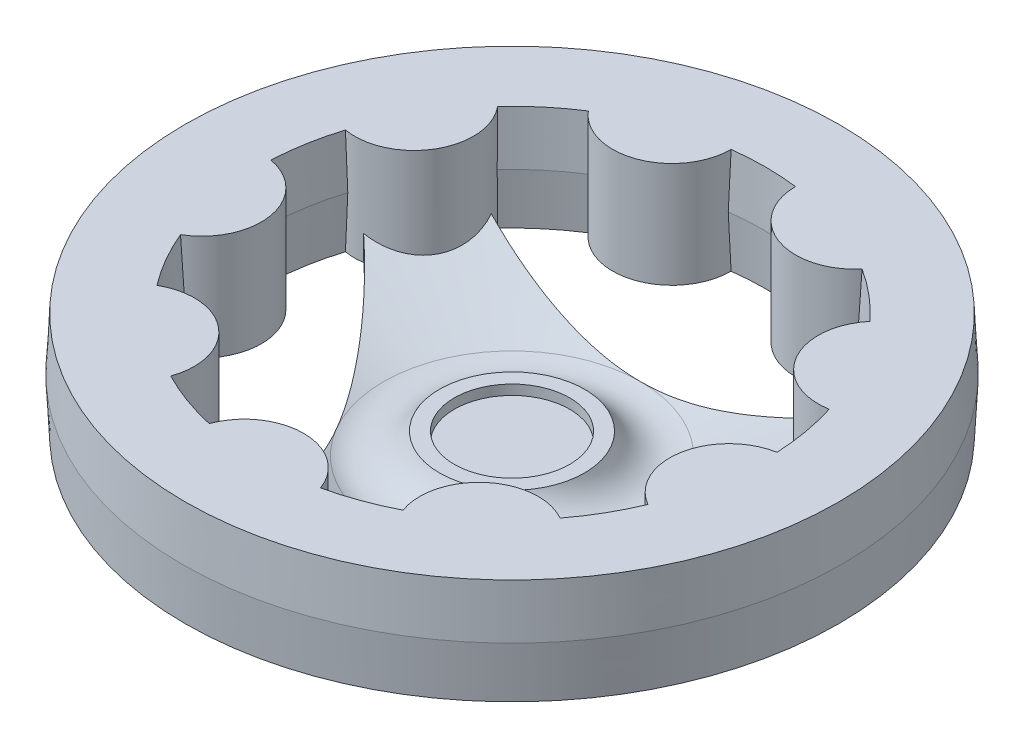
ISO-10303-21;
HEADER;
FILE_DESCRIPTION(('STEP AP214'),'2;1');
FILE_NAME('part.step','',(''),(''),'','','');
FILE_SCHEMA(('AUTOMOTIVE_DESIGN { 1 0 10303 214 1 1 1 1 }'));
ENDSEC;
DATA;
#1=APPLICATION_CONTEXT('core data for automotive mechanical design processes');
#2=APPLICATION_PROTOCOL_DEFINITION('international standard','automotive_design',2000,#1);
#3=PRODUCT_CONTEXT('',#1,'mechanical');
#4=PRODUCT('Part','Part','',(#3));
#5=PRODUCT_RELATED_PRODUCT_CATEGORY('part','',(#4));
#6=PRODUCT_DEFINITION_FORMATION('','',#4);
#7=PRODUCT_DEFINITION_CONTEXT('part definition',#1,'design');
#8=PRODUCT_DEFINITION('design','',#6,#7);
#9=PRODUCT_DEFINITION_SHAPE('','',#8);
#10=(LENGTH_UNIT() NAMED_UNIT(*) SI_UNIT(.MILLI.,.METRE.));
#11=(NAMED_UNIT(*) PLANE_ANGLE_UNIT() SI_UNIT($,.RADIAN.));
#12=(NAMED_UNIT(*) SI_UNIT($,.STERADIAN.) SOLID_ANGLE_UNIT());
#13=UNCERTAINTY_MEASURE_WITH_UNIT(LENGTH_MEASURE(1.E-05),#10,'distance_accuracy_value','');
#14=(GEOMETRIC_REPRESENTATION_CONTEXT(3) GLOBAL_UNCERTAINTY_ASSIGNED_CONTEXT((#13)) GLOBAL_UNIT_ASSIGNED_CONTEXT((#10,
#11,#12)) REPRESENTATION_CONTEXT('',''));
#15=CARTESIAN_POINT('',(0.,0.,0.));
#16=DIRECTION('',(0.,0.,1.));
#17=DIRECTION('',(1.,0.,0.));
#18=AXIS2_PLACEMENT_3D('',#15,#16,#17);
#19=CARTESIAN_POINT('',(95.2,1.99999999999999,0.));
#20=DIRECTION('',(0.,1.,0.));
#21=DIRECTION('',(0.,0.,1.));
#22=AXIS2_PLACEMENT_3D('',#19,#20,#21);
#23=PLANE('',#22);
#24=CARTESIAN_POINT('',(0.,1.99999999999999,0.));
#25=DIRECTION('',(0.,1.,0.));
#26=DIRECTION('',(0.,0.,1.));
#27=AXIS2_PLACEMENT_3D('',#24,#25,#26);
#28=CIRCLE('',#27,76.8385244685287);
#29=CARTESIAN_POINT('',(-35.2378997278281,1.99999999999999,68.2821299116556));
#30=VERTEX_POINT('',#29);
#31=CARTESIAN_POINT('',(-16.8971097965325,1.99999999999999,74.9576315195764));
#32=VERTEX_POINT('',#31);
#33=EDGE_CURVE('E386',#30,#32,#28,.T.);
#34=ORIENTED_EDGE('',*,*,#33,.T.);
#35=CARTESIAN_POINT('',(0.,1.99999999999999,81.1614755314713));
#36=DIRECTION('',(0.,1.,0.));
#37=DIRECTION('',(0.,0.,1.));
#38=AXIS2_PLACEMENT_3D('',#35,#36,#37);
#39=CIRCLE('',#38,18.);
#40=CARTESIAN_POINT('',(-11.7525619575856,1.99999999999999,67.5277934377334));
#41=VERTEX_POINT('',#40);
#42=EDGE_CURVE('E880',#32,#41,#39,.F.);
#43=ORIENTED_EDGE('',*,*,#42,.T.);
#44=CARTESIAN_POINT('',(0.,1.99999999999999,0.));
#45=DIRECTION('',(0.,1.,0.));
#46=DIRECTION('',(0.,0.,1.));
#47=AXIS2_PLACEMENT_3D('',#44,#45,#46);
#48=CIRCLE('',#47,68.5428741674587);
#49=CARTESIAN_POINT('',(11.7525619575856,1.99999999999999,67.5277934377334));
#50=VERTEX_POINT('',#49);
#51=EDGE_CURVE('E883',#41,#50,#48,.T.);
#52=ORIENTED_EDGE('',*,*,#51,.T.);
#53=CARTESIAN_POINT('',(16.8971097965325,1.99999999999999,74.9576315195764));
#54=VERTEX_POINT('',#53);
#55=EDGE_CURVE('E884',#50,#54,#39,.F.);
#56=ORIENTED_EDGE('',*,*,#55,.T.);
#57=CARTESIAN_POINT('',(0.,1.99999999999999,0.));
#58=DIRECTION('',(0.,1.,0.));
#59=DIRECTION('',(0.,0.,1.));
#60=AXIS2_PLACEMENT_3D('',#57,#58,#59);
#61=CIRCLE('',#60,76.8385244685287);
#62=CARTESIAN_POINT('',(35.2378997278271,1.99999999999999,68.2821299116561));
#63=VERTEX_POINT('',#62);
#64=EDGE_CURVE('E387',#54,#63,#61,.T.);
#65=ORIENTED_EDGE('',*,*,#64,.T.);
#66=CARTESIAN_POINT('',(52.1695908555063,1.99999999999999,62.1732973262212));
#67=DIRECTION('',(0.,1.,0.));
#68=DIRECTION('',(0.,0.,1.));
#69=AXIS2_PLACEMENT_3D('',#66,#67,#68);
#70=CIRCLE('',#69,18.);
#71=CARTESIAN_POINT('',(61.1257738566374,1.99999999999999,46.5596242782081));
#72=VERTEX_POINT('',#71);
#73=EDGE_CURVE('E858',#63,#72,#70,.F.);
#74=ORIENTED_EDGE('',*,*,#73,.T.);
#75=CARTESIAN_POINT('',(70.884704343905,1.99999999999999,29.6566608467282));
#76=VERTEX_POINT('',#75);
#77=EDGE_CURVE('E392',#72,#76,#61,.T.);
#78=ORIENTED_EDGE('',*,*,#77,.T.);
#79=CARTESIAN_POINT('',(79.9284503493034,1.99999999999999,14.0935423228));
#80=DIRECTION('',(0.,1.,0.));
#81=DIRECTION('',(0.,0.,1.));
#82=AXIS2_PLACEMENT_3D('',#79,#80,#81);
#83=CIRCLE('',#82,18.);
#84=CARTESIAN_POINT('',(76.7530089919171,1.99999999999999,-3.62414861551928));
#85=VERTEX_POINT('',#84);
#86=EDGE_CURVE('E605',#76,#85,#83,.F.);
#87=ORIENTED_EDGE('',*,*,#86,.T.);
#88=CARTESIAN_POINT('',(73.3637680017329,1.99999999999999,-22.8454894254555));
#89=VERTEX_POINT('',#88);
#90=EDGE_CURVE('E393',#85,#89,#61,.T.);
#91=ORIENTED_EDGE('',*,*,#90,.T.);
#92=CARTESIAN_POINT('',(70.2878996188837,1.99999999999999,-40.580737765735));
#93=DIRECTION('',(0.,1.,0.));
#94=DIRECTION('',(0.,0.,1.));
#95=AXIS2_PLACEMENT_3D('',#92,#93,#94);
#96=CIRCLE('',#95,18.);
#97=CARTESIAN_POINT('',(64.3570655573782,1.99999999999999,-23.5858795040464));
#98=VERTEX_POINT('',#97);
#99=EDGE_CURVE('E651',#89,#98,#96,.F.);
#100=ORIENTED_EDGE('',*,*,#99,.T.);
#101=CARTESIAN_POINT('',(0.,1.99999999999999,0.));
#102=DIRECTION('',(0.,1.,0.));
#103=DIRECTION('',(0.,0.,1.));
#104=AXIS2_PLACEMENT_3D('',#101,#102,#103);
#105=CIRCLE('',#104,68.5428741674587);
#106=CARTESIAN_POINT('',(52.6045035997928,1.99999999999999,-43.9419139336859));
#107=VERTEX_POINT('',#106);
#108=EDGE_CURVE('E656',#98,#107,#105,.T.);
#109=ORIENTED_EDGE('',*,*,#108,.T.);
#110=CARTESIAN_POINT('',(56.4666582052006,1.99999999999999,-52.1121420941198));
#111=VERTEX_POINT('',#110);
#112=EDGE_CURVE('E644',#107,#111,#96,.F.);
#113=ORIENTED_EDGE('',*,*,#112,.T.);
#114=CARTESIAN_POINT('',(0.,1.99999999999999,0.));
#115=DIRECTION('',(0.,1.,0.));
#116=DIRECTION('',(0.,0.,1.));
#117=AXIS2_PLACEMENT_3D('',#114,#115,#116);
#118=CIRCLE('',#117,76.8385244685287);
#119=CARTESIAN_POINT('',(41.5151092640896,1.99999999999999,-64.6579812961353));
#120=VERTEX_POINT('',#119);
#121=EDGE_CURVE('E349',#111,#120,#118,.T.);
#122=ORIENTED_EDGE('',*,*,#121,.T.);
#123=CARTESIAN_POINT('',(27.7588594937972,1.99999999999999,-76.2668396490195));
#124=DIRECTION('',(0.,1.,0.));
#125=DIRECTION('',(0.,0.,1.));
#126=AXIS2_PLACEMENT_3D('',#123,#124,#125);
#127=CIRCLE('',#126,18.);
#128=CARTESIAN_POINT('',(9.75893048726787,1.99999999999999,-76.2162851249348));
#129=VERTEX_POINT('',#128);
#130=EDGE_CURVE('E1017',#120,#129,#127,.F.);
#131=ORIENTED_EDGE('',*,*,#130,.T.);
#132=CARTESIAN_POINT('',(-9.75893048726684,1.99999999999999,-76.2162851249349));
#133=VERTEX_POINT('',#132);
#134=EDGE_CURVE('E347',#129,#133,#118,.T.);
#135=ORIENTED_EDGE('',*,*,#134,.T.);
#136=CARTESIAN_POINT('',(-27.7588594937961,1.99999999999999,-76.2668396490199));
#137=DIRECTION('',(0.,1.,0.));
#138=DIRECTION('',(0.,0.,1.));
#139=AXIS2_PLACEMENT_3D('',#136,#137,#138);
#140=CIRCLE('',#139,18.);
#141=CARTESIAN_POINT('',(-41.5151092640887,1.99999999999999,-64.6579812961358));
#142=VERTEX_POINT('',#141);
#143=EDGE_CURVE('E874',#133,#142,#140,.F.);
#144=ORIENTED_EDGE('',*,*,#143,.T.);
#145=CARTESIAN_POINT('',(-56.4666582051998,1.99999999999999,-52.1121420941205));
#146=VERTEX_POINT('',#145);
#147=EDGE_CURVE('E342',#142,#146,#118,.T.);
#148=ORIENTED_EDGE('',*,*,#147,.T.);
#149=CARTESIAN_POINT('',(-70.2878996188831,1.99999999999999,-40.580737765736));
#150=DIRECTION('',(0.,1.,0.));
#151=DIRECTION('',(0.,0.,1.));
#152=AXIS2_PLACEMENT_3D('',#149,#150,#151);
#153=CIRCLE('',#152,18.);
#154=CARTESIAN_POINT('',(-52.6045035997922,1.99999999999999,-43.9419139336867));
#155=VERTEX_POINT('',#154);
#156=EDGE_CURVE('E944',#146,#155,#153,.F.);
#157=ORIENTED_EDGE('',*,*,#156,.T.);
#158=CARTESIAN_POINT('',(0.,1.99999999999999,0.));
#159=DIRECTION('',(0.,1.,0.));
#160=DIRECTION('',(0.,0.,1.));
#161=AXIS2_PLACEMENT_3D('',#158,#159,#160);
#162=CIRCLE('',#161,68.5428741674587);
#163=CARTESIAN_POINT('',(-64.3570655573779,1.99999999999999,-23.5858795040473));
#164=VERTEX_POINT('',#163);
#165=EDGE_CURVE('E1085',#155,#164,#162,.T.);
#166=ORIENTED_EDGE('',*,*,#165,.T.);
#167=CARTESIAN_POINT('',(-73.3637680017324,1.99999999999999,-22.8454894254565));
#168=VERTEX_POINT('',#167);
#169=EDGE_CURVE('E1089',#164,#168,#153,.F.);
#170=ORIENTED_EDGE('',*,*,#169,.T.);
#171=CARTESIAN_POINT('',(-76.7530089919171,1.99999999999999,-3.62414861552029));
#172=VERTEX_POINT('',#171);
#173=EDGE_CURVE('E381',#168,#172,#28,.T.);
#174=ORIENTED_EDGE('',*,*,#173,.T.);
#175=CARTESIAN_POINT('',(-79.9284503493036,1.99999999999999,14.0935423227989));
#176=DIRECTION('',(0.,1.,0.));
#177=DIRECTION('',(0.,0.,1.));
#178=AXIS2_PLACEMENT_3D('',#175,#176,#177);
#179=CIRCLE('',#178,18.);
#180=CARTESIAN_POINT('',(-70.8847043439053,1.99999999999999,29.6566608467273));
#181=VERTEX_POINT('',#180);
#182=EDGE_CURVE('E952',#172,#181,#179,.F.);
#183=ORIENTED_EDGE('',*,*,#182,.T.);
#184=CARTESIAN_POINT('',(-61.1257738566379,1.99999999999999,46.5596242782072));
#185=VERTEX_POINT('',#184);
#186=EDGE_CURVE('E385',#181,#185,#28,.T.);
#187=ORIENTED_EDGE('',*,*,#186,.T.);
#188=CARTESIAN_POINT('',(-52.1695908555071,1.99999999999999,62.1732973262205));
#189=DIRECTION('',(0.,1.,0.));
#190=DIRECTION('',(0.,0.,1.));
#191=AXIS2_PLACEMENT_3D('',#188,#189,#190);
#192=CIRCLE('',#191,18.);
#193=EDGE_CURVE('E435',#185,#30,#192,.F.);
#194=ORIENTED_EDGE('',*,*,#193,.T.);
#195=EDGE_LOOP('',(#34,#43,#52,#56,#65,#74,#78,#87,#91,#100,#109,#113,#122,#131,#135,#144,#148,
#157,#166,#170,#174,#183,#187,#194));
#196=FACE_BOUND('',#195,.T.);
#197=CARTESIAN_POINT('',(0.,2.,0.));
#198=DIRECTION('',(0.,1.,0.));
#199=DIRECTION('',(0.,0.,1.));
#200=AXIS2_PLACEMENT_3D('',#197,#198,#199);
#201=CIRCLE('',#200,95.2);
#202=CARTESIAN_POINT('',(12.1762813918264,1.99999999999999,94.4181029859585));
#203=VERTEX_POINT('',#202);
#204=CARTESIAN_POINT('',(-12.1762813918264,1.99999999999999,94.4181029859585));
#205=VERTEX_POINT('',#204);
#206=EDGE_CURVE('E827',#203,#205,#201,.T.);
#207=ORIENTED_EDGE('',*,*,#206,.T.);
#208=CARTESIAN_POINT('',(0.,1.99999999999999,81.1614755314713));
#209=DIRECTION('',(0.,1.,0.));
#210=DIRECTION('',(0.,0.,1.));
#211=AXIS2_PLACEMENT_3D('',#208,#209,#210);
#212=CIRCLE('',#211,18.);
#213=CARTESIAN_POINT('',(-17.8450554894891,1.99999999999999,78.8047840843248));
#214=VERTEX_POINT('',#213);
#215=EDGE_CURVE('E325',#214,#205,#212,.T.);
#216=ORIENTED_EDGE('',*,*,#215,.F.);
#217=CARTESIAN_POINT('',(0.,2.,0.));
#218=DIRECTION('',(0.,1.,0.));
#219=DIRECTION('',(0.,0.,1.));
#220=AXIS2_PLACEMENT_3D('',#217,#218,#219);
#221=CIRCLE('',#220,80.8);
#222=CARTESIAN_POINT('',(17.8450554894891,1.99999999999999,78.8047840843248));
#223=VERTEX_POINT('',#222);
#224=EDGE_CURVE('E332',#223,#214,#221,.T.);
#225=ORIENTED_EDGE('',*,*,#224,.F.);
#226=EDGE_CURVE('E66',#203,#223,#212,.T.);
#227=ORIENTED_EDGE('',*,*,#226,.F.);
#228=EDGE_LOOP('',(#207,#216,#225,#227));
#229=FACE_BOUND('',#228,.T.);
#230=CARTESIAN_POINT('',(0.,1.99999999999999,0.));
#231=DIRECTION('',(0.,1.,0.));
#232=DIRECTION('',(0.,0.,1.));
#233=AXIS2_PLACEMENT_3D('',#230,#231,#232);
#234=CIRCLE('',#233,99.1614755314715);
#235=CARTESIAN_POINT('',(0.,1.99999999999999,99.1614755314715));
#236=VERTEX_POINT('',#235);
#237=EDGE_CURVE('E823',#236,#236,#234,.T.);
#238=ORIENTED_EDGE('',*,*,#237,.F.);
#239=EDGE_LOOP('',(#238));
#240=FACE_BOUND('',#239,.T.);
#241=CARTESIAN_POINT('',(0.,1.99999999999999,81.1614755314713));
#242=DIRECTION('',(0.,1.,0.));
#243=DIRECTION('',(0.,0.,1.));
#244=AXIS2_PLACEMENT_3D('',#241,#242,#243);
#245=CIRCLE('',#244,6.00000000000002);
#246=CARTESIAN_POINT('',(0.,1.99999999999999,87.1614755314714));
#247=VERTEX_POINT('',#246);
#248=EDGE_CURVE('E843',#247,#247,#245,.T.);
#249=ORIENTED_EDGE('',*,*,#248,.T.);
#250=EDGE_LOOP('',(#249));
#251=FACE_BOUND('',#250,.T.);
#252=ADVANCED_FACE('F49',(#196,#229,#240,#251),#23,.F.);
#253=CARTESIAN_POINT('',(0.,0.,0.));
#254=DIRECTION('',(0.,1.,0.));
#255=DIRECTION('',(0.,0.,1.));
#256=AXIS2_PLACEMENT_3D('',#253,#254,#255);
#257=CYLINDRICAL_SURFACE('',#256,80.8);
#258=DIRECTION('',(0.,1.,0.));
#259=VECTOR('',#258,1.);
#260=CARTESIAN_POINT('',(17.8450554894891,15.6,78.8047840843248));
#261=LINE('',#260,#259);
#262=CARTESIAN_POINT('',(17.8450554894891,29.2,78.8047840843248));
#263=VERTEX_POINT('',#262);
#264=EDGE_CURVE('E318',#223,#263,#261,.T.);
#265=ORIENTED_EDGE('',*,*,#264,.F.);
#266=ORIENTED_EDGE('',*,*,#224,.T.);
#267=DIRECTION('',(0.,1.,0.));
#268=VECTOR('',#267,1.);
#269=CARTESIAN_POINT('',(-17.8450554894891,15.6,78.8047840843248));
#270=LINE('',#269,#268);
#271=CARTESIAN_POINT('',(-17.8450554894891,29.2,78.8047840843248));
#272=VERTEX_POINT('',#271);
#273=EDGE_CURVE('E337',#272,#214,#270,.F.);
#274=ORIENTED_EDGE('',*,*,#273,.F.);
#275=CARTESIAN_POINT('',(0.,29.2,0.));
#276=DIRECTION('',(0.,1.,0.));
#277=DIRECTION('',(0.,0.,1.));
#278=AXIS2_PLACEMENT_3D('',#275,#276,#277);
#279=CIRCLE('',#278,80.8);
#280=EDGE_CURVE('E334',#263,#272,#279,.T.);
#281=ORIENTED_EDGE('',*,*,#280,.F.);
#282=EDGE_LOOP('',(#265,#266,#274,#281));
#283=FACE_BOUND('',#282,.T.);
#284=ADVANCED_FACE('F330',(#283),#257,.T.);
#285=CARTESIAN_POINT('',(80.8,29.2,0.));
#286=DIRECTION('',(0.,1.,0.));
#287=DIRECTION('',(0.,0.,1.));
#288=AXIS2_PLACEMENT_3D('',#285,#286,#287);
#289=PLANE('',#288);
#290=CARTESIAN_POINT('',(0.,29.2,81.1614755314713));
#291=DIRECTION('',(0.,-1.,0.));
#292=DIRECTION('',(0.,0.,-1.));
#293=AXIS2_PLACEMENT_3D('',#290,#291,#292);
#294=CIRCLE('',#293,18.);
#295=CARTESIAN_POINT('',(-12.1762813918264,29.2,94.4181029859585));
#296=VERTEX_POINT('',#295);
#297=EDGE_CURVE('E841',#296,#272,#294,.T.);
#298=ORIENTED_EDGE('',*,*,#297,.F.);
#299=CARTESIAN_POINT('',(0.,29.2,0.));
#300=DIRECTION('',(0.,1.,0.));
#301=DIRECTION('',(0.,0.,1.));
#302=AXIS2_PLACEMENT_3D('',#299,#300,#301);
#303=CIRCLE('',#302,95.2);
#304=CARTESIAN_POINT('',(12.1762813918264,29.2,94.4181029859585));
#305=VERTEX_POINT('',#304);
#306=EDGE_CURVE('E351',#305,#296,#303,.T.);
#307=ORIENTED_EDGE('',*,*,#306,.F.);
#308=EDGE_CURVE('E840',#263,#305,#294,.T.);
#309=ORIENTED_EDGE('',*,*,#308,.F.);
#310=ORIENTED_EDGE('',*,*,#280,.T.);
#311=EDGE_LOOP('',(#298,#307,#309,#310));
#312=FACE_BOUND('',#311,.T.);
#313=ADVANCED_FACE('F839',(#312),#289,.F.);
#314=CARTESIAN_POINT('',(0.,0.,0.));
#315=DIRECTION('',(0.,1.,0.));
#316=DIRECTION('',(0.,0.,1.));
#317=AXIS2_PLACEMENT_3D('',#314,#315,#316);
#318=CYLINDRICAL_SURFACE('',#317,95.2);
#319=DIRECTION('',(0.,1.,0.));
#320=VECTOR('',#319,1.);
#321=CARTESIAN_POINT('',(12.1762813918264,15.6,94.4181029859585));
#322=LINE('',#321,#320);
#323=EDGE_CURVE('E321',#305,#203,#322,.F.);
#324=ORIENTED_EDGE('',*,*,#323,.F.);
#325=ORIENTED_EDGE('',*,*,#306,.T.);
#326=DIRECTION('',(0.,1.,0.));
#327=VECTOR('',#326,1.);
#328=CARTESIAN_POINT('',(-12.1762813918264,15.6,94.4181029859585));
#329=LINE('',#328,#327);
#330=EDGE_CURVE('E324',#205,#296,#329,.T.);
#331=ORIENTED_EDGE('',*,*,#330,.F.);
#332=ORIENTED_EDGE('',*,*,#206,.F.);
#333=EDGE_LOOP('',(#324,#325,#331,#332));
#334=FACE_BOUND('',#333,.T.);
#335=ADVANCED_FACE('F836',(#334),#318,.F.);
#336=CARTESIAN_POINT('',(0.,34.,0.));
#337=DIRECTION('',(0.,1.,0.));
#338=DIRECTION('',(0.,0.,1.));
#339=AXIS2_PLACEMENT_3D('',#336,#337,#338);
#340=CONICAL_SURFACE('',#339,76.8385244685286,0.0523598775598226);
#341=CARTESIAN_POINT('',(0.,34.,0.));
#342=DIRECTION('',(0.,1.,0.));
#343=DIRECTION('',(0.,0.,1.));
#344=AXIS2_PLACEMENT_3D('',#341,#342,#343);
#345=CIRCLE('',#344,76.8385244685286);
#346=CARTESIAN_POINT('',(16.8971097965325,34.,74.9576315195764));
#347=VERTEX_POINT('',#346);
#348=CARTESIAN_POINT('',(35.2378997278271,34.,68.282129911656));
#349=VERTEX_POINT('',#348);
#350=EDGE_CURVE('E811',#347,#349,#345,.T.);
#351=ORIENTED_EDGE('',*,*,#350,.T.);
#352=CARTESIAN_POINT('',(35.2379033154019,34.0002,68.282139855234));
#353=CARTESIAN_POINT('',(35.1900573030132,31.333438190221,68.1495624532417));
#354=CARTESIAN_POINT('',(35.1437075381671,28.6666906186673,68.0162017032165));
#355=CARTESIAN_POINT('',(35.0540005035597,23.3332239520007,67.7479135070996));
#356=CARTESIAN_POINT('',(35.0106432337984,20.6665048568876,67.6129860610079));
#357=CARTESIAN_POINT('',(34.9687822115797,17.9998,67.4772752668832));
#358=B_SPLINE_CURVE_WITH_KNOTS('',3,(#352,#353,#354,#355,#356,#357),.UNSPECIFIED.,.F.,.F.,(4,2,
4),(0.,8.01144706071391,16.0228941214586),.UNSPECIFIED.);
#359=CARTESIAN_POINT('',(34.9687853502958,18.,67.477285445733));
#360=VERTEX_POINT('',#359);
#361=EDGE_CURVE('E595',#349,#360,#358,.T.);
#362=ORIENTED_EDGE('',*,*,#361,.T.);
#363=CARTESIAN_POINT('',(0.,18.,0.));
#364=DIRECTION('',(0.,1.,0.));
#365=DIRECTION('',(0.,0.,1.));
#366=AXIS2_PLACEMENT_3D('',#363,#364,#365);
#367=CIRCLE('',#366,76.);
#368=CARTESIAN_POINT('',(16.5859193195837,18.,74.1681015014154));
#369=VERTEX_POINT('',#368);
#370=EDGE_CURVE('E805',#369,#360,#367,.T.);
#371=ORIENTED_EDGE('',*,*,#370,.F.);
#372=CARTESIAN_POINT('',(16.585915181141,17.9998,74.1680916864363));
#373=CARTESIAN_POINT('',(16.6410809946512,20.6665048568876,74.2989599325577));
#374=CARTESIAN_POINT('',(16.6945970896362,23.3332239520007,74.4301898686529));
#375=CARTESIAN_POINT('',(16.7983298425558,28.6666906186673,74.69337312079));
#376=CARTESIAN_POINT('',(16.8485465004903,31.333438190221,74.825326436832));
#377=CARTESIAN_POINT('',(16.8971134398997,34.0002,74.9576414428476));
#378=B_SPLINE_CURVE_WITH_KNOTS('',3,(#372,#373,#374,#375,#376,#377),.UNSPECIFIED.,.F.,.F.,(4,2,
4),(0.,8.01144706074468,16.0228941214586),.UNSPECIFIED.);
#379=EDGE_CURVE('E457',#369,#347,#378,.T.);
#380=ORIENTED_EDGE('',*,*,#379,.T.);
#381=EDGE_LOOP('',(#351,#362,#371,#380));
#382=FACE_BOUND('',#381,.T.);
#383=ADVANCED_FACE('F448',(#382),#340,.F.);
#384=CARTESIAN_POINT('',(0.,18.,0.));
#385=DIRECTION('',(0.,-1.,0.));
#386=DIRECTION('',(0.,0.,-1.));
#387=AXIS2_PLACEMENT_3D('',#384,#385,#386);
#388=CONICAL_SURFACE('',#387,76.,0.05235987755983);
#389=ORIENTED_EDGE('',*,*,#370,.T.);
#390=CARTESIAN_POINT('',(34.9687822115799,18.0002,67.4772752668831));
#391=CARTESIAN_POINT('',(35.0106432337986,15.3334951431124,67.6129860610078));
#392=CARTESIAN_POINT('',(35.0540005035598,12.6667760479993,67.7479135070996));
#393=CARTESIAN_POINT('',(35.1437075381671,7.33330938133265,68.0162017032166));
#394=CARTESIAN_POINT('',(35.1900573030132,4.66656180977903,68.1495624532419));
#395=CARTESIAN_POINT('',(35.2379033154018,1.99979999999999,68.2821398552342));
#396=B_SPLINE_CURVE_WITH_KNOTS('',3,(#390,#391,#392,#393,#394,#395),.UNSPECIFIED.,.F.,.F.,(4,2,
4),(0.,8.01144706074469,16.0228941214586),.UNSPECIFIED.);
#397=EDGE_CURVE('E576',#360,#63,#396,.T.);
#398=ORIENTED_EDGE('',*,*,#397,.T.);
#399=ORIENTED_EDGE('',*,*,#64,.F.);
#400=CARTESIAN_POINT('',(16.8971134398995,1.99979999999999,74.9576414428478));
#401=CARTESIAN_POINT('',(16.8485465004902,4.66656180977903,74.8253264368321));
#402=CARTESIAN_POINT('',(16.7983298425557,7.33330938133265,74.6933731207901));
#403=CARTESIAN_POINT('',(16.6945970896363,12.6667760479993,74.4301898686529));
#404=CARTESIAN_POINT('',(16.6410809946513,15.3334951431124,74.2989599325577));
#405=CARTESIAN_POINT('',(16.5859151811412,18.0002,74.1680916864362));
#406=B_SPLINE_CURVE_WITH_KNOTS('',3,(#400,#401,#402,#403,#404,#405),.UNSPECIFIED.,.F.,.F.,(4,2,
4),(0.,8.01144706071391,16.0228941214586),.UNSPECIFIED.);
#407=EDGE_CURVE('E870',#54,#369,#406,.T.);
#408=ORIENTED_EDGE('',*,*,#407,.T.);
#409=EDGE_LOOP('',(#389,#398,#399,#408));
#410=FACE_BOUND('',#409,.T.);
#411=ADVANCED_FACE('F1150',(#410),#388,.F.);
#412=CARTESIAN_POINT('',(60.3798880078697,18.,46.1548385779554));
#413=VERTEX_POINT('',#412);
#414=CARTESIAN_POINT('',(70.1612067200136,18.,29.2130976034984));
#415=VERTEX_POINT('',#414);
#416=EDGE_CURVE('E810',#413,#415,#367,.T.);
#417=ORIENTED_EDGE('',*,*,#416,.F.);
#418=CARTESIAN_POINT('',(60.3798785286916,17.9998,46.1548337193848));
#419=CARTESIAN_POINT('',(60.5062584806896,20.6665048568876,46.2196247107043));
#420=CARTESIAN_POINT('',(60.6316071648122,23.3332239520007,46.2857531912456));
#421=CARTESIAN_POINT('',(60.8802419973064,28.6666906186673,46.4206851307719));
#422=CARTESIAN_POINT('',(61.003528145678,31.333438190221,46.4894885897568));
#423=CARTESIAN_POINT('',(61.1257830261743,34.0002,46.5596295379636));
#424=B_SPLINE_CURVE_WITH_KNOTS('',3,(#418,#419,#420,#421,#422,#423),.UNSPECIFIED.,.F.,.F.,(4,2,
4),(0.,8.01144706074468,16.0228941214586),.UNSPECIFIED.);
#425=CARTESIAN_POINT('',(61.1257738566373,34.,46.559624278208));
#426=VERTEX_POINT('',#425);
#427=EDGE_CURVE('E567',#413,#426,#424,.T.);
#428=ORIENTED_EDGE('',*,*,#427,.T.);
#429=CARTESIAN_POINT('',(70.8847043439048,34.,29.6566608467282));
#430=VERTEX_POINT('',#429);
#431=EDGE_CURVE('E815',#426,#430,#345,.T.);
#432=ORIENTED_EDGE('',*,*,#431,.T.);
#433=CARTESIAN_POINT('',(70.8847134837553,34.0002,29.6566661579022));
#434=CARTESIAN_POINT('',(70.7628422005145,31.333438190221,29.5858607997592));
#435=CARTESIAN_POINT('',(70.6416135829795,28.6666906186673,29.5134935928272));
#436=CARTESIAN_POINT('',(70.4004416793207,23.3332239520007,29.3656354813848));
#437=CARTESIAN_POINT('',(70.280498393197,20.6665048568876,29.2901445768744));
#438=CARTESIAN_POINT('',(70.161197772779,17.9998,29.2130918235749));
#439=B_SPLINE_CURVE_WITH_KNOTS('',3,(#433,#434,#435,#436,#437,#438),.UNSPECIFIED.,.F.,.F.,(4,2,
4),(0.,8.01144706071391,16.0228941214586),.UNSPECIFIED.);
#440=EDGE_CURVE('E561',#430,#415,#439,.T.);
#441=ORIENTED_EDGE('',*,*,#440,.T.);
#442=EDGE_LOOP('',(#417,#428,#432,#441));
#443=FACE_BOUND('',#442,.T.);
#444=ADVANCED_FACE('F1159',(#443),#340,.F.);
#445=ORIENTED_EDGE('',*,*,#77,.F.);
#446=CARTESIAN_POINT('',(61.1257830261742,1.99979999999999,46.5596295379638));
#447=CARTESIAN_POINT('',(61.003528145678,4.66656180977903,46.4894885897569));
#448=CARTESIAN_POINT('',(60.8802419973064,7.33330938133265,46.420685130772));
#449=CARTESIAN_POINT('',(60.6316071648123,12.6667760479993,46.2857531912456));
#450=CARTESIAN_POINT('',(60.5062584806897,15.3334951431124,46.2196247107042));
#451=CARTESIAN_POINT('',(60.3798785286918,18.0002,46.1548337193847));
#452=B_SPLINE_CURVE_WITH_KNOTS('',3,(#446,#447,#448,#449,#450,#451),.UNSPECIFIED.,.F.,.F.,(4,2,
4),(0.,8.01144706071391,16.0228941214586),.UNSPECIFIED.);
#453=EDGE_CURVE('E74',#72,#413,#452,.T.);
#454=ORIENTED_EDGE('',*,*,#453,.T.);
#455=ORIENTED_EDGE('',*,*,#416,.T.);
#456=CARTESIAN_POINT('',(70.161197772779,18.0002,29.2130918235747));
#457=CARTESIAN_POINT('',(70.280498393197,15.3334951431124,29.2901445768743));
#458=CARTESIAN_POINT('',(70.4004416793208,12.6667760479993,29.3656354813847));
#459=CARTESIAN_POINT('',(70.6416135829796,7.33330938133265,29.5134935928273));
#460=CARTESIAN_POINT('',(70.7628422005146,4.66656180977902,29.5858607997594));
#461=CARTESIAN_POINT('',(70.8847134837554,1.99979999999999,29.6566661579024));
#462=B_SPLINE_CURVE_WITH_KNOTS('',3,(#456,#457,#458,#459,#460,#461),.UNSPECIFIED.,.F.,.F.,(4,2,
4),(0.,8.01144706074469,16.0228941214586),.UNSPECIFIED.);
#463=EDGE_CURVE('E620',#415,#76,#462,.T.);
#464=ORIENTED_EDGE('',*,*,#463,.T.);
#465=EDGE_LOOP('',(#445,#454,#455,#464));
#466=FACE_BOUND('',#465,.T.);
#467=ADVANCED_FACE('F1161',(#466),#388,.F.);
#468=CARTESIAN_POINT('',(75.9214360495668,18.,-3.45478627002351));
#469=VERTEX_POINT('',#468);
#470=CARTESIAN_POINT('',(72.5244197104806,18.,-22.7202232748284));
#471=VERTEX_POINT('',#470);
#472=EDGE_CURVE('E912',#469,#471,#367,.T.);
#473=ORIENTED_EDGE('',*,*,#472,.F.);
#474=CARTESIAN_POINT('',(75.9214256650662,17.9998,-3.45478389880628));
#475=CARTESIAN_POINT('',(76.0598851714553,20.6665048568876,-3.48638658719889));
#476=CARTESIAN_POINT('',(76.1984144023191,23.3332239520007,-3.51630181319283));
#477=CARTESIAN_POINT('',(76.4756123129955,28.6666906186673,-3.57275734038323));
#478=CARTESIAN_POINT('',(76.6142809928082,31.333438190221,-3.59929764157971));
#479=CARTESIAN_POINT('',(76.7530193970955,34.0002,-3.62415048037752));
#480=B_SPLINE_CURVE_WITH_KNOTS('',3,(#474,#475,#476,#477,#478,#479),.UNSPECIFIED.,.F.,.F.,(4,2,
4),(0.,8.01144706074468,16.0228941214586),.UNSPECIFIED.);
#481=CARTESIAN_POINT('',(76.753008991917,34.,-3.62414861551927));
#482=VERTEX_POINT('',#481);
#483=EDGE_CURVE('E553',#469,#482,#480,.T.);
#484=ORIENTED_EDGE('',*,*,#483,.T.);
#485=CARTESIAN_POINT('',(73.3637680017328,34.,-22.8454894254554));
#486=VERTEX_POINT('',#485);
#487=EDGE_CURVE('E1158',#482,#486,#345,.T.);
#488=ORIENTED_EDGE('',*,*,#487,.T.);
#489=CARTESIAN_POINT('',(73.3637784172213,34.0002,-22.8454912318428));
#490=CARTESIAN_POINT('',(73.2249067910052,31.333438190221,-22.8213939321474));
#491=CARTESIAN_POINT('',(73.085523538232,28.6666906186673,-22.7989061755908));
#492=CARTESIAN_POINT('',(72.8057337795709,23.3332239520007,-22.757149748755));
#493=CARTESIAN_POINT('',(72.665327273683,20.6665048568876,-22.7378810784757));
#494=CARTESIAN_POINT('',(72.524409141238,17.9998,-22.7202219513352));
#495=B_SPLINE_CURVE_WITH_KNOTS('',3,(#489,#490,#491,#492,#493,#494),.UNSPECIFIED.,.F.,.F.,(4,2,
4),(0.,8.01144706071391,16.0228941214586),.UNSPECIFIED.);
#496=EDGE_CURVE('E546',#486,#471,#495,.T.);
#497=ORIENTED_EDGE('',*,*,#496,.T.);
#498=EDGE_LOOP('',(#473,#484,#488,#497));
#499=FACE_BOUND('',#498,.T.);
#500=ADVANCED_FACE('F1162',(#499),#340,.F.);
#501=ORIENTED_EDGE('',*,*,#90,.F.);
#502=CARTESIAN_POINT('',(76.7530193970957,1.9998,-3.62415048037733));
#503=CARTESIAN_POINT('',(76.6142809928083,4.66656180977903,-3.59929764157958));
#504=CARTESIAN_POINT('',(76.4756123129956,7.33330938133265,-3.57275734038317));
#505=CARTESIAN_POINT('',(76.1984144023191,12.6667760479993,-3.5163018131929));
#506=CARTESIAN_POINT('',(76.0598851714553,15.3334951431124,-3.48638658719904));
#507=CARTESIAN_POINT('',(75.9214256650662,18.0002,-3.4547838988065));
#508=B_SPLINE_CURVE_WITH_KNOTS('',3,(#502,#503,#504,#505,#506,#507),.UNSPECIFIED.,.F.,.F.,(4,2,
4),(0.,8.01144706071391,16.0228941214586),.UNSPECIFIED.);
#509=EDGE_CURVE('E608',#85,#469,#508,.T.);
#510=ORIENTED_EDGE('',*,*,#509,.T.);
#511=ORIENTED_EDGE('',*,*,#472,.T.);
#512=CARTESIAN_POINT('',(72.524409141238,18.0002,-22.7202219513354));
#513=CARTESIAN_POINT('',(72.665327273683,15.3334951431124,-22.7378810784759));
#514=CARTESIAN_POINT('',(72.8057337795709,12.6667760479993,-22.757149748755));
#515=CARTESIAN_POINT('',(73.0855235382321,7.33330938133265,-22.7989061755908));
#516=CARTESIAN_POINT('',(73.2249067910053,4.66656180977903,-22.8213939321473));
#517=CARTESIAN_POINT('',(73.3637784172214,1.99979999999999,-22.8454912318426));
#518=B_SPLINE_CURVE_WITH_KNOTS('',3,(#512,#513,#514,#515,#516,#517),.UNSPECIFIED.,.F.,.F.,(4,2,
4),(0.,8.01144706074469,16.0228941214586),.UNSPECIFIED.);
#519=EDGE_CURVE('E687',#471,#89,#518,.T.);
#520=ORIENTED_EDGE('',*,*,#519,.T.);
#521=EDGE_LOOP('',(#501,#510,#511,#520));
#522=FACE_BOUND('',#521,.T.);
#523=ADVANCED_FACE('F1167',(#522),#388,.F.);
#524=CARTESIAN_POINT('',(55.9385003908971,18.,-51.4478782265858));
#525=VERTEX_POINT('',#524);
#526=CARTESIAN_POINT('',(40.9526506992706,18.,-64.022499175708));
#527=VERTEX_POINT('',#526);
#528=EDGE_CURVE('E914',#525,#527,#367,.T.);
#529=ORIENTED_EDGE('',*,*,#528,.F.);
#530=CARTESIAN_POINT('',(55.9384939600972,17.9998,-51.4478697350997));
#531=CARTESIAN_POINT('',(56.024246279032,20.6665048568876,-51.5610788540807));
#532=CARTESIAN_POINT('',(56.1111366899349,23.3332239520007,-51.6730401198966));
#533=CARTESIAN_POINT('',(56.2871936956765,28.6666906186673,-51.894466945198));
#534=CARTESIAN_POINT('',(56.3763602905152,31.333438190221,-52.0039325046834));
#535=CARTESIAN_POINT('',(56.4666649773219,34.0002,-52.1121502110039));
#536=B_SPLINE_CURVE_WITH_KNOTS('',3,(#530,#531,#532,#533,#534,#535),.UNSPECIFIED.,.F.,.F.,(4,2,
4),(0.,8.01144706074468,16.0228941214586),.UNSPECIFIED.);
#537=CARTESIAN_POINT('',(56.4666582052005,34.,-52.1121420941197));
#538=VERTEX_POINT('',#537);
#539=EDGE_CURVE('E537',#525,#538,#536,.T.);
#540=ORIENTED_EDGE('',*,*,#539,.T.);
#541=CARTESIAN_POINT('',(41.5151092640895,34.,-64.6579812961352));
#542=VERTEX_POINT('',#541);
#543=EDGE_CURVE('E1758',#538,#542,#345,.T.);
#544=ORIENTED_EDGE('',*,*,#543,.T.);
#545=CARTESIAN_POINT('',(41.5151160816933,34.0002,-64.6579893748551));
#546=CARTESIAN_POINT('',(41.4242236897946,31.333438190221,-64.5502648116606));
#547=CARTESIAN_POINT('',(41.331904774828,28.6666906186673,-64.4434443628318));
#548=CARTESIAN_POINT('',(41.144413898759,23.3332239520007,-64.2316116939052));
#549=CARTESIAN_POINT('',(41.0492419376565,20.6665048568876,-64.1265994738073));
#550=CARTESIAN_POINT('',(40.9526434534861,17.9998,-64.0224913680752));
#551=B_SPLINE_CURVE_WITH_KNOTS('',3,(#545,#546,#547,#548,#549,#550),.UNSPECIFIED.,.F.,.F.,(4,2,
4),(0.,8.01144706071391,16.0228941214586),.UNSPECIFIED.);
#552=EDGE_CURVE('E530',#542,#527,#551,.T.);
#553=ORIENTED_EDGE('',*,*,#552,.T.);
#554=EDGE_LOOP('',(#529,#540,#544,#553));
#555=FACE_BOUND('',#554,.T.);
#556=ADVANCED_FACE('F1169',(#555),#340,.F.);
#557=ORIENTED_EDGE('',*,*,#121,.F.);
#558=CARTESIAN_POINT('',(56.4666649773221,1.99979999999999,-52.1121502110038));
#559=CARTESIAN_POINT('',(56.3763602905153,4.66656180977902,-52.0039325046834));
#560=CARTESIAN_POINT('',(56.2871936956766,7.33330938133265,-51.894466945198));
#561=CARTESIAN_POINT('',(56.1111366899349,12.6667760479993,-51.6730401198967));
#562=CARTESIAN_POINT('',(56.0242462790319,15.3334951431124,-51.5610788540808));
#563=CARTESIAN_POINT('',(55.9384939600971,18.0002,-51.4478697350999));
#564=B_SPLINE_CURVE_WITH_KNOTS('',3,(#558,#559,#560,#561,#562,#563),.UNSPECIFIED.,.F.,.F.,(4,2,
4),(0.,8.01144706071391,16.0228941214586),.UNSPECIFIED.);
#565=EDGE_CURVE('E683',#111,#525,#564,.T.);
#566=ORIENTED_EDGE('',*,*,#565,.T.);
#567=ORIENTED_EDGE('',*,*,#528,.T.);
#568=CARTESIAN_POINT('',(40.9526434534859,18.0002,-64.0224913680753));
#569=CARTESIAN_POINT('',(41.0492419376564,15.3334951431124,-64.1265994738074));
#570=CARTESIAN_POINT('',(41.144413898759,12.6667760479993,-64.2316116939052));
#571=CARTESIAN_POINT('',(41.3319047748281,7.33330938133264,-64.4434443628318));
#572=CARTESIAN_POINT('',(41.4242236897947,4.66656180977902,-64.5502648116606));
#573=CARTESIAN_POINT('',(41.5151160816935,1.99979999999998,-64.6579893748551));
#574=B_SPLINE_CURVE_WITH_KNOTS('',3,(#568,#569,#570,#571,#572,#573),.UNSPECIFIED.,.F.,.F.,(4,2,
4),(0.,8.0114470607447,16.0228941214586),.UNSPECIFIED.);
#575=EDGE_CURVE('E1109',#527,#120,#574,.T.);
#576=ORIENTED_EDGE('',*,*,#575,.T.);
#577=EDGE_LOOP('',(#557,#566,#567,#576));
#578=FACE_BOUND('',#577,.T.);
#579=ADVANCED_FACE('F1110',(#578),#388,.F.);
#580=CARTESIAN_POINT('',(9.78131871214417,18.,-75.3679361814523));
#581=VERTEX_POINT('',#580);
#582=CARTESIAN_POINT('',(-9.78131871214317,18.,-75.3679361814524));
#583=VERTEX_POINT('',#582);
#584=EDGE_CURVE('E918',#581,#583,#367,.T.);
#585=ORIENTED_EDGE('',*,*,#584,.F.);
#586=CARTESIAN_POINT('',(9.78131924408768,17.9998,-75.367925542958));
#587=CARTESIAN_POINT('',(9.77423991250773,20.6665048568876,-75.509769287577));
#588=CARTESIAN_POINT('',(9.76883451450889,23.3332239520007,-75.6513886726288));
#589=CARTESIAN_POINT('',(9.76137158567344,28.6666906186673,-75.9341787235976));
#590=CARTESIAN_POINT('',(9.75931405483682,31.333438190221,-76.0753493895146));
#591=CARTESIAN_POINT('',(9.75893045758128,34.0002,-76.2162956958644));
#592=B_SPLINE_CURVE_WITH_KNOTS('',3,(#586,#587,#588,#589,#590,#591),.UNSPECIFIED.,.F.,.F.,(4,2,
4),(0.,8.01144706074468,16.0228941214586),.UNSPECIFIED.);
#593=CARTESIAN_POINT('',(9.75893048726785,34.,-76.2162851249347));
#594=VERTEX_POINT('',#593);
#595=EDGE_CURVE('E521',#581,#594,#592,.T.);
#596=ORIENTED_EDGE('',*,*,#595,.T.);
#597=CARTESIAN_POINT('',(-9.75893048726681,34.,-76.2162851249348));
#598=VERTEX_POINT('',#597);
#599=EDGE_CURVE('E899',#594,#598,#345,.T.);
#600=ORIENTED_EDGE('',*,*,#599,.T.);
#601=CARTESIAN_POINT('',(-9.75893045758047,34.0002,-76.2162956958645));
#602=CARTESIAN_POINT('',(-9.75931405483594,31.333438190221,-76.0753493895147));
#603=CARTESIAN_POINT('',(-9.7613715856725,28.6666906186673,-75.9341787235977));
#604=CARTESIAN_POINT('',(-9.76883451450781,23.3332239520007,-75.6513886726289));
#605=CARTESIAN_POINT('',(-9.77423991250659,20.6665048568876,-75.5097692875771));
#606=CARTESIAN_POINT('',(-9.78131924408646,17.9998,-75.3679255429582));
#607=B_SPLINE_CURVE_WITH_KNOTS('',3,(#601,#602,#603,#604,#605,#606),.UNSPECIFIED.,.F.,.F.,(4,2,
4),(0.,8.01144706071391,16.0228941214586),.UNSPECIFIED.);
#608=EDGE_CURVE('E514',#598,#583,#607,.T.);
#609=ORIENTED_EDGE('',*,*,#608,.T.);
#610=EDGE_LOOP('',(#585,#596,#600,#609));
#611=FACE_BOUND('',#610,.T.);
#612=ADVANCED_FACE('F1096',(#611),#340,.F.);
#613=ORIENTED_EDGE('',*,*,#134,.F.);
#614=CARTESIAN_POINT('',(9.75893045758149,1.99979999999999,-76.2162956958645));
#615=CARTESIAN_POINT('',(9.75931405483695,4.66656180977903,-76.0753493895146));
#616=CARTESIAN_POINT('',(9.76137158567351,7.33330938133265,-75.9341787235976));
#617=CARTESIAN_POINT('',(9.76883451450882,12.6667760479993,-75.6513886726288));
#618=CARTESIAN_POINT('',(9.77423991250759,15.3334951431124,-75.509769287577));
#619=CARTESIAN_POINT('',(9.78131924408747,18.0002,-75.367925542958));
#620=B_SPLINE_CURVE_WITH_KNOTS('',3,(#614,#615,#616,#617,#618,#619),.UNSPECIFIED.,.F.,.F.,(4,2,
4),(0.,8.01144706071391,16.0228941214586),.UNSPECIFIED.);
#621=EDGE_CURVE('E1011',#129,#581,#620,.T.);
#622=ORIENTED_EDGE('',*,*,#621,.T.);
#623=ORIENTED_EDGE('',*,*,#584,.T.);
#624=CARTESIAN_POINT('',(-9.78131924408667,18.0002,-75.3679255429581));
#625=CARTESIAN_POINT('',(-9.77423991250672,15.3334951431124,-75.5097692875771));
#626=CARTESIAN_POINT('',(-9.76883451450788,12.6667760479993,-75.651388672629));
#627=CARTESIAN_POINT('',(-9.76137158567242,7.33330938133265,-75.9341787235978));
#628=CARTESIAN_POINT('',(-9.7593140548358,4.66656180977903,-76.0753493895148));
#629=CARTESIAN_POINT('',(-9.75893045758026,1.9998,-76.2162956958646));
#630=B_SPLINE_CURVE_WITH_KNOTS('',3,(#624,#625,#626,#627,#628,#629),.UNSPECIFIED.,.F.,.F.,(4,2,
4),(0.,8.01144706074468,16.0228941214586),.UNSPECIFIED.);
#631=EDGE_CURVE('E1035',#583,#133,#630,.T.);
#632=ORIENTED_EDGE('',*,*,#631,.T.);
#633=EDGE_LOOP('',(#613,#622,#623,#632));
#634=FACE_BOUND('',#633,.T.);
#635=ADVANCED_FACE('F1101',(#634),#388,.F.);
#636=CARTESIAN_POINT('',(-40.9526506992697,18.,-64.0224991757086));
#637=VERTEX_POINT('',#636);
#638=CARTESIAN_POINT('',(-55.9385003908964,18.,-51.4478782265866));
#639=VERTEX_POINT('',#638);
#640=EDGE_CURVE('E868',#637,#639,#367,.T.);
#641=ORIENTED_EDGE('',*,*,#640,.F.);
#642=CARTESIAN_POINT('',(-40.952643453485,17.9998,-64.0224913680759));
#643=CARTESIAN_POINT('',(-41.0492419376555,20.6665048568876,-64.126599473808));
#644=CARTESIAN_POINT('',(-41.1444138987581,23.3332239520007,-64.2316116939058));
#645=CARTESIAN_POINT('',(-41.3319047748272,28.6666906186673,-64.4434443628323));
#646=CARTESIAN_POINT('',(-41.4242236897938,31.333438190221,-64.5502648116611));
#647=CARTESIAN_POINT('',(-41.5151160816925,34.0002,-64.6579893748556));
#648=B_SPLINE_CURVE_WITH_KNOTS('',3,(#642,#643,#644,#645,#646,#647),.UNSPECIFIED.,.F.,.F.,(4,2,
4),(0.,8.01144706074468,16.0228941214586),.UNSPECIFIED.);
#649=CARTESIAN_POINT('',(-41.5151092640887,34.,-64.6579812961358));
#650=VERTEX_POINT('',#649);
#651=EDGE_CURVE('E505',#637,#650,#648,.T.);
#652=ORIENTED_EDGE('',*,*,#651,.T.);
#653=CARTESIAN_POINT('',(-56.4666582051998,34.,-52.1121420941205));
#654=VERTEX_POINT('',#653);
#655=EDGE_CURVE('E898',#650,#654,#345,.T.);
#656=ORIENTED_EDGE('',*,*,#655,.T.);
#657=CARTESIAN_POINT('',(-56.4666649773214,34.0002,-52.1121502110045));
#658=CARTESIAN_POINT('',(-56.3763602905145,31.333438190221,-52.0039325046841));
#659=CARTESIAN_POINT('',(-56.2871936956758,28.6666906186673,-51.8944669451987));
#660=CARTESIAN_POINT('',(-56.1111366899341,23.3332239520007,-51.6730401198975));
#661=CARTESIAN_POINT('',(-56.0242462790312,20.6665048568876,-51.5610788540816));
#662=CARTESIAN_POINT('',(-55.9384939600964,17.9998,-51.4478697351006));
#663=B_SPLINE_CURVE_WITH_KNOTS('',3,(#657,#658,#659,#660,#661,#662),.UNSPECIFIED.,.F.,.F.,(4,2,
4),(0.,8.01144706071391,16.0228941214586),.UNSPECIFIED.);
#664=EDGE_CURVE('E498',#654,#639,#663,.T.);
#665=ORIENTED_EDGE('',*,*,#664,.T.);
#666=EDGE_LOOP('',(#641,#652,#656,#665));
#667=FACE_BOUND('',#666,.T.);
#668=ADVANCED_FACE('F946',(#667),#340,.F.);
#669=ORIENTED_EDGE('',*,*,#147,.F.);
#670=CARTESIAN_POINT('',(-41.5151160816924,1.99979999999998,-64.6579893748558));
#671=CARTESIAN_POINT('',(-41.4242236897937,4.66656180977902,-64.5502648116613));
#672=CARTESIAN_POINT('',(-41.3319047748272,7.33330938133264,-64.4434443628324));
#673=CARTESIAN_POINT('',(-41.1444138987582,12.6667760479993,-64.2316116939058));
#674=CARTESIAN_POINT('',(-41.0492419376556,15.3334951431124,-64.1265994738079));
#675=CARTESIAN_POINT('',(-40.9526434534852,18.0002,-64.0224913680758));
#676=B_SPLINE_CURVE_WITH_KNOTS('',3,(#670,#671,#672,#673,#674,#675),.UNSPECIFIED.,.F.,.F.,(4,2,
4),(0.,8.01144706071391,16.0228941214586),.UNSPECIFIED.);
#677=EDGE_CURVE('E877',#142,#637,#676,.T.);
#678=ORIENTED_EDGE('',*,*,#677,.T.);
#679=ORIENTED_EDGE('',*,*,#640,.T.);
#680=CARTESIAN_POINT('',(-55.9384939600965,18.0002,-51.4478697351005));
#681=CARTESIAN_POINT('',(-56.0242462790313,15.3334951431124,-51.5610788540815));
#682=CARTESIAN_POINT('',(-56.1111366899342,12.6667760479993,-51.6730401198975));
#683=CARTESIAN_POINT('',(-56.2871936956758,7.33330938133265,-51.8944669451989));
#684=CARTESIAN_POINT('',(-56.3763602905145,4.66656180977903,-52.0039325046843));
#685=CARTESIAN_POINT('',(-56.4666649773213,1.9998,-52.1121502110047));
#686=B_SPLINE_CURVE_WITH_KNOTS('',3,(#680,#681,#682,#683,#684,#685),.UNSPECIFIED.,.F.,.F.,(4,2,
4),(0.,8.01144706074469,16.0228941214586),.UNSPECIFIED.);
#687=EDGE_CURVE('E932',#639,#146,#686,.T.);
#688=ORIENTED_EDGE('',*,*,#687,.T.);
#689=EDGE_LOOP('',(#669,#678,#679,#688));
#690=FACE_BOUND('',#689,.T.);
#691=ADVANCED_FACE('F931',(#690),#388,.F.);
#692=CARTESIAN_POINT('',(-72.5244197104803,18.,-22.7202232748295));
#693=VERTEX_POINT('',#692);
#694=CARTESIAN_POINT('',(-75.9214360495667,18.,-3.45478627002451));
#695=VERTEX_POINT('',#694);
#696=EDGE_CURVE('E909',#693,#695,#367,.T.);
#697=ORIENTED_EDGE('',*,*,#696,.F.);
#698=CARTESIAN_POINT('',(-72.5244091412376,17.9998,-22.7202219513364));
#699=CARTESIAN_POINT('',(-72.6653272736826,20.6665048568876,-22.7378810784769));
#700=CARTESIAN_POINT('',(-72.8057337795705,23.3332239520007,-22.7571497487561));
#701=CARTESIAN_POINT('',(-73.0855235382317,28.6666906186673,-22.7989061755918));
#702=CARTESIAN_POINT('',(-73.2249067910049,31.333438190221,-22.8213939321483));
#703=CARTESIAN_POINT('',(-73.363778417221,34.0002,-22.8454912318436));
#704=B_SPLINE_CURVE_WITH_KNOTS('',3,(#698,#699,#700,#701,#702,#703),.UNSPECIFIED.,.F.,.F.,(4,2,
4),(0.,8.01144706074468,16.0228941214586),.UNSPECIFIED.);
#705=CARTESIAN_POINT('',(-73.3637680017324,34.,-22.8454894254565));
#706=VERTEX_POINT('',#705);
#707=EDGE_CURVE('E490',#693,#706,#704,.T.);
#708=ORIENTED_EDGE('',*,*,#707,.T.);
#709=CARTESIAN_POINT('',(-76.7530089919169,34.,-3.62414861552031));
#710=VERTEX_POINT('',#709);
#711=EDGE_CURVE('E900',#706,#710,#345,.T.);
#712=ORIENTED_EDGE('',*,*,#711,.T.);
#713=CARTESIAN_POINT('',(-76.7530193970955,34.0002,-3.62415048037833));
#714=CARTESIAN_POINT('',(-76.6142809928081,31.333438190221,-3.59929764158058));
#715=CARTESIAN_POINT('',(-76.4756123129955,28.6666906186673,-3.57275734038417));
#716=CARTESIAN_POINT('',(-76.198414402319,23.3332239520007,-3.5163018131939));
#717=CARTESIAN_POINT('',(-76.0598851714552,20.6665048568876,-3.48638658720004));
#718=CARTESIAN_POINT('',(-75.9214256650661,17.9998,-3.4547838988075));
#719=B_SPLINE_CURVE_WITH_KNOTS('',3,(#713,#714,#715,#716,#717,#718),.UNSPECIFIED.,.F.,.F.,(4,2,
4),(0.,8.0114470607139,16.0228941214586),.UNSPECIFIED.);
#720=EDGE_CURVE('E484',#710,#695,#719,.T.);
#721=ORIENTED_EDGE('',*,*,#720,.T.);
#722=EDGE_LOOP('',(#697,#708,#712,#721));
#723=FACE_BOUND('',#722,.T.);
#724=ADVANCED_FACE('F1246',(#723),#340,.F.);
#725=ORIENTED_EDGE('',*,*,#173,.F.);
#726=CARTESIAN_POINT('',(-73.3637784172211,1.99979999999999,-22.8454912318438));
#727=CARTESIAN_POINT('',(-73.2249067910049,4.66656180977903,-22.8213939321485));
#728=CARTESIAN_POINT('',(-73.0855235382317,7.33330938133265,-22.7989061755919));
#729=CARTESIAN_POINT('',(-72.8057337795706,12.6667760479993,-22.757149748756));
#730=CARTESIAN_POINT('',(-72.6653272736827,15.3334951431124,-22.7378810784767));
#731=CARTESIAN_POINT('',(-72.5244091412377,18.0002,-22.7202219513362));
#732=B_SPLINE_CURVE_WITH_KNOTS('',3,(#726,#727,#728,#729,#730,#731),.UNSPECIFIED.,.F.,.F.,(4,2,
4),(0.,8.01144706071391,16.0228941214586),.UNSPECIFIED.);
#733=EDGE_CURVE('E894',#168,#693,#732,.T.);
#734=ORIENTED_EDGE('',*,*,#733,.T.);
#735=ORIENTED_EDGE('',*,*,#696,.T.);
#736=CARTESIAN_POINT('',(-75.9214256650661,18.0002,-3.45478389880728));
#737=CARTESIAN_POINT('',(-76.0598851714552,15.3334951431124,-3.4863865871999));
#738=CARTESIAN_POINT('',(-76.1984144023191,12.6667760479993,-3.51630181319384));
#739=CARTESIAN_POINT('',(-76.4756123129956,7.33330938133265,-3.57275734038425));
#740=CARTESIAN_POINT('',(-76.6142809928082,4.66656180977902,-3.59929764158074));
#741=CARTESIAN_POINT('',(-76.7530193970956,1.99979999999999,-3.62415048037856));
#742=B_SPLINE_CURVE_WITH_KNOTS('',3,(#736,#737,#738,#739,#740,#741),.UNSPECIFIED.,.F.,.F.,(4,2,
4),(0.,8.01144706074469,16.0228941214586),.UNSPECIFIED.);
#743=EDGE_CURVE('E970',#695,#172,#742,.T.);
#744=ORIENTED_EDGE('',*,*,#743,.T.);
#745=EDGE_LOOP('',(#725,#734,#735,#744));
#746=FACE_BOUND('',#745,.T.);
#747=ADVANCED_FACE('F1253',(#746),#388,.F.);
#748=CARTESIAN_POINT('',(-70.161206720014,18.,29.2130976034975));
#749=VERTEX_POINT('',#748);
#750=CARTESIAN_POINT('',(-60.3798880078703,18.,46.1548385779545));
#751=VERTEX_POINT('',#750);
#752=EDGE_CURVE('E911',#749,#751,#367,.T.);
#753=ORIENTED_EDGE('',*,*,#752,.F.);
#754=CARTESIAN_POINT('',(-70.1611977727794,17.9998,29.2130918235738));
#755=CARTESIAN_POINT('',(-70.2804983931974,20.6665048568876,29.2901445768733));
#756=CARTESIAN_POINT('',(-70.4004416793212,23.3332239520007,29.3656354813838));
#757=CARTESIAN_POINT('',(-70.6416135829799,28.6666906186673,29.5134935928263));
#758=CARTESIAN_POINT('',(-70.7628422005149,31.333438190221,29.5858607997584));
#759=CARTESIAN_POINT('',(-70.8847134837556,34.0002,29.6566661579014));
#760=B_SPLINE_CURVE_WITH_KNOTS('',3,(#754,#755,#756,#757,#758,#759),.UNSPECIFIED.,.F.,.F.,(4,2,
4),(0.,8.01144706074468,16.0228941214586),.UNSPECIFIED.);
#761=CARTESIAN_POINT('',(-70.8847043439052,34.,29.6566608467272));
#762=VERTEX_POINT('',#761);
#763=EDGE_CURVE('E476',#749,#762,#760,.T.);
#764=ORIENTED_EDGE('',*,*,#763,.T.);
#765=CARTESIAN_POINT('',(-61.1257738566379,34.,46.5596242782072));
#766=VERTEX_POINT('',#765);
#767=EDGE_CURVE('E1755',#762,#766,#345,.T.);
#768=ORIENTED_EDGE('',*,*,#767,.T.);
#769=CARTESIAN_POINT('',(-61.1257830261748,34.0002,46.5596295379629));
#770=CARTESIAN_POINT('',(-61.0035281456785,31.333438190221,46.489488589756));
#771=CARTESIAN_POINT('',(-60.880241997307,28.6666906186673,46.4206851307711));
#772=CARTESIAN_POINT('',(-60.6316071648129,23.3332239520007,46.2857531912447));
#773=CARTESIAN_POINT('',(-60.5062584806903,20.6665048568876,46.2196247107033));
#774=CARTESIAN_POINT('',(-60.3798785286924,17.9998,46.1548337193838));
#775=B_SPLINE_CURVE_WITH_KNOTS('',3,(#769,#770,#771,#772,#773,#774),.UNSPECIFIED.,.F.,.F.,(4,2,
4),(0.,8.01144706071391,16.0228941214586),.UNSPECIFIED.);
#776=EDGE_CURVE('E434',#766,#751,#775,.T.);
#777=ORIENTED_EDGE('',*,*,#776,.T.);
#778=EDGE_LOOP('',(#753,#764,#768,#777));
#779=FACE_BOUND('',#778,.T.);
#780=ADVANCED_FACE('F449',(#779),#340,.F.);
#781=ORIENTED_EDGE('',*,*,#186,.F.);
#782=CARTESIAN_POINT('',(-70.8847134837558,1.99979999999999,29.6566661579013));
#783=CARTESIAN_POINT('',(-70.762842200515,4.66656180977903,29.5858607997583));
#784=CARTESIAN_POINT('',(-70.64161358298,7.33330938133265,29.5134935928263));
#785=CARTESIAN_POINT('',(-70.4004416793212,12.6667760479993,29.3656354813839));
#786=CARTESIAN_POINT('',(-70.2804983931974,15.3334951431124,29.2901445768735));
#787=CARTESIAN_POINT('',(-70.1611977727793,18.0002,29.213091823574));
#788=B_SPLINE_CURVE_WITH_KNOTS('',3,(#782,#783,#784,#785,#786,#787),.UNSPECIFIED.,.F.,.F.,(4,2,
4),(0.,8.01144706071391,16.0228941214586),.UNSPECIFIED.);
#789=EDGE_CURVE('E958',#181,#749,#788,.T.);
#790=ORIENTED_EDGE('',*,*,#789,.T.);
#791=ORIENTED_EDGE('',*,*,#752,.T.);
#792=CARTESIAN_POINT('',(-60.3798785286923,18.0002,46.154833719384));
#793=CARTESIAN_POINT('',(-60.5062584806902,15.3334951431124,46.2196247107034));
#794=CARTESIAN_POINT('',(-60.6316071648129,12.6667760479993,46.2857531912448));
#795=CARTESIAN_POINT('',(-60.8802419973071,7.33330938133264,46.4206851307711));
#796=CARTESIAN_POINT('',(-61.0035281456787,4.66656180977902,46.489488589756));
#797=CARTESIAN_POINT('',(-61.125783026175,1.99979999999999,46.5596295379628));
#798=B_SPLINE_CURVE_WITH_KNOTS('',3,(#792,#793,#794,#795,#796,#797),.UNSPECIFIED.,.F.,.F.,(4,2,
4),(0.,8.01144706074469,16.0228941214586),.UNSPECIFIED.);
#799=EDGE_CURVE('E405',#751,#185,#798,.T.);
#800=ORIENTED_EDGE('',*,*,#799,.T.);
#801=EDGE_LOOP('',(#781,#790,#791,#800));
#802=FACE_BOUND('',#801,.T.);
#803=ADVANCED_FACE('F1266',(#802),#388,.F.);
#804=CARTESIAN_POINT('',(0.,11.484082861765,0.));
#805=DIRECTION('',(0.,1.,0.));
#806=DIRECTION('',(0.,0.,1.));
#807=AXIS2_PLACEMENT_3D('',#804,#805,#806);
#808=CONICAL_SURFACE('',#807,76.,1.18682389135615);
#809=CARTESIAN_POINT('',(-125.759186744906,36.714764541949,-57.9008742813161));
#810=CARTESIAN_POINT('',(-124.537481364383,36.190766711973,-57.4532317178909));
#811=CARTESIAN_POINT('',(-123.320904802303,35.6664201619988,-56.9921276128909));
#812=CARTESIAN_POINT('',(-120.898463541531,34.617174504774,-56.043187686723));
#813=CARTESIAN_POINT('',(-119.692598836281,34.092275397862,-55.5553518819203));
#814=CARTESIAN_POINT('',(-116.091876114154,32.5170200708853,-54.0520851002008));
#815=CARTESIAN_POINT('',(-113.713762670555,31.4660514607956,-52.9968482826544));
#816=CARTESIAN_POINT('',(-109.004998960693,29.3635583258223,-50.7814511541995));
#817=CARTESIAN_POINT('',(-106.674381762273,28.3120339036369,-49.6212206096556));
#818=CARTESIAN_POINT('',(-102.066048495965,26.2110816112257,-47.198271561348));
#819=CARTESIAN_POINT('',(-99.788332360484,25.1616537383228,-45.9355531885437));
#820=CARTESIAN_POINT('',(-95.2331277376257,23.0411246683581,-43.2765708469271));
#821=CARTESIAN_POINT('',(-92.9570765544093,21.9701397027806,-41.8777524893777));
#822=CARTESIAN_POINT('',(-88.4680622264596,19.836304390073,-38.9761646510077));
#823=CARTESIAN_POINT('',(-86.2551007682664,18.7734542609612,-37.4733923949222));
#824=CARTESIAN_POINT('',(-82.9863241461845,17.1890903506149,-35.1430547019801));
#825=CARTESIAN_POINT('',(-81.9053982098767,16.6627305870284,-34.3537529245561));
#826=CARTESIAN_POINT('',(-79.7605972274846,15.6139439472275,-32.7497953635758));
#827=CARTESIAN_POINT('',(-78.6967217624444,15.0915169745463,-31.9351402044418));
#828=CARTESIAN_POINT('',(-76.5864479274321,14.0514615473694,-30.2806579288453));
#829=CARTESIAN_POINT('',(-75.5400486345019,13.5338328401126,-29.4408321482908));
#830=CARTESIAN_POINT('',(-73.465036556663,12.5043693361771,-27.7360853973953));
#831=CARTESIAN_POINT('',(-72.4364234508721,11.9925344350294,-26.8711648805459));
#832=CARTESIAN_POINT('',(-70.064616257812,10.8099812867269,-24.8299698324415));
#833=CARTESIAN_POINT('',(-68.7282744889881,10.1419064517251,-23.6441772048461));
#834=CARTESIAN_POINT('',(-66.0881186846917,8.82157817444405,-21.2285178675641));
#835=CARTESIAN_POINT('',(-64.7843034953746,8.16932417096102,-19.998652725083));
#836=CARTESIAN_POINT('',(-62.2091929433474,6.88494398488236,-17.4940108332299));
#837=CARTESIAN_POINT('',(-60.9379094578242,6.25282513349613,-16.2192180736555));
#838=CARTESIAN_POINT('',(-59.0561461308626,5.32456496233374,-14.2732653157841));
#839=CARTESIAN_POINT('',(-58.4330718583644,5.01845805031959,-13.6189723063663));
#840=CARTESIAN_POINT('',(-57.1953507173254,4.41384694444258,-12.2990092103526));
#841=CARTESIAN_POINT('',(-56.5807036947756,4.11534261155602,-11.633339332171));
#842=CARTESIAN_POINT('',(-55.3664443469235,3.53018008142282,-10.29770796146));
#843=CARTESIAN_POINT('',(-54.7667414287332,3.24342903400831,-9.6278695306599));
#844=CARTESIAN_POINT('',(-53.5756725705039,2.67964114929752,-8.2767804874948));
#845=CARTESIAN_POINT('',(-52.9843066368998,2.40260431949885,-7.59552986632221));
#846=CARTESIAN_POINT('',(-51.8099212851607,1.85962075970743,-6.22140196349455));
#847=CARTESIAN_POINT('',(-51.2269025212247,1.59367489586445,-5.52852377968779));
#848=CARTESIAN_POINT('',(-50.0693303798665,1.07449825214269,-4.1310272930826));
#849=CARTESIAN_POINT('',(-49.4947769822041,0.821267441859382,-3.4264090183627));
#850=CARTESIAN_POINT('',(-48.3545508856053,0.329478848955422,-2.00566841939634));
#851=CARTESIAN_POINT('',(-47.7888731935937,0.0909125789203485,-1.28955305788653));
#852=CARTESIAN_POINT('',(-46.6662079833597,-0.369648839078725,0.154691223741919));
#853=CARTESIAN_POINT('',(-46.1092205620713,-0.591643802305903,0.882820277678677));
#854=CARTESIAN_POINT('',(-44.4517095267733,-1.22934843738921,3.08518816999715));
#855=CARTESIAN_POINT('',(-43.364317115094,-1.61691827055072,4.57780613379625));
#856=CARTESIAN_POINT('',(-41.5910664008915,-2.18098007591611,7.09480473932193));
#857=CARTESIAN_POINT('',(-40.8944989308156,-2.38441836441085,8.10566168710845));
#858=CARTESIAN_POINT('',(-39.5188552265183,-2.74379917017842,10.1475844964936));
#859=CARTESIAN_POINT('',(-38.8397781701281,-2.89974392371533,11.1786494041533));
#860=CARTESIAN_POINT('',(-37.5009920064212,-3.15864710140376,13.2588533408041));
#861=CARTESIAN_POINT('',(-36.8412695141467,-3.26164299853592,14.3079790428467));
#862=CARTESIAN_POINT('',(-35.5423612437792,-3.41076877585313,16.4229042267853));
#863=CARTESIAN_POINT('',(-34.9031753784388,-3.45689889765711,17.4887036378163));
#864=CARTESIAN_POINT('',(-33.6475363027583,-3.49032932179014,19.6335655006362));
#865=CARTESIAN_POINT('',(-33.0310680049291,-3.47766940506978,20.7126184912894));
#866=CARTESIAN_POINT('',(-31.8220355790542,-3.39415609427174,22.8817688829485));
#867=CARTESIAN_POINT('',(-31.229471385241,-3.32330286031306,23.9718662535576));
#868=CARTESIAN_POINT('',(-30.0691364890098,-3.12625993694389,26.1610550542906));
#869=CARTESIAN_POINT('',(-29.5013815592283,-3.00003559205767,27.2601516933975));
#870=CARTESIAN_POINT('',(-28.3918387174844,-2.696968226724,29.4643986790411));
#871=CARTESIAN_POINT('',(-27.85005223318,-2.52012242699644,30.5695493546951));
#872=CARTESIAN_POINT('',(-26.4833100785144,-2.00486888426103,33.4325279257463));
#873=CARTESIAN_POINT('',(-25.6782009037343,-1.63247979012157,35.1938018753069));
#874=CARTESIAN_POINT('',(-24.5198765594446,-1.0070360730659,37.8411159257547));
#875=CARTESIAN_POINT('',(-24.1419264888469,-0.78736477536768,38.7246180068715));
#876=CARTESIAN_POINT('',(-23.4022507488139,-0.328422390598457,40.4933495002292));
#877=CARTESIAN_POINT('',(-23.0405248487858,-0.0891515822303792,41.3785788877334));
#878=CARTESIAN_POINT('',(-22.3327652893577,0.406736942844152,43.15150391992));
#879=CARTESIAN_POINT('',(-21.9867475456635,0.66337162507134,44.0392011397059));
#880=CARTESIAN_POINT('',(-21.3105598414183,1.19155829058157,45.8161870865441));
#881=CARTESIAN_POINT('',(-20.9803899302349,1.46311032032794,46.7054758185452));
#882=CARTESIAN_POINT('',(-20.3357211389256,2.01914789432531,48.4855654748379));
#883=CARTESIAN_POINT('',(-20.0212206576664,2.30363211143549,49.376366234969));
#884=CARTESIAN_POINT('',(-19.4076553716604,2.88385946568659,51.159606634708));
#885=CARTESIAN_POINT('',(-19.1085905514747,3.17960259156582,52.0520462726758));
#886=CARTESIAN_POINT('',(-18.5216322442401,3.78508853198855,53.8511209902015));
#887=CARTESIAN_POINT('',(-18.2339540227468,4.09496944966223,54.7577797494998));
#888=CARTESIAN_POINT('',(-17.6741178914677,4.72347078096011,56.5728528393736));
#889=CARTESIAN_POINT('',(-17.4019599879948,5.04209119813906,57.481267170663));
#890=CARTESIAN_POINT('',(-16.8730223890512,5.68692964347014,59.2998632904));
#891=CARTESIAN_POINT('',(-16.6162425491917,6.01314760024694,60.2100450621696));
#892=CARTESIAN_POINT('',(-16.1179347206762,6.67221131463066,62.0321880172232));
#893=CARTESIAN_POINT('',(-15.8764069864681,7.00505718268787,62.9441492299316));
#894=CARTESIAN_POINT('',(-15.174820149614,8.011840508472,65.6815989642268));
#895=CARTESIAN_POINT('',(-14.7374329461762,8.69442178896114,67.509770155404));
#896=CARTESIAN_POINT('',(-13.9225275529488,10.0771431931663,71.1728250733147));
#897=CARTESIAN_POINT('',(-13.5450112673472,10.7772838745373,73.0077090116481));
#898=CARTESIAN_POINT('',(-12.946462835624,11.9938294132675,76.1707323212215));
#899=CARTESIAN_POINT('',(-12.7111569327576,12.5070004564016,77.4974330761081));
#900=CARTESIAN_POINT('',(-12.2713296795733,13.539162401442,80.1537017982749));
#901=CARTESIAN_POINT('',(-12.0668088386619,14.0581533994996,81.4832698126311));
#902=CARTESIAN_POINT('',(-11.6884609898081,15.10095083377,84.1449598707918));
#903=CARTESIAN_POINT('',(-11.5146354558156,15.6247574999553,85.4770820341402));
#904=CARTESIAN_POINT('',(-11.197622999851,16.6763177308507,88.1434231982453));
#905=CARTESIAN_POINT('',(-11.0544368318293,17.204071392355,89.477642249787));
#906=CARTESIAN_POINT('',(-10.6706405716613,18.7926634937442,93.4841180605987));
#907=CARTESIAN_POINT('',(-10.4759626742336,19.8583630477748,96.158996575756));
#908=CARTESIAN_POINT('',(-10.2088164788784,21.9979099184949,101.511399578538));
#909=CARTESIAN_POINT('',(-10.1363450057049,23.0717570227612,104.188923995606));
#910=CARTESIAN_POINT('',(-10.1136931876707,25.1924169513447,109.463386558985));
#911=CARTESIAN_POINT('',(-10.1599585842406,26.239089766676,112.060365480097));
#912=CARTESIAN_POINT('',(-10.3670841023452,28.3345021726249,117.248884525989));
#913=CARTESIAN_POINT('',(-10.5279441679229,29.3832417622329,119.840424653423));
#914=CARTESIAN_POINT('',(-10.9637992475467,31.4801247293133,125.012087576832));
#915=CARTESIAN_POINT('',(-11.2387138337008,32.5282680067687,127.592217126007));
#916=CARTESIAN_POINT('',(-11.7363274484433,34.0992899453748,131.451725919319));
#917=CARTESIAN_POINT('',(-11.9164115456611,34.6227790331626,132.736482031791));
#918=CARTESIAN_POINT('',(-12.3049330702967,35.66920715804,135.301925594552));
#919=CARTESIAN_POINT('',(-12.5133705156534,36.1921461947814,136.582613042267));
#920=CARTESIAN_POINT('',(-12.7359541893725,36.7147383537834,137.861023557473));
#921=B_SPLINE_CURVE_WITH_KNOTS('',3,(#809,#810,#811,#812,#813,#814,#815,#816,#817,#818,#819,
#820,#821,#822,#823,#824,#825,#826,#827,#828,#829,#830,#831,#832,#833,#834,#835,#836,#837,#838,
#839,#840,#841,#842,#843,#844,#845,#846,#847,#848,#849,#850,#851,#852,#853,#854,#855,#856,#857,
#858,#859,#860,#861,#862,#863,#864,#865,#866,#867,#868,#869,#870,#871,#872,#873,#874,#875,#876,
#877,#878,#879,#880,#881,#882,#883,#884,#885,#886,#887,#888,#889,#890,#891,#892,#893,#894,#895,
#896,#897,#898,#899,#900,#901,#902,#903,#904,#905,#906,#907,#908,#909,#910,#911,#912,#913,#914,
#915,#916,#917,#918,#919,#920),.UNSPECIFIED.,.F.,.F.,(4,2,2,2,2,2,2,2,2,2,2,2,2,2,2,2,2,2,2,2,2,
2,2,2,2,2,2,2,2,2,2,2,2,2,2,2,2,2,2,2,2,2,2,2,2,2,2,2,2,2,2,2,2,2,2,4),(0.,4.20789576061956,
8.41578894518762,16.831138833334,25.2521602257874,33.6731708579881,42.3052992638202,
50.9376582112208,55.2520233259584,59.5662822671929,63.8803126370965,68.1942650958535,
73.9156415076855,79.6368146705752,85.3600476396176,88.2217905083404,91.0834810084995,
93.9144082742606,96.7453377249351,99.5764878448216,102.407631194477,105.237120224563,
108.066640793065,113.724093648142,117.45617491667,121.188080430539,124.917341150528,
128.646586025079,132.37330783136,136.100019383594,139.829066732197,143.558318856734,
149.470114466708,152.427103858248,155.384051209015,158.343930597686,161.303819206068,
164.263404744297,167.222987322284,170.224041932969,173.225097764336,176.226125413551,
179.227203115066,185.225673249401,191.224334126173,195.549471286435,199.874680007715,
204.200096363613,208.525619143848,217.180552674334,225.835261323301,234.233941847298,
242.632618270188,251.025382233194,255.221987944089,259.418596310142),.UNSPECIFIED.);
#922=CARTESIAN_POINT('',(-33.7409469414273,-3.48076992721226,19.4803447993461));
#923=VERTEX_POINT('',#922);
#924=CARTESIAN_POINT('',(-14.1710607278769,9.65851096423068,70.0627802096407));
#925=VERTEX_POINT('',#924);
#926=EDGE_CURVE('E391',#923,#925,#921,.T.);
#927=ORIENTED_EDGE('',*,*,#926,.T.);
#928=CARTESIAN_POINT('',(-16.8971832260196,11.8229540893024,74.9578315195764));
#929=CARTESIAN_POINT('',(-16.7161199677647,11.612490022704,74.4646059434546));
#930=CARTESIAN_POINT('',(-16.5132832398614,11.4030646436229,73.9789350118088));
#931=CARTESIAN_POINT('',(-16.0651225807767,10.9879101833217,73.0258087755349));
#932=CARTESIAN_POINT('',(-15.8197886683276,10.7821819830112,72.558357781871));
#933=CARTESIAN_POINT('',(-15.2868538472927,10.3754348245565,71.6434234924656));
#934=CARTESIAN_POINT('',(-14.9991088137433,10.174434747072,71.196015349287));
#935=CARTESIAN_POINT('',(-14.5374548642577,9.87853978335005,70.5438779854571));
#936=CARTESIAN_POINT('',(-14.3785637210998,9.78084208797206,70.3296608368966));
#937=CARTESIAN_POINT('',(-14.0508825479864,9.58751391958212,69.9078519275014));
#938=CARTESIAN_POINT('',(-13.8820895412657,9.49188408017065,69.7002621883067));
#939=CARTESIAN_POINT('',(-13.3605860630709,9.20818406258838,69.087421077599));
#940=CARTESIAN_POINT('',(-12.9932648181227,9.02363357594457,68.6928245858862));
#941=CARTESIAN_POINT('',(-12.2217326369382,8.66624027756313,67.9356931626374));
#942=CARTESIAN_POINT('',(-11.8175247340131,8.49339650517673,67.5731555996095));
#943=CARTESIAN_POINT('',(-11.1855762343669,8.24482613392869,67.0562673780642));
#944=CARTESIAN_POINT('',(-10.970750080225,8.16378385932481,66.8885228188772));
#945=CARTESIAN_POINT('',(-10.5328482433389,8.00554541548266,66.562378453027));
#946=CARTESIAN_POINT('',(-10.3097746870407,7.92834826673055,66.4039762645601));
#947=CARTESIAN_POINT('',(-9.62859434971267,7.70296516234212,65.9433789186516));
#948=CARTESIAN_POINT('',(-9.15843274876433,7.56094995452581,65.6557149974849));
#949=CARTESIAN_POINT('',(-8.22101651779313,7.30466032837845,65.1401681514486));
#950=CARTESIAN_POINT('',(-7.75555045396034,7.18918419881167,64.9096182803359));
#951=CARTESIAN_POINT('',(-6.80276639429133,6.97700482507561,64.4883360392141));
#952=CARTESIAN_POINT('',(-6.31544908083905,6.8803009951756,64.2976024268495));
#953=CARTESIAN_POINT('',(-5.32296515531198,6.7076351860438,63.9585420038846));
#954=CARTESIAN_POINT('',(-4.81780724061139,6.63166325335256,63.8101948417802));
#955=CARTESIAN_POINT('',(-3.79372650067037,6.50205514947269,63.5579069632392));
#956=CARTESIAN_POINT('',(-3.27480519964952,6.44841651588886,63.4539613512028));
#957=CARTESIAN_POINT('',(-2.28326959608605,6.36913228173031,63.3005920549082));
#958=CARTESIAN_POINT('',(-1.8115489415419,6.34112955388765,63.2465715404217));
#959=CARTESIAN_POINT('',(-0.864580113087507,6.30452067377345,63.1759849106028));
#960=CARTESIAN_POINT('',(-0.389332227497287,6.29591295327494,63.159415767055));
#961=CARTESIAN_POINT('',(0.56077479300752,6.29826353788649,63.1639435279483));
#962=CARTESIAN_POINT('',(1.03563400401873,6.3092154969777,63.185028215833));
#963=CARTESIAN_POINT('',(1.981360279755,6.35045562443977,63.2645658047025));
#964=CARTESIAN_POINT('',(2.45222739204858,6.38074356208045,63.3230182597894));
#965=CARTESIAN_POINT('',(3.36223354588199,6.45801806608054,63.4725822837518));
#966=CARTESIAN_POINT('',(3.80175691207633,6.50406336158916,63.5618550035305));
#967=CARTESIAN_POINT('',(4.67103053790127,6.61224166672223,63.7723568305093));
#968=CARTESIAN_POINT('',(5.10078124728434,6.67437393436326,63.8935844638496));
#969=CARTESIAN_POINT('',(5.94789748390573,6.81375187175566,64.166752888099));
#970=CARTESIAN_POINT('',(6.36526230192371,6.89099840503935,64.3186954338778));
#971=CARTESIAN_POINT('',(7.18522774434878,7.0594734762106,64.651831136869));
#972=CARTESIAN_POINT('',(7.58782776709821,7.15070258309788,64.8330254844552));
#973=CARTESIAN_POINT('',(8.39295782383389,7.35007376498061,65.2313632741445));
#974=CARTESIAN_POINT('',(8.79475566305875,7.45877039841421,65.4497084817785));
#975=CARTESIAN_POINT('',(9.57799080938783,7.68858996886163,65.9145251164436));
#976=CARTESIAN_POINT('',(9.95942762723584,7.80971320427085,66.1609972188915));
#977=CARTESIAN_POINT('',(10.700293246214,8.06297749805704,66.6801639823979));
#978=CARTESIAN_POINT('',(11.0597161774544,8.19512147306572,66.9528655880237));
#979=CARTESIAN_POINT('',(11.7550992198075,8.46904760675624,67.5225685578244));
#980=CARTESIAN_POINT('',(12.0910488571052,8.61083401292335,67.8195806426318));
#981=CARTESIAN_POINT('',(12.7694191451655,8.91679834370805,68.4657245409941));
#982=CARTESIAN_POINT('',(13.1093100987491,9.08181448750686,68.8171177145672));
#983=CARTESIAN_POINT('',(13.757553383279,9.42001557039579,69.5439543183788));
#984=CARTESIAN_POINT('',(14.065915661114,9.59319790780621,69.9193901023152));
#985=CARTESIAN_POINT('',(14.6498956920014,9.94615627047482,70.6917628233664));
#986=CARTESIAN_POINT('',(14.9255238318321,10.1259301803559,71.0886928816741));
#987=CARTESIAN_POINT('',(15.4429839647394,10.490612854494,71.9015466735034));
#988=CARTESIAN_POINT('',(15.6848272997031,10.6755198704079,72.3174639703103));
#989=CARTESIAN_POINT('',(16.0992534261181,11.0203663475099,73.1005269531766));
#990=CARTESIAN_POINT('',(16.2767664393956,11.1797634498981,73.4653143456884));
#991=CARTESIAN_POINT('',(16.6061583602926,11.5002195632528,74.2045395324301));
#992=CARTESIAN_POINT('',(16.7580891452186,11.6612744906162,74.5789559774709));
#993=CARTESIAN_POINT('',(16.8971832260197,11.8229540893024,74.9578315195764));
#994=B_SPLINE_CURVE_WITH_KNOTS('',3,(#928,#929,#930,#931,#932,#933,#934,#935,#936,#937,#938,
#939,#940,#941,#942,#943,#944,#945,#946,#947,#948,#949,#950,#951,#952,#953,#954,#955,#956,#957,
#958,#959,#960,#961,#962,#963,#964,#965,#966,#967,#968,#969,#970,#971,#972,#973,#974,#975,#976,
#977,#978,#979,#980,#981,#982,#983,#984,#985,#986,#987,#988,#989,#990,#991,#992,#993),
.UNSPECIFIED.,.F.,.F.,(4,2,2,2,2,2,2,2,2,2,2,2,2,2,2,2,2,2,2,2,2,2,2,2,2,2,2,2,2,2,2,2,4),(0.,
1.6974956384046,3.39539050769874,5.099194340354,5.95110043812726,6.80326396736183,
8.51042926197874,10.2174542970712,11.0702468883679,11.9228211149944,13.6275851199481,
15.2218008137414,16.8159667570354,18.4093659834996,20.002589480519,21.4276444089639,
22.8525841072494,24.2770615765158,25.7015220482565,27.0525537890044,28.4035232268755,
29.7545698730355,31.1056715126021,32.5142746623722,33.9229116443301,35.3319226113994,
36.7415583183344,38.2878430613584,39.8336384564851,41.3789420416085,42.9237256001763,
44.2305107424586,45.5346131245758),.UNSPECIFIED.);
#995=CARTESIAN_POINT('',(14.1710607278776,9.6585109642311,70.0627802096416));
#996=VERTEX_POINT('',#995);
#997=EDGE_CURVE('E1029',#925,#996,#994,.T.);
#998=ORIENTED_EDGE('',*,*,#997,.T.);
#999=CARTESIAN_POINT('',(12.7359541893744,36.7147383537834,137.861023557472));
#1000=CARTESIAN_POINT('',(12.5127718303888,36.1907405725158,136.579174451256));
#1001=CARTESIAN_POINT('',(12.3038119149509,35.6663940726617,135.295036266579));
#1002=CARTESIAN_POINT('',(11.9143983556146,34.6171485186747,132.722670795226));
#1003=CARTESIAN_POINT('',(11.7339446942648,34.0922494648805,131.434443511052));
#1004=CARTESIAN_POINT('',(11.2354520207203,32.5169943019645,127.56449304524));
#1005=CARTESIAN_POINT('',(10.9602581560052,31.4660258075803,124.97736818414));
#1006=CARTESIAN_POINT('',(10.5244684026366,29.3635329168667,119.79176106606));
#1007=CARTESIAN_POINT('',(10.3639498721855,28.3120086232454,117.193272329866));
#1008=CARTESIAN_POINT('',(10.158120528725,26.2110566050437,111.990864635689));
#1009=CARTESIAN_POINT('',(10.1128095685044,25.161628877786,109.38694568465));
#1010=CARTESIAN_POINT('',(10.1379553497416,23.0411000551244,104.112532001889));
#1011=CARTESIAN_POINT('',(10.2113429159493,21.9701151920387,101.442004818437));
#1012=CARTESIAN_POINT('',(10.4796863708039,19.8362801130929,96.1036107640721));
#1013=CARTESIAN_POINT('',(10.6746455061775,18.7734301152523,93.4357439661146));
#1014=CARTESIAN_POINT('',(11.0583902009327,17.1890664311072,89.4397318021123));
#1015=CARTESIAN_POINT('',(11.2014830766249,16.6627067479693,88.1089716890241));
#1016=CARTESIAN_POINT('',(11.5181514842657,15.6139202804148,85.4495409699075));
#1017=CARTESIAN_POINT('',(11.6917262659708,15.0914933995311,84.1208703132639));
#1018=CARTESIAN_POINT('',(12.069413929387,14.0514381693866,81.466078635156));
#1019=CARTESIAN_POINT('',(12.2735251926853,13.5338095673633,80.1399574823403));
#1020=CARTESIAN_POINT('',(12.712374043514,12.5043462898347,77.4905711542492));
#1021=CARTESIAN_POINT('',(12.947111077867,11.9925115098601,76.1673059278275));
#1022=CARTESIAN_POINT('',(13.5289350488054,10.8099591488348,73.0926646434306));
#1023=CARTESIAN_POINT('',(13.8876910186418,10.1418849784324,71.3424638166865));
#1024=CARTESIAN_POINT('',(14.6596360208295,8.82155804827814,67.848194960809));
#1025=CARTESIAN_POINT('',(15.07282311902,8.16930472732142,66.1041267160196));
#1026=CARTESIAN_POINT('',(15.954351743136,6.88492592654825,62.6216974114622));
#1027=CARTESIAN_POINT('',(16.4227130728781,6.25280777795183,60.8833386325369));
#1028=CARTESIAN_POINT('',(17.1670761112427,5.32454867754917,58.2807094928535));
#1029=CARTESIAN_POINT('',(17.4221733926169,5.01844212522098,57.4139655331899));
#1030=CARTESIAN_POINT('',(17.9464344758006,4.41383174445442,55.6820874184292));
#1031=CARTESIAN_POINT('',(18.2155980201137,4.11532777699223,54.8169532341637));
#1032=CARTESIAN_POINT('',(18.7651590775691,3.53016598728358,53.0975595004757));
#1033=CARTESIAN_POINT('',(19.0454047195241,3.24341531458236,52.2432830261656));
#1034=CARTESIAN_POINT('',(19.6199477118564,2.67962818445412,50.5362440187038));
#1035=CARTESIAN_POINT('',(19.9142450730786,2.40259173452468,49.6834814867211));
#1036=CARTESIAN_POINT('',(20.5170820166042,1.85960893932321,47.9793713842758));
#1037=CARTESIAN_POINT('',(20.8256227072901,1.59366346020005,47.1280239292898));
#1038=CARTESIAN_POINT('',(21.457104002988,1.07448758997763,45.426790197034));
#1039=CARTESIAN_POINT('',(21.7800445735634,0.821257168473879,44.576903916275));
#1040=CARTESIAN_POINT('',(22.4403288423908,0.32946935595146,42.8790702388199));
#1041=CARTESIAN_POINT('',(22.7776640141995,0.0909034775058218,42.0311219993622));
#1042=CARTESIAN_POINT('',(23.4670834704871,-0.369657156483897,40.3367446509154));
#1043=CARTESIAN_POINT('',(23.8191679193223,-0.5916517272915,39.4903155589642));
#1044=CARTESIAN_POINT('',(24.8977186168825,-1.22935518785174,36.9536870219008));
#1045=CARTESIAN_POINT('',(25.6466672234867,-1.61692424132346,35.2656699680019));
#1046=CARTESIAN_POINT('',(26.9398264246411,-2.18098493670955,32.4714920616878));
#1047=CARTESIAN_POINT('',(27.4669706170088,-2.38442285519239,31.3628186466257));
#1048=CARTESIAN_POINT('',(28.5475060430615,-2.74380288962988,29.1505152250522));
#1049=CARTESIAN_POINT('',(29.1008960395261,-2.89974724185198,28.0468849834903));
#1050=CARTESIAN_POINT('',(30.2330126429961,-3.15864959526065,25.8473605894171));
#1051=CARTESIAN_POINT('',(30.8117210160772,-3.26164506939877,24.7514615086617));
#1052=CARTESIAN_POINT('',(31.9938460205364,-3.41076999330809,22.5691117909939));
#1053=CARTESIAN_POINT('',(32.5972625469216,-3.45689968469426,21.482661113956));
#1054=CARTESIAN_POINT('',(33.826948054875,-3.49032925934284,19.322815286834));
#1055=CARTESIAN_POINT('',(34.4532012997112,-3.47766892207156,18.2494118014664));
#1056=CARTESIAN_POINT('',(35.7272245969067,-3.39415479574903,16.1177842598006));
#1057=CARTESIAN_POINT('',(36.3749945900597,-3.3233011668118,15.0595601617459));
#1058=CARTESIAN_POINT('',(37.6907203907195,-3.12625749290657,12.9600867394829));
#1059=CARTESIAN_POINT('',(38.3586885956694,-3.00003279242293,11.9188484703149));
#1060=CARTESIAN_POINT('',(39.7128511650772,-2.69696476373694,9.85583318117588));
#1061=CARTESIAN_POINT('',(40.3990465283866,-2.52011865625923,8.83405723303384));
#1062=CARTESIAN_POINT('',(42.1950887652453,-2.00486408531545,6.21893365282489));
#1063=CARTESIAN_POINT('',(43.3178432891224,-1.63247420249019,4.64105061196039));
#1064=CARTESIAN_POINT('',(45.031324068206,-1.00702927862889,2.31425374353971));
#1065=CARTESIAN_POINT('',(45.607484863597,-0.787357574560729,1.54518783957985));
#1066=CARTESIAN_POINT('',(46.7694145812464,-0.32841437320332,0.0202431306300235));
#1067=CARTESIAN_POINT('',(47.3551833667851,-0.0891431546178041,-0.735635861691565));
#1068=CARTESIAN_POINT('',(48.5367029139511,0.40674619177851,-2.23503707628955));
#1069=CARTESIAN_POINT('',(49.132462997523,0.663381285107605,-2.97854630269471));
#1070=CARTESIAN_POINT('',(50.3332853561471,1.19156877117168,-4.45263590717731));
#1071=CARTESIAN_POINT('',(50.9383476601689,1.46312121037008,-5.18321624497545));
#1072=CARTESIAN_POINT('',(52.1576173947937,2.01915960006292,-6.63156148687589));
#1073=CARTESIAN_POINT('',(52.7718238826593,2.30364422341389,-7.34932769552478));
#1074=CARTESIAN_POINT('',(54.0093740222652,2.88387238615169,-8.77231184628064));
#1075=CARTESIAN_POINT('',(54.6327176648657,3.17961591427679,-9.477529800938));
#1076=CARTESIAN_POINT('',(55.8972842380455,3.78510265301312,-10.8853887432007));
#1077=CARTESIAN_POINT('',(56.5386353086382,4.09498396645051,-11.5878551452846));
#1078=CARTESIAN_POINT('',(57.8306179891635,4.72348608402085,-12.9802247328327));
#1079=CARTESIAN_POINT('',(58.4812496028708,5.04210689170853,-13.6701279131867));
#1080=CARTESIAN_POINT('',(59.7917326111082,5.68694611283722,-15.0375000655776));
#1081=CARTESIAN_POINT('',(60.451583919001,6.01316445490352,-15.7149691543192));
#1082=CARTESIAN_POINT('',(61.7804534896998,6.67222893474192,-17.0575885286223));
#1083=CARTESIAN_POINT('',(62.4494719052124,7.00507518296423,-17.7227386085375));
#1084=CARTESIAN_POINT('',(64.4693816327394,8.01185964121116,-19.699056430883));
#1085=CARTESIAN_POINT('',(65.8339321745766,8.69444166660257,-20.9919310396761));
#1086=CARTESIAN_POINT('',(68.598781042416,10.0771645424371,-23.5291883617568));
#1087=CARTESIAN_POINT('',(69.9990805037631,10.7773059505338,-24.7735695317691));
#1088=CARTESIAN_POINT('',(72.4390666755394,11.9938523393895,-26.8734394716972));
#1089=CARTESIAN_POINT('',(73.4703706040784,12.5070235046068,-27.7405704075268));
#1090=CARTESIAN_POINT('',(75.5508538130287,13.5391856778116,-29.4496056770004));
#1091=CARTESIAN_POINT('',(76.6000333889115,14.0581767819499,-30.2915095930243));
#1092=CARTESIAN_POINT('',(78.7159513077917,15.1009744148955,-31.9500127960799));
#1093=CARTESIAN_POINT('',(79.7826904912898,15.6247811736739,-32.7666108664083));
#1094=CARTESIAN_POINT('',(81.9333040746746,16.6763415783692,-34.3743216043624));
#1095=CARTESIAN_POINT('',(83.0171788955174,17.20409532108,-35.1654336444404));
#1096=CARTESIAN_POINT('',(86.2949915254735,18.7926876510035,-37.5010478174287));
#1097=CARTESIAN_POINT('',(88.5141659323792,19.858387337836,-39.0070823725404));
#1098=CARTESIAN_POINT('',(93.0159110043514,21.9979344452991,-41.914637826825));
#1099=CARTESIAN_POINT('',(95.2984800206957,23.0717816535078,-43.3161614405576));
#1100=CARTESIAN_POINT('',(99.8549739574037,25.1924418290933,-45.9730083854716));
#1101=CARTESIAN_POINT('',(102.127157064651,26.2391147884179,-47.231430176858));
#1102=CARTESIAN_POINT('',(106.724110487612,28.3345274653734,-49.6463123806));
#1103=CARTESIAN_POINT('',(109.048880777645,29.3832671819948,-50.8027728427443));
#1104=CARTESIAN_POINT('',(113.745601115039,31.4801503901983,-53.0111413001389));
#1105=CARTESIAN_POINT('',(116.117516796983,32.5282937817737,-54.0631223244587));
#1106=CARTESIAN_POINT('',(119.708757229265,34.0993158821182,-55.5619295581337));
#1107=CARTESIAN_POINT('',(120.91143102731,34.6228050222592,-56.0483498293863));
#1108=CARTESIAN_POINT('',(123.327431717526,35.6692332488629,-56.9946013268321));
#1109=CARTESIAN_POINT('',(124.540758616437,36.1921723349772,-57.4544325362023));
#1110=CARTESIAN_POINT('',(125.759186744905,36.7147645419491,-57.9008742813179));
#1111=B_SPLINE_CURVE_WITH_KNOTS('',3,(#999,#1000,#1001,#1002,#1003,#1004,#1005,#1006,#1007,
#1008,#1009,#1010,#1011,#1012,#1013,#1014,#1015,#1016,#1017,#1018,#1019,#1020,#1021,#1022,#1023,
#1024,#1025,#1026,#1027,#1028,#1029,#1030,#1031,#1032,#1033,#1034,#1035,#1036,#1037,#1038,#1039,
#1040,#1041,#1042,#1043,#1044,#1045,#1046,#1047,#1048,#1049,#1050,#1051,#1052,#1053,#1054,#1055,
#1056,#1057,#1058,#1059,#1060,#1061,#1062,#1063,#1064,#1065,#1066,#1067,#1068,#1069,#1070,#1071,
#1072,#1073,#1074,#1075,#1076,#1077,#1078,#1079,#1080,#1081,#1082,#1083,#1084,#1085,#1086,#1087,
#1088,#1089,#1090,#1091,#1092,#1093,#1094,#1095,#1096,#1097,#1098,#1099,#1100,#1101,#1102,#1103,
#1104,#1105,#1106,#1107,#1108,#1109,#1110),.UNSPECIFIED.,.F.,.F.,(4,2,2,2,2,2,2,2,2,2,2,2,2,2,2,
2,2,2,2,2,2,2,2,2,2,2,2,2,2,2,2,2,2,2,2,2,2,2,2,2,2,2,2,2,2,2,2,2,2,2,2,2,2,2,2,4),(0.,
4.20789527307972,8.41578797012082,16.8311368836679,25.252157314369,33.6731669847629,
42.3052949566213,50.9376534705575,55.2520183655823,59.5662770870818,63.8803072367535,
68.1942594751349,73.9156314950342,79.6368002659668,85.3600288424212,88.2217695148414,
91.0834578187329,93.9143828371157,96.7453100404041,99.5764579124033,102.407599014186,
105.237085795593,108.066604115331,113.724052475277,117.456133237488,121.188038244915,
124.917298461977,128.646542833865,132.373264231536,136.099975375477,139.829022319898,
143.558274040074,149.470074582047,152.427066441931,155.384016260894,158.343898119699,
161.30378919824,164.263377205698,167.222962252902,170.224019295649,173.225077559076,
176.226107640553,179.227187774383,185.225662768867,191.224328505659,195.549465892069,
199.874674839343,204.200091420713,208.525614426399,217.180548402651,225.835257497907,
234.233938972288,242.632616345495,251.025381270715,255.221987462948,259.418596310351),.UNSPECIFIED.);
#1112=CARTESIAN_POINT('',(33.7409469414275,-3.48076992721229,19.4803447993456));
#1113=VERTEX_POINT('',#1112);
#1114=EDGE_CURVE('E731',#996,#1113,#1111,.T.);
#1115=ORIENTED_EDGE('',*,*,#1114,.T.);
#1116=CARTESIAN_POINT('',(0.,-3.48076992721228,0.));
#1117=DIRECTION('',(0.,1.,0.));
#1118=DIRECTION('',(0.,0.,1.));
#1119=AXIS2_PLACEMENT_3D('',#1116,#1117,#1118);
#1120=CIRCLE('',#1119,38.9606895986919);
#1121=EDGE_CURVE('E804',#923,#1113,#1120,.T.);
#1122=ORIENTED_EDGE('',*,*,#1121,.F.);
#1123=EDGE_LOOP('',(#927,#998,#1115,#1122));
#1124=FACE_BOUND('',#1123,.T.);
#1125=ADVANCED_FACE('F1279',(#1124),#808,.F.);
#1126=CARTESIAN_POINT('',(113.023178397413,36.7147419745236,-79.9601774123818));
#1127=CARTESIAN_POINT('',(112.024655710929,36.1907441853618,-79.125971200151));
#1128=CARTESIAN_POINT('',(111.017039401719,35.6663976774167,-78.3029374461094));
#1129=CARTESIAN_POINT('',(108.984012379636,34.6171521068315,-76.679512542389));
#1130=CARTESIAN_POINT('',(107.958601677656,34.0922530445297,-75.8791213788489));
#1131=CARTESIAN_POINT('',(104.856372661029,32.5169978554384,-73.5124386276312));
#1132=CARTESIAN_POINT('',(102.753453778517,31.4660293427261,-71.9805511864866));
#1133=CARTESIAN_POINT('',(98.4804812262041,29.3635364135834,-69.0103423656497));
#1134=CARTESIAN_POINT('',(96.3103832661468,28.3120120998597,-67.5720847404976));
#1135=CARTESIAN_POINT('',(91.9078807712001,26.211060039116,-64.7926271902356));
#1136=CARTESIAN_POINT('',(89.6754763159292,25.1616322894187,-63.4514271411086));
#1137=CARTESIAN_POINT('',(85.0951272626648,23.0411034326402,-60.8359969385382));
#1138=CARTESIAN_POINT('',(82.7456891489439,21.9701185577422,-59.5642887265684));
#1139=CARTESIAN_POINT('',(77.9883326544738,19.8362834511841,-57.1274837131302));
#1140=CARTESIAN_POINT('',(75.5804127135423,18.7734334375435,-55.9623897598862));
#1141=CARTESIAN_POINT('',(71.9278923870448,17.1890697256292,-54.2967161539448));
#1142=CARTESIAN_POINT('',(70.7038739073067,16.6627100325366,-53.7552581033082));
#1143=CARTESIAN_POINT('',(68.2424051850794,15.6139235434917,-52.6997855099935));
#1144=CARTESIAN_POINT('',(67.0049552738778,15.0914966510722,-52.1857702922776));
#1145=CARTESIAN_POINT('',(64.5169944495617,14.0514413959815,-51.1854614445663));
#1146=CARTESIAN_POINT('',(63.2664842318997,13.5338127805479,-50.6991663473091));
#1147=CARTESIAN_POINT('',(60.7526239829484,12.5043494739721,-49.75452731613));
#1148=CARTESIAN_POINT('',(59.4892741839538,11.9925146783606,-49.2961828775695));
#1149=CARTESIAN_POINT('',(56.5356446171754,10.8099622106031,-48.262736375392));
#1150=CARTESIAN_POINT('',(54.8405481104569,10.1418879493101,-47.6983276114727));
#1151=CARTESIAN_POINT('',(51.4284497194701,8.82156083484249,-46.6197169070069));
#1152=CARTESIAN_POINT('',(49.7114486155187,8.16930742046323,-46.1055131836));
#1153=CARTESIAN_POINT('',(46.254811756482,6.8849284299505,-45.1277244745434));
#1154=CARTESIAN_POINT('',(44.5151680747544,6.25281018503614,-44.6641577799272));
#1155=CARTESIAN_POINT('',(41.8890433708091,5.32455093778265,-44.0074803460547));
#1156=CARTESIAN_POINT('',(41.0108723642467,5.01844433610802,-43.7950290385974));
#1157=CARTESIAN_POINT('',(39.2488912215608,4.41383385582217,-43.3831132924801));
#1158=CARTESIAN_POINT('',(38.3650811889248,4.11532983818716,-43.1836486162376));
#1159=CARTESIAN_POINT('',(36.6012618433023,3.53016794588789,-42.7998854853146));
#1160=CARTESIAN_POINT('',(35.7213138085,3.2434172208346,-42.6154470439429));
#1161=CARTESIAN_POINT('',(33.9557029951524,2.67962998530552,-42.2594962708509));
#1162=CARTESIAN_POINT('',(33.0700402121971,2.40259348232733,-42.0879839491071));
#1163=CARTESIAN_POINT('',(31.2928189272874,1.85961058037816,-41.7580009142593));
#1164=CARTESIAN_POINT('',(30.4012599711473,1.59366504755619,-41.5995312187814));
#1165=CARTESIAN_POINT('',(28.612207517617,1.07448906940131,-41.2957931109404));
#1166=CARTESIAN_POINT('',(27.7147140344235,0.821258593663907,-41.1505246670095));
#1167=CARTESIAN_POINT('',(25.9142046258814,0.329470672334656,-40.8734306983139));
#1168=CARTESIAN_POINT('',(25.0111922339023,0.0909047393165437,-40.7415973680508));
#1169=CARTESIAN_POINT('',(23.1991084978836,-0.36965600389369,-40.4914633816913));
#1170=CARTESIAN_POINT('',(22.2900370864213,-0.591650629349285,-40.3731628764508));
#1171=CARTESIAN_POINT('',(19.5539767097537,-1.22935425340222,-40.0389008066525));
#1172=CARTESIAN_POINT('',(17.7176365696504,-1.6169234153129,-39.8435007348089));
#1173=CARTESIAN_POINT('',(14.6512277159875,-2.18098426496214,-39.5663204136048));
#1174=CARTESIAN_POINT('',(13.4275162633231,-2.38442223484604,-39.4685039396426));
#1175=CARTESIAN_POINT('',(10.9713375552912,-2.74380237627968,-39.2981233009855));
#1176=CARTESIAN_POINT('',(9.73887071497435,-2.89974678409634,-39.2255579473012));
#1177=CARTESIAN_POINT('',(7.26796837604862,-3.15864925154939,-39.1062374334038));
#1178=CARTESIAN_POINT('',(6.02953772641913,-3.26164478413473,-39.059464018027));
#1179=CARTESIAN_POINT('',(3.54850488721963,-3.41076982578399,-38.9920393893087));
#1180=CARTESIAN_POINT('',(2.30590271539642,-3.45689957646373,-38.9713880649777));
#1181=CARTESIAN_POINT('',(-0.179421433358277,-3.49032926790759,-38.9564039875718));
#1182=CARTESIAN_POINT('',(-1.42214276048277,-3.47766898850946,-38.9620534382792));
#1183=CARTESIAN_POINT('',(-3.90519805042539,-3.39415497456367,-38.9995761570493));
#1184=CARTESIAN_POINT('',(-5.14553201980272,-3.32330140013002,-39.0314493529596));
#1185=CARTESIAN_POINT('',(-7.6215922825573,-3.1262578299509,-39.1211645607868));
#1186=CARTESIAN_POINT('',(-8.85731520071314,-3.00003317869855,-39.1790228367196));
#1187=CARTESIAN_POINT('',(-11.321020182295,-2.69696524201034,-39.3202543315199));
#1188=CARTESIAN_POINT('',(-12.5490018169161,-2.52011917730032,-39.403628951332));
#1189=CARTESIAN_POINT('',(-15.711784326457,-2.00486505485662,-39.6514851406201));
#1190=CARTESIAN_POINT('',(-17.6396463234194,-1.63247569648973,-39.8348772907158));
#1191=CARTESIAN_POINT('',(-20.5114488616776,-1.00703167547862,-40.1553962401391));
#1192=CARTESIAN_POINT('',(-21.4655588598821,-0.787360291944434,-40.269832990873));
#1193=CARTESIAN_POINT('',(-23.3671625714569,-0.328417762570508,-40.5136208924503));
#1194=CARTESIAN_POINT('',(-24.3146563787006,-0.089146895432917,-40.6429718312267));
#1195=CARTESIAN_POINT('',(-26.2039337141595,0.406741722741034,-40.9164967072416));
#1196=CARTESIAN_POINT('',(-27.1457106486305,0.663376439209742,-41.060685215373));
#1197=CARTESIAN_POINT('',(-29.0227189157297,1.19156315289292,-41.3635825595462));
#1198=CARTESIAN_POINT('',(-29.9579502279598,1.46311519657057,-41.5222914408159));
#1199=CARTESIAN_POINT('',(-31.82188693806,2.01915278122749,-41.8540368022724));
#1200=CARTESIAN_POINT('',(-32.7505929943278,2.30363699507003,-42.0270718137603));
#1201=CARTESIAN_POINT('',(-34.6017065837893,2.88386432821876,-42.387328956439));
#1202=CARTESIAN_POINT('',(-35.5241141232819,3.17960743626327,-42.5745510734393));
#1203=CARTESIAN_POINT('',(-37.3756371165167,3.78509331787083,-42.9657676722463));
#1204=CARTESIAN_POINT('',(-38.3046654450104,4.09497419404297,-43.169960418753));
#1205=CARTESIAN_POINT('',(-40.1564823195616,4.72347543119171,-43.592664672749));
#1206=CARTESIAN_POINT('',(-41.079270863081,5.04209579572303,-43.8111761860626));
#1207=CARTESIAN_POINT('',(-42.9186895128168,5.68693412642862,-44.2624008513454));
#1208=CARTESIAN_POINT('',(-43.835319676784,6.01315202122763,-44.4951138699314));
#1209=CARTESIAN_POINT('',(-45.6624950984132,6.67221560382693,-44.9746380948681));
#1210=CARTESIAN_POINT('',(-46.5730402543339,7.00506140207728,-45.2214495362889));
#1211=CARTESIAN_POINT('',(-49.2945338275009,8.01184451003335,-45.9825823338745));
#1212=CARTESIAN_POINT('',(-51.0964695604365,8.69442563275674,-46.5178794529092));
#1213=CARTESIAN_POINT('',(-54.6762197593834,10.0771467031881,-47.643678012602));
#1214=CARTESIAN_POINT('',(-56.4540334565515,10.7772872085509,-48.2341812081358));
#1215=CARTESIAN_POINT('',(-59.4925656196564,11.9938325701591,-49.2973346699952));
#1216=CARTESIAN_POINT('',(-60.7591750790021,12.5070036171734,-49.7569042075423));
#1217=CARTESIAN_POINT('',(-63.2794848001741,13.5391655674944,-50.7041370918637));
#1218=CARTESIAN_POINT('',(-64.5331848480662,14.0581565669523,-51.1918009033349));
#1219=CARTESIAN_POINT('',(-67.0274498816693,15.1009540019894,-52.1949871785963));
#1220=CARTESIAN_POINT('',(-68.2680142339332,15.6247606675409,-52.710510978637));
#1221=CARTESIAN_POINT('',(-70.7356395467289,16.6763208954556,-53.7691408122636));
#1222=CARTESIAN_POINT('',(-71.9627001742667,17.2040745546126,-54.312247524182));
#1223=CARTESIAN_POINT('',(-75.6243079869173,18.7926666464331,-55.983108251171));
#1224=CARTESIAN_POINT('',(-78.0381595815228,19.8583661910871,-57.1519515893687));
#1225=CARTESIAN_POINT('',(-82.8070494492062,21.9979130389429,-59.5967978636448));
#1226=CARTESIAN_POINT('',(-85.1620892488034,23.0717601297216,-60.872798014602));
#1227=CARTESIAN_POINT('',(-89.7412336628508,25.1924200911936,-63.4904124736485));
#1228=CARTESIAN_POINT('',(-91.967150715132,26.23909295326,-64.8289690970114));
#1229=CARTESIAN_POINT('',(-96.3569773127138,28.3345054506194,-67.6026048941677));
#1230=CARTESIAN_POINT('',(-98.5208868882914,29.383245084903,-69.0376840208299));
#1231=CARTESIAN_POINT('',(-102.781750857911,31.4801281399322,-72.0009773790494));
#1232=CARTESIAN_POINT('',(-104.878751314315,32.5282714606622,-73.5291253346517));
#1233=CARTESIAN_POINT('',(-107.972377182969,34.0992934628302,-75.889826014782));
#1234=CARTESIAN_POINT('',(-108.994966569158,34.6227825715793,-76.6881615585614));
#1235=CARTESIAN_POINT('',(-111.022445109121,35.6692107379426,-78.3073530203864));
#1236=CARTESIAN_POINT('',(-112.027334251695,36.1921497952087,-79.12820895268));
#1237=CARTESIAN_POINT('',(-113.023178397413,36.7147419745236,-79.9601774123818));
#1238=B_SPLINE_CURVE_WITH_KNOTS('',3,(#1126,#1127,#1128,#1129,#1130,#1131,#1132,#1133,#1134,
#1135,#1136,#1137,#1138,#1139,#1140,#1141,#1142,#1143,#1144,#1145,#1146,#1147,#1148,#1149,#1150,
#1151,#1152,#1153,#1154,#1155,#1156,#1157,#1158,#1159,#1160,#1161,#1162,#1163,#1164,#1165,#1166,
#1167,#1168,#1169,#1170,#1171,#1172,#1173,#1174,#1175,#1176,#1177,#1178,#1179,#1180,#1181,#1182,
#1183,#1184,#1185,#1186,#1187,#1188,#1189,#1190,#1191,#1192,#1193,#1194,#1195,#1196,#1197,#1198,
#1199,#1200,#1201,#1202,#1203,#1204,#1205,#1206,#1207,#1208,#1209,#1210,#1211,#1212,#1213,#1214,
#1215,#1216,#1217,#1218,#1219,#1220,#1221,#1222,#1223,#1224,#1225,#1226,#1227,#1228,#1229,#1230,
#1231,#1232,#1233,#1234,#1235,#1236,#1237),.UNSPECIFIED.,.F.,.F.,(4,2,2,2,2,2,2,2,2,2,2,2,2,2,2,
2,2,2,2,2,2,2,2,2,2,2,2,2,2,2,2,2,2,2,2,2,2,2,2,2,2,2,2,2,2,2,2,2,2,2,2,2,2,2,2,4),(0.,
4.20789534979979,8.41578812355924,16.8311371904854,25.2521577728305,33.6731675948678,
42.3052956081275,50.9376541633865,55.2520190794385,59.5662778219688,63.8803079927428,
68.194260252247,73.9156328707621,79.6368022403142,85.360031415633,88.2217723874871,
91.0834609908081,93.9143863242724,96.7453138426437,99.5764620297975,102.407603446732,
105.237090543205,108.06660917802,113.724058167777,117.456139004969,121.188044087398,
124.917304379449,128.646548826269,132.373270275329,136.09998147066,139.829028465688,
143.558280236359,149.470074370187,152.427063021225,155.384009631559,158.343888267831,
161.303776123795,164.263360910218,167.222942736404,170.223996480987,173.225051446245,
176.226078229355,179.227155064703,185.225623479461,191.224282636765,195.549419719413,
199.874628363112,204.200044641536,208.525567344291,217.180500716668,225.835209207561,
234.233890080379,242.632566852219,251.025331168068,255.221937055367,259.418545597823),.UNSPECIFIED.);
#1239=CARTESIAN_POINT('',(0.,-3.48076992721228,-38.9606895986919));
#1240=VERTEX_POINT('',#1239);
#1241=CARTESIAN_POINT('',(-53.5906171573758,9.65851096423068,-47.303888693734));
#1242=VERTEX_POINT('',#1241);
#1243=EDGE_CURVE('E384',#1240,#1242,#1238,.T.);
#1244=ORIENTED_EDGE('',*,*,#1243,.T.);
#1245=CARTESIAN_POINT('',(-56.466825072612,11.8229730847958,-52.1123420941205));
#1246=CARTESIAN_POINT('',(-56.1302097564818,11.6125089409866,-51.7089248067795));
#1247=CARTESIAN_POINT('',(-55.8110236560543,11.4030834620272,-51.2904284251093));
#1248=CARTESIAN_POINT('',(-55.2096701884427,10.987928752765,-50.4257483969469));
#1249=CARTESIAN_POINT('',(-54.9275115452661,10.7822004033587,-49.9795582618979));
#1250=CARTESIAN_POINT('',(-54.4016200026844,10.3754527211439,-49.0605570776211));
#1251=CARTESIAN_POINT('',(-54.158024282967,10.1744522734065,-48.5876587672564));
#1252=CARTESIAN_POINT('',(-53.824081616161,9.87855672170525,-47.8617863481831));
#1253=CARTESIAN_POINT('',(-53.7180089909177,9.78085882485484,-47.6170740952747));
#1254=CARTESIAN_POINT('',(-53.516550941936,9.58753024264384,-47.1223895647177));
#1255=CARTESIAN_POINT('',(-53.421168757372,9.49190019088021,-46.8724157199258));
#1256=CARTESIAN_POINT('',(-53.1511824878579,9.20819957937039,-46.1143601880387));
#1257=CARTESIAN_POINT('',(-52.9931111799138,9.02364869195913,-45.598952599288));
#1258=CARTESIAN_POINT('',(-52.7231795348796,8.6662545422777,-44.5522206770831));
#1259=CARTESIAN_POINT('',(-52.6113154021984,8.49341031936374,-44.0208976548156));
#1260=CARTESIAN_POINT('',(-52.4796493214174,8.24483925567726,-43.2151701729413));
#1261=CARTESIAN_POINT('',(-52.4417906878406,8.16379675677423,-42.9452530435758));
#1262=CARTESIAN_POINT('',(-52.378290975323,8.00555785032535,-42.4029468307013));
#1263=CARTESIAN_POINT('',(-52.3526467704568,7.92836046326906,-42.1305583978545));
#1264=CARTESIAN_POINT('',(-52.2943459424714,7.70297662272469,-41.3103402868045));
#1265=CARTESIAN_POINT('',(-52.280301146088,7.56096089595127,-40.7593364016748));
#1266=CARTESIAN_POINT('',(-52.3025300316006,7.30467008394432,-39.6897359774));
#1267=CARTESIAN_POINT('',(-52.3355998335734,7.18919330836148,-39.1713549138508));
#1268=CARTESIAN_POINT('',(-52.4471484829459,6.97701264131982,-38.1355770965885));
#1269=CARTESIAN_POINT('',(-52.5256259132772,6.88030816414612,-37.6181803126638));
#1270=CARTESIAN_POINT('',(-52.7282307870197,6.70764118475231,-36.5891327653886));
#1271=CARTESIAN_POINT('',(-52.8523361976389,6.63166870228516,-36.0774793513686));
#1272=CARTESIAN_POINT('',(-53.1458866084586,6.50205946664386,-35.0644548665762));
#1273=CARTESIAN_POINT('',(-53.3153266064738,6.44842025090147,-34.5630826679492));
#1274=CARTESIAN_POINT('',(-53.678269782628,6.36913508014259,-33.6277043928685));
#1275=CARTESIAN_POINT('',(-53.8673449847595,6.34113190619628,-33.1921737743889));
#1276=CARTESIAN_POINT('',(-54.2796953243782,6.3045219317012,-32.3367845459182));
#1277=CARTESIAN_POINT('',(-54.5029676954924,6.29591356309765,-31.9169246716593));
#1278=CARTESIAN_POINT('',(-54.9819402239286,6.29826267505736,-31.0963697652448));
#1279=CARTESIAN_POINT('',(-55.2376301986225,6.3092140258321,-30.6956687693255));
#1280=CARTESIAN_POINT('',(-55.7793763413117,6.35045318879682,-29.9164083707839));
#1281=CARTESIAN_POINT('',(-56.0654321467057,6.38074077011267,-29.5378487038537));
#1282=CARTESIAN_POINT('',(-56.6499700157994,6.4580156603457,-28.8245289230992));
#1283=CARTESIAN_POINT('',(-56.9470522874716,6.50406205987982,-28.4885170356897));
#1284=CARTESIAN_POINT('',(-57.564006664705,6.6122434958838,-27.8409365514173));
#1285=CARTESIAN_POINT('',(-57.8838777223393,6.67437779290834,-27.5293668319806));
#1286=CARTESIAN_POINT('',(-58.544008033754,6.81375667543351,-26.9323282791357));
#1287=CARTESIAN_POINT('',(-58.8842673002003,6.89100127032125,-26.6468594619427));
#1288=CARTESIAN_POINT('',(-59.5827342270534,7.05947161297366,-26.1033319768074));
#1289=CARTESIAN_POINT('',(-59.9409426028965,7.15069791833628,-25.8452744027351));
#1290=CARTESIAN_POINT('',(-60.6884182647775,7.35005262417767,-25.3472180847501));
#1291=CARTESIAN_POINT('',(-61.0783585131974,7.45873418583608,-25.1084512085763));
#1292=CARTESIAN_POINT('',(-61.8724147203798,7.68852100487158,-24.6626044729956));
#1293=CARTESIAN_POINT('',(-62.2765310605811,7.80962659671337,-24.4555254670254));
#1294=CARTESIAN_POINT('',(-63.0965686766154,8.06288467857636,-24.0734826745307));
#1295=CARTESIAN_POINT('',(-63.512495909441,8.19504281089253,-23.8985354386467));
#1296=CARTESIAN_POINT('',(-64.3536670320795,8.46900025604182,-23.5811179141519));
#1297=CARTESIAN_POINT('',(-64.7789149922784,8.61080384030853,-23.4386621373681));
#1298=CARTESIAN_POINT('',(-65.6779714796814,8.91686799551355,-23.1741593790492));
#1299=CARTESIAN_POINT('',(-66.1524768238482,9.08197080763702,-23.0554499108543));
#1300=CARTESIAN_POINT('',(-67.1065504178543,9.42035302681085,-22.8574107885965));
#1301=CARTESIAN_POINT('',(-67.5861169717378,9.59362975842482,-22.7780683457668));
#1302=CARTESIAN_POINT('',(-68.5470380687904,9.94661294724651,-22.6585851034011));
#1303=CARTESIAN_POINT('',(-69.0283896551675,10.1263111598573,-22.6183957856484));
#1304=CARTESIAN_POINT('',(-69.990614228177,10.4908266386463,-22.5767567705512));
#1305=CARTESIAN_POINT('',(-70.4714873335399,10.6756411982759,-22.5752869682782));
#1306=CARTESIAN_POINT('',(-71.0738959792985,10.9102776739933,-22.5974842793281));
#1307=CARTESIAN_POINT('',(-71.1969220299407,10.9583599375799,-22.6032840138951));
#1308=CARTESIAN_POINT('',(-71.4426320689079,11.0547142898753,-22.6173941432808));
#1309=CARTESIAN_POINT('',(-71.5653162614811,11.1029861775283,-22.6257023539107));
#1310=CARTESIAN_POINT('',(-71.6878706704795,11.1513666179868,-22.6352625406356));
#1311=B_SPLINE_CURVE_WITH_KNOTS('',3,(#1245,#1246,#1247,#1248,#1249,#1250,#1251,#1252,#1253,
#1254,#1255,#1256,#1257,#1258,#1259,#1260,#1261,#1262,#1263,#1264,#1265,#1266,#1267,#1268,#1269,
#1270,#1271,#1272,#1273,#1274,#1275,#1276,#1277,#1278,#1279,#1280,#1281,#1282,#1283,#1284,#1285,
#1286,#1287,#1288,#1289,#1290,#1291,#1292,#1293,#1294,#1295,#1296,#1297,#1298,#1299,#1300,#1301,
#1302,#1303,#1304,#1305,#1306,#1307,#1308,#1309,#1310),.UNSPECIFIED.,.F.,.F.,(4,2,2,2,2,2,2,2,2,
2,2,2,2,2,2,2,2,2,2,2,2,2,2,2,2,2,2,2,2,2,2,2,4),(0.,1.69749574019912,3.39539071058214,
5.0991960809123,5.95110294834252,6.8032672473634,8.51043354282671,10.2174595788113,
11.0702524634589,11.9228269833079,13.6275915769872,15.2218094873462,16.8159776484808,
18.4093770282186,20.0026006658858,21.4276486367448,22.8525813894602,24.2770676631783,
25.7015369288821,27.0526069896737,28.4036149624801,29.7546237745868,31.1056864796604,
32.5141102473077,33.9225719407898,35.3317570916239,36.741570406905,38.2886483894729,
39.8352234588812,41.3798795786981,42.9237336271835,43.3203660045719,43.716654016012),.UNSPECIFIED.);
#1312=CARTESIAN_POINT('',(-67.761677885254,9.65851096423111,-22.7588915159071));
#1313=VERTEX_POINT('',#1312);
#1314=EDGE_CURVE('E903',#1242,#1313,#1311,.T.);
#1315=ORIENTED_EDGE('',*,*,#1314,.T.);
#1316=EDGE_CURVE('E742',#1313,#923,#921,.T.);
#1317=ORIENTED_EDGE('',*,*,#1316,.T.);
#1318=EDGE_CURVE('E799',#1240,#923,#1120,.T.);
#1319=ORIENTED_EDGE('',*,*,#1318,.F.);
#1320=EDGE_LOOP('',(#1244,#1315,#1317,#1319));
#1321=FACE_BOUND('',#1320,.T.);
#1322=ADVANCED_FACE('F1286',(#1321),#808,.F.);
#1323=CARTESIAN_POINT('',(0.,0.,0.));
#1324=DIRECTION('',(0.,1.,0.));
#1325=DIRECTION('',(0.,0.,1.));
#1326=AXIS2_PLACEMENT_3D('',#1323,#1324,#1325);
#1327=CYLINDRICAL_SURFACE('',#1326,20.);
#1328=CARTESIAN_POINT('',(0.,-21.,0.));
#1329=DIRECTION('',(0.,1.,0.));
#1330=DIRECTION('',(0.,0.,1.));
#1331=AXIS2_PLACEMENT_3D('',#1328,#1329,#1330);
#1332=CIRCLE('',#1331,20.);
#1333=CARTESIAN_POINT('',(0.,-21.,20.));
#1334=VERTEX_POINT('',#1333);
#1335=EDGE_CURVE('E375',#1334,#1334,#1332,.T.);
#1336=ORIENTED_EDGE('',*,*,#1335,.F.);
#1337=EDGE_LOOP('',(#1336));
#1338=FACE_BOUND('',#1337,.T.);
#1339=CARTESIAN_POINT('',(0.,0.,0.));
#1340=DIRECTION('',(0.,1.,0.));
#1341=DIRECTION('',(0.,0.,1.));
#1342=AXIS2_PLACEMENT_3D('',#1339,#1340,#1341);
#1343=CIRCLE('',#1342,20.);
#1344=CARTESIAN_POINT('',(0.,0.,20.));
#1345=VERTEX_POINT('',#1344);
#1346=EDGE_CURVE('E782',#1345,#1345,#1343,.T.);
#1347=ORIENTED_EDGE('',*,*,#1346,.T.);
#1348=EDGE_LOOP('',(#1347));
#1349=FACE_BOUND('',#1348,.T.);
#1350=ADVANCED_FACE('F1294',(#1338,#1349),#1327,.F.);
#1351=CARTESIAN_POINT('',(0.,-21.,0.));
#1352=DIRECTION('',(0.,-1.,0.));
#1353=DIRECTION('',(0.,0.,-1.));
#1354=AXIS2_PLACEMENT_3D('',#1351,#1352,#1353);
#1355=CONICAL_SURFACE('',#1354,20.,0.785398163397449);
#1356=CARTESIAN_POINT('',(0.,-23.,0.));
#1357=DIRECTION('',(0.,1.,0.));
#1358=DIRECTION('',(0.,0.,1.));
#1359=AXIS2_PLACEMENT_3D('',#1356,#1357,#1358);
#1360=CIRCLE('',#1359,22.);
#1361=CARTESIAN_POINT('',(0.,-23.,22.));
#1362=VERTEX_POINT('',#1361);
#1363=EDGE_CURVE('E371',#1362,#1362,#1360,.T.);
#1364=ORIENTED_EDGE('',*,*,#1363,.F.);
#1365=EDGE_LOOP('',(#1364));
#1366=FACE_BOUND('',#1365,.T.);
#1367=ORIENTED_EDGE('',*,*,#1335,.T.);
#1368=EDGE_LOOP('',(#1367));
#1369=FACE_BOUND('',#1368,.T.);
#1370=ADVANCED_FACE('F1303',(#1366,#1369),#1355,.F.);
#1371=CARTESIAN_POINT('',(0.,0.,0.));
#1372=DIRECTION('',(0.,1.,0.));
#1373=DIRECTION('',(0.,0.,1.));
#1374=AXIS2_PLACEMENT_3D('',#1371,#1372,#1373);
#1375=CYLINDRICAL_SURFACE('',#1374,22.);
#1376=CARTESIAN_POINT('',(0.,-25.,0.));
#1377=DIRECTION('',(0.,1.,0.));
#1378=DIRECTION('',(0.,0.,1.));
#1379=AXIS2_PLACEMENT_3D('',#1376,#1377,#1378);
#1380=CIRCLE('',#1379,22.);
#1381=CARTESIAN_POINT('',(0.,-25.,22.));
#1382=VERTEX_POINT('',#1381);
#1383=EDGE_CURVE('E367',#1382,#1382,#1380,.T.);
#1384=ORIENTED_EDGE('',*,*,#1383,.F.);
#1385=EDGE_LOOP('',(#1384));
#1386=FACE_BOUND('',#1385,.T.);
#1387=ORIENTED_EDGE('',*,*,#1363,.T.);
#1388=EDGE_LOOP('',(#1387));
#1389=FACE_BOUND('',#1388,.T.);
#1390=ADVANCED_FACE('F1311',(#1386,#1389),#1375,.F.);
#1391=CARTESIAN_POINT('',(22.,-25.,0.));
#1392=DIRECTION('',(0.,1.,0.));
#1393=DIRECTION('',(0.,0.,1.));
#1394=AXIS2_PLACEMENT_3D('',#1391,#1392,#1393);
#1395=PLANE('',#1394);
#1396=CARTESIAN_POINT('',(0.,-25.,0.));
#1397=DIRECTION('',(0.,1.,0.));
#1398=DIRECTION('',(0.,0.,1.));
#1399=AXIS2_PLACEMENT_3D('',#1396,#1397,#1398);
#1400=CIRCLE('',#1399,24.);
#1401=CARTESIAN_POINT('',(0.,-25.,24.));
#1402=VERTEX_POINT('',#1401);
#1403=EDGE_CURVE('E363',#1402,#1402,#1400,.T.);
#1404=ORIENTED_EDGE('',*,*,#1403,.F.);
#1405=EDGE_LOOP('',(#1404));
#1406=FACE_BOUND('',#1405,.T.);
#1407=ORIENTED_EDGE('',*,*,#1383,.T.);
#1408=EDGE_LOOP('',(#1407));
#1409=FACE_BOUND('',#1408,.T.);
#1410=ADVANCED_FACE('F1320',(#1406,#1409),#1395,.F.);
#1411=CARTESIAN_POINT('',(0.,0.,0.));
#1412=DIRECTION('',(0.,1.,0.));
#1413=DIRECTION('',(0.,0.,1.));
#1414=AXIS2_PLACEMENT_3D('',#1411,#1412,#1413);
#1415=CYLINDRICAL_SURFACE('',#1414,24.);
#1416=CARTESIAN_POINT('',(0.,-20.4932127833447,0.));
#1417=DIRECTION('',(0.,1.,0.));
#1418=DIRECTION('',(0.,0.,1.));
#1419=AXIS2_PLACEMENT_3D('',#1416,#1417,#1418);
#1420=CIRCLE('',#1419,24.);
#1421=CARTESIAN_POINT('',(0.,-20.4932127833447,24.));
#1422=VERTEX_POINT('',#1421);
#1423=EDGE_CURVE('E359',#1422,#1422,#1420,.T.);
#1424=ORIENTED_EDGE('',*,*,#1423,.F.);
#1425=EDGE_LOOP('',(#1424));
#1426=FACE_BOUND('',#1425,.T.);
#1427=ORIENTED_EDGE('',*,*,#1403,.T.);
#1428=EDGE_LOOP('',(#1427));
#1429=FACE_BOUND('',#1428,.T.);
#1430=ADVANCED_FACE('F1329',(#1426,#1429),#1415,.T.);
#1431=CARTESIAN_POINT('',(0.,-20.4932127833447,0.));
#1432=DIRECTION('',(0.,1.,0.));
#1433=DIRECTION('',(0.,0.,1.));
#1434=AXIS2_PLACEMENT_3D('',#1431,#1432,#1433);
#1435=TOROIDAL_SURFACE('',#1434,30.6666666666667,6.66666666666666);
#1436=CARTESIAN_POINT('',(0.,-14.3119870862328,0.));
#1437=DIRECTION('',(0.,1.,0.));
#1438=DIRECTION('',(0.,0.,1.));
#1439=AXIS2_PLACEMENT_3D('',#1436,#1437,#1438);
#1440=CIRCLE('',#1439,28.1692893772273);
#1441=CARTESIAN_POINT('',(0.,-14.3119870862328,28.1692893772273));
#1442=VERTEX_POINT('',#1441);
#1443=EDGE_CURVE('E355',#1442,#1442,#1440,.T.);
#1444=ORIENTED_EDGE('',*,*,#1443,.F.);
#1445=EDGE_LOOP('',(#1444));
#1446=FACE_BOUND('',#1445,.T.);
#1447=ORIENTED_EDGE('',*,*,#1423,.T.);
#1448=EDGE_LOOP('',(#1447));
#1449=FACE_BOUND('',#1448,.T.);
#1450=ADVANCED_FACE('F1338',(#1446,#1449),#1435,.F.);
#1451=CARTESIAN_POINT('',(0.,-14.3119870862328,0.));
#1452=DIRECTION('',(0.,1.,0.));
#1453=DIRECTION('',(0.,0.,1.));
#1454=AXIS2_PLACEMENT_3D('',#1451,#1452,#1453);
#1455=CONICAL_SURFACE('',#1454,28.1692893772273,1.18682389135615);
#1456=CARTESIAN_POINT('',(-54.3031759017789,3.46463093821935,-47.5329355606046));
#1457=CARTESIAN_POINT('',(-53.4995388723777,3.15108374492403,-47.2727298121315));
#1458=CARTESIAN_POINT('',(-52.693445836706,2.83918864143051,-47.0181083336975));
#1459=CARTESIAN_POINT('',(-51.0763444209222,2.21917087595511,-46.5200972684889));
#1460=CARTESIAN_POINT('',(-50.2653359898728,1.91104825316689,-46.2767077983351));
#1461=CARTESIAN_POINT('',(-48.6382922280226,1.29900325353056,-45.8011930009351));
#1462=CARTESIAN_POINT('',(-47.8222561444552,0.995081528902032,-45.5690694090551));
#1463=CARTESIAN_POINT('',(-46.185268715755,0.3920417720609,-45.1161962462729));
#1464=CARTESIAN_POINT('',(-45.3643173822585,0.0929237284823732,-44.8954466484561));
#1465=CARTESIAN_POINT('',(-43.7137429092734,-0.501222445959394,-44.46442090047));
#1466=CARTESIAN_POINT('',(-42.8840973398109,-0.796225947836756,-44.2541966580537));
#1467=CARTESIAN_POINT('',(-41.2197715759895,-1.38002225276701,-43.8453779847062));
#1468=CARTESIAN_POINT('',(-40.3850913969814,-1.66881507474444,-43.6467835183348));
#1469=CARTESIAN_POINT('',(-38.7106523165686,-2.23934830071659,-43.2613139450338));
#1470=CARTESIAN_POINT('',(-37.8708935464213,-2.52108888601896,-43.0744385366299));
#1471=CARTESIAN_POINT('',(-36.1862149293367,-3.07656236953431,-42.7124985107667));
#1472=CARTESIAN_POINT('',(-35.3412951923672,-3.35029543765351,-42.5374336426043));
#1473=CARTESIAN_POINT('',(-33.6544633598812,-3.88603486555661,-42.2008649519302));
#1474=CARTESIAN_POINT('',(-32.8126024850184,-4.14812964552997,-42.0392453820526));
#1475=CARTESIAN_POINT('',(-31.1236350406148,-4.66217740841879,-41.7277987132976));
#1476=CARTESIAN_POINT('',(-30.2765285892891,-4.91413061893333,-41.5779713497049));
#1477=CARTESIAN_POINT('',(-28.5768766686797,-5.40654299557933,-41.2902161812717));
#1478=CARTESIAN_POINT('',(-27.7243307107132,-5.64700111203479,-41.1522894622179));
#1479=CARTESIAN_POINT('',(-26.0137981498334,-6.11483704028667,-40.8884907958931));
#1480=CARTESIAN_POINT('',(-25.1558115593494,-6.34221488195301,-40.7626188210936));
#1481=CARTESIAN_POINT('',(-23.4356133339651,-6.78181939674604,-40.5232627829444));
#1482=CARTESIAN_POINT('',(-22.5734099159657,-6.99406817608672,-40.4097605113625));
#1483=CARTESIAN_POINT('',(-20.8435526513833,-7.40185983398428,-40.1951038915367));
#1484=CARTESIAN_POINT('',(-19.97589875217,-7.59740255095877,-40.0939496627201));
#1485=CARTESIAN_POINT('',(-17.365083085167,-8.15581084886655,-39.8093213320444));
#1486=CARTESIAN_POINT('',(-15.6136037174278,-8.49057724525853,-39.6446168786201));
#1487=CARTESIAN_POINT('',(-12.6367859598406,-8.97799935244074,-39.4099690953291));
#1488=CARTESIAN_POINT('',(-11.4164529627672,-9.15494774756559,-39.3264752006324));
#1489=CARTESIAN_POINT('',(-8.96808715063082,-9.45898067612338,-39.1846834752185));
#1490=CARTESIAN_POINT('',(-7.74005471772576,-9.58606766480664,-39.126384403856));
#1491=CARTESIAN_POINT('',(-5.27921000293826,-9.78564927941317,-39.0354562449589));
#1492=CARTESIAN_POINT('',(-4.04640052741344,-9.85817215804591,-39.0028138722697));
#1493=CARTESIAN_POINT('',(-1.57829815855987,-9.94578944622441,-38.963434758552));
#1494=CARTESIAN_POINT('',(-0.34300526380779,-9.96088382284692,-38.9566980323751));
#1495=CARTESIAN_POINT('',(2.12707805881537,-9.93299897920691,-38.9691950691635));
#1496=CARTESIAN_POINT('',(3.36186829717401,-9.89000593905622,-38.9884350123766));
#1497=CARTESIAN_POINT('',(5.8274888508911,-9.74772290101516,-39.0527198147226));
#1498=CARTESIAN_POINT('',(7.05831914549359,-9.64843260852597,-39.0977648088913));
#1499=CARTESIAN_POINT('',(9.51409724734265,-9.39735178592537,-39.2133195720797));
#1500=CARTESIAN_POINT('',(10.7390410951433,-9.2455298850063,-39.2838445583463));
#1501=CARTESIAN_POINT('',(13.1803997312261,-8.89463927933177,-39.4498544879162));
#1502=CARTESIAN_POINT('',(14.3968141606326,-8.69556859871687,-39.5453404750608));
#1503=CARTESIAN_POINT('',(17.2935569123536,-8.17010832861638,-39.8028317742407));
#1504=CARTESIAN_POINT('',(18.9693640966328,-7.82436796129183,-39.9762490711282));
#1505=CARTESIAN_POINT('',(22.3008918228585,-7.06825922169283,-40.3689153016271));
#1506=CARTESIAN_POINT('',(23.9566094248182,-6.6578815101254,-40.5881708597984));
#1507=CARTESIAN_POINT('',(27.2495612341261,-5.78563491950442,-41.0715378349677));
#1508=CARTESIAN_POINT('',(28.8867745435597,-5.32371320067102,-41.3356954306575));
#1509=CARTESIAN_POINT('',(32.1414740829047,-4.35983322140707,-41.9077036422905));
#1510=CARTESIAN_POINT('',(33.7589613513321,-3.85787707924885,-42.2155519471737));
#1511=CARTESIAN_POINT('',(36.9847842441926,-2.81947297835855,-42.8761601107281));
#1512=CARTESIAN_POINT('',(38.5930042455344,-2.28283367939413,-43.2291819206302));
#1513=CARTESIAN_POINT('',(41.7909379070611,-1.1846785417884,-43.9780145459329));
#1514=CARTESIAN_POINT('',(43.3806509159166,-0.623161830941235,-44.3738268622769));
#1515=CARTESIAN_POINT('',(45.7487688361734,0.232795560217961,-44.9984699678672));
#1516=CARTESIAN_POINT('',(46.5340618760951,0.519889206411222,-45.2114454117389));
#1517=CARTESIAN_POINT('',(48.1001502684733,1.0984178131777,-45.647815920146));
#1518=CARTESIAN_POINT('',(48.880945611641,1.38985278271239,-45.8712110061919));
#1519=CARTESIAN_POINT('',(50.4379409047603,1.97653894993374,-46.3283284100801));
#1520=CARTESIAN_POINT('',(51.2141414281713,2.27178965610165,-46.562049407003));
#1521=CARTESIAN_POINT('',(52.7620369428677,2.86573162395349,-47.0397856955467));
#1522=CARTESIAN_POINT('',(53.5337319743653,3.1644228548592,-47.2838008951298));
#1523=CARTESIAN_POINT('',(54.3031759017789,3.46463093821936,-47.5329355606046));
#1524=B_SPLINE_CURVE_WITH_KNOTS('',3,(#1456,#1457,#1458,#1459,#1460,#1461,#1462,#1463,#1464,
#1465,#1466,#1467,#1468,#1469,#1470,#1471,#1472,#1473,#1474,#1475,#1476,#1477,#1478,#1479,#1480,
#1481,#1482,#1483,#1484,#1485,#1486,#1487,#1488,#1489,#1490,#1491,#1492,#1493,#1494,#1495,#1496,
#1497,#1498,#1499,#1500,#1501,#1502,#1503,#1504,#1505,#1506,#1507,#1508,#1509,#1510,#1511,#1512,
#1513,#1514,#1515,#1516,#1517,#1518,#1519,#1520,#1521,#1522,#1523),.UNSPECIFIED.,.F.,.F.,(4,2,2,
2,2,2,2,2,2,2,2,2,2,2,2,2,2,2,2,2,2,2,2,2,2,2,2,2,2,2,2,2,2,4),(0.,2.70306603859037,
5.40616013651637,8.1096692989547,10.813172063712,13.5289071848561,16.2446340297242,
18.9602909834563,21.6758902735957,24.3649671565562,27.0539836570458,29.7432452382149,
32.4325006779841,35.1177424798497,37.8030102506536,43.1720970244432,46.87876493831,
50.585250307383,54.289815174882,57.9943821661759,61.6998306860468,65.405298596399,
69.1129831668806,72.8208228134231,77.9780077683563,83.1359385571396,88.2992063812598,
93.462201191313,98.6566207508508,103.851222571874,106.439627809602,109.028038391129,
111.616118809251,114.204176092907),.UNSPECIFIED.);
#1525=CARTESIAN_POINT('',(-53.5906171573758,3.18730250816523,-47.3038886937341));
#1526=VERTEX_POINT('',#1525);
#1527=CARTESIAN_POINT('',(53.5906171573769,3.18730250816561,-47.3038886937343));
#1528=VERTEX_POINT('',#1527);
#1529=EDGE_CURVE('E776',#1526,#1528,#1524,.T.);
#1530=ORIENTED_EDGE('',*,*,#1529,.T.);
#1531=CARTESIAN_POINT('',(54.0466437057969,3.6033563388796,-48.3409959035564));
#1532=CARTESIAN_POINT('',(53.9929533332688,3.55692328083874,-48.2286322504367));
#1533=CARTESIAN_POINT('',(53.9403925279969,3.51067672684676,-48.1156302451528));
#1534=CARTESIAN_POINT('',(53.5981111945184,3.2041479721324,-47.3592670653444));
#1535=CARTESIAN_POINT('',(53.3438687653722,2.95008992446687,-46.6967930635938));
#1536=CARTESIAN_POINT('',(52.9140175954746,2.46001781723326,-45.3403827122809));
#1537=CARTESIAN_POINT('',(52.738399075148,2.22400151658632,-44.6464502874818));
#1538=CARTESIAN_POINT('',(52.5600254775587,1.92558997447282,-43.7078772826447));
#1539=CARTESIAN_POINT('',(52.5202249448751,1.85267436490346,-43.473238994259));
#1540=CARTESIAN_POINT('',(52.4498469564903,1.70957496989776,-43.0016328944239));
#1541=CARTESIAN_POINT('',(52.4192735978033,1.63939240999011,-42.7646640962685));
#1542=CARTESIAN_POINT('',(52.3377491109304,1.42292827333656,-42.0149614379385));
#1543=CARTESIAN_POINT('',(52.3038349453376,1.2820144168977,-41.4986946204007));
#1544=CARTESIAN_POINT('',(52.2808099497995,1.01603117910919,-40.4607842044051));
#1545=CARTESIAN_POINT('',(52.2917277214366,0.890971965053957,-39.9391373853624));
#1546=CARTESIAN_POINT('',(52.3594287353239,0.658808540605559,-38.8942399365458));
#1547=CARTESIAN_POINT('',(52.4162567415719,0.551721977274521,-38.3709882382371));
#1548=CARTESIAN_POINT('',(52.576381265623,0.357757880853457,-37.3280119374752));
#1549=CARTESIAN_POINT('',(52.6796564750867,0.270871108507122,-36.8082858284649));
#1550=CARTESIAN_POINT('',(52.8932389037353,0.142711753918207,-35.9374979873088));
#1551=CARTESIAN_POINT('',(52.9913711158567,0.0956568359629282,-35.5842482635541));
#1552=CARTESIAN_POINT('',(53.2094845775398,0.0124744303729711,-34.8831515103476));
#1553=CARTESIAN_POINT('',(53.329469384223,-0.023651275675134,-34.5353053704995));
#1554=CARTESIAN_POINT('',(53.5908288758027,-0.0845276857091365,-33.8469974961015));
#1555=CARTESIAN_POINT('',(53.7321888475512,-0.109286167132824,-33.5065308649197));
#1556=CARTESIAN_POINT('',(54.0357824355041,-0.147174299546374,-32.8344714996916));
#1557=CARTESIAN_POINT('',(54.1980115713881,-0.16030644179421,-32.5028768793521));
#1558=CARTESIAN_POINT('',(54.586957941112,-0.176647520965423,-31.7662309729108));
#1559=CARTESIAN_POINT('',(54.8195384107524,-0.176443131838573,-31.3641778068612));
#1560=CARTESIAN_POINT('',(55.314881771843,-0.157417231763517,-30.5795340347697));
#1561=CARTESIAN_POINT('',(55.5776490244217,-0.138593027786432,-30.1969462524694));
#1562=CARTESIAN_POINT('',(56.1314499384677,-0.0826584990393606,-29.453750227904));
#1563=CARTESIAN_POINT('',(56.4225060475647,-0.0455335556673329,-29.0931598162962));
#1564=CARTESIAN_POINT('',(57.0302933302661,0.0463301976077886,-28.3967530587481));
#1565=CARTESIAN_POINT('',(57.3470237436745,0.101068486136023,-28.0609359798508));
#1566=CARTESIAN_POINT('',(58.0026818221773,0.22703445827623,-27.4170000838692));
#1567=CARTESIAN_POINT('',(58.3415460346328,0.298216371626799,-27.108807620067));
#1568=CARTESIAN_POINT('',(59.0396008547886,0.456003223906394,-26.5207209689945));
#1569=CARTESIAN_POINT('',(59.3987915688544,0.54260824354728,-26.2408269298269));
#1570=CARTESIAN_POINT('',(60.1347649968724,0.729935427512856,-25.7106499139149));
#1571=CARTESIAN_POINT('',(60.5115441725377,0.830654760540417,-25.4603610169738));
#1572=CARTESIAN_POINT('',(61.2801815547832,1.04486976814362,-24.9902274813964));
#1573=CARTESIAN_POINT('',(61.6720411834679,1.15836664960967,-24.7703857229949));
#1574=CARTESIAN_POINT('',(62.4868820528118,1.40231176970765,-24.3522599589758));
#1575=CARTESIAN_POINT('',(62.9104622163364,1.53330394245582,-24.1554610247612));
#1576=CARTESIAN_POINT('',(63.768578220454,1.80619181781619,-23.796375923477));
#1577=CARTESIAN_POINT('',(64.2031143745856,1.94808783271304,-23.6340907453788));
#1578=CARTESIAN_POINT('',(65.0808899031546,2.24139689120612,-23.3441232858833));
#1579=CARTESIAN_POINT('',(65.524136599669,2.39281819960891,-23.2164715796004));
#1580=CARTESIAN_POINT('',(66.4164594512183,2.70362699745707,-22.9959944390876));
#1581=CARTESIAN_POINT('',(66.8655359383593,2.8630149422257,-22.9031709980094));
#1582=CARTESIAN_POINT('',(67.8132339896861,3.20504465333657,-22.7445434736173));
#1583=CARTESIAN_POINT('',(68.3122262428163,3.38839767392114,-22.6824727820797));
#1584=CARTESIAN_POINT('',(69.3113386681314,3.76146097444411,-22.6002581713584));
#1585=CARTESIAN_POINT('',(69.8114589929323,3.95117216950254,-22.5801203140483));
#1586=CARTESIAN_POINT('',(70.8089778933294,4.33504625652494,-22.5813828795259));
#1587=CARTESIAN_POINT('',(71.3063795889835,4.52920133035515,-22.6027151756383));
#1588=CARTESIAN_POINT('',(72.2962863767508,4.9207887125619,-22.6862349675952));
#1589=CARTESIAN_POINT('',(72.7887927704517,5.11822011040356,-22.7484112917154));
#1590=CARTESIAN_POINT('',(73.2774884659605,5.31660627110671,-22.8307417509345));
#1591=B_SPLINE_CURVE_WITH_KNOTS('',3,(#1531,#1532,#1533,#1534,#1535,#1536,#1537,#1538,#1539,
#1540,#1541,#1542,#1543,#1544,#1545,#1546,#1547,#1548,#1549,#1550,#1551,#1552,#1553,#1554,#1555,
#1556,#1557,#1558,#1559,#1560,#1561,#1562,#1563,#1564,#1565,#1566,#1567,#1568,#1569,#1570,#1571,
#1572,#1573,#1574,#1575,#1576,#1577,#1578,#1579,#1580,#1581,#1582,#1583,#1584,#1585,#1586,#1587,
#1588,#1589,#1590),.UNSPECIFIED.,.F.,.F.,(4,2,2,2,2,2,2,2,2,2,2,2,2,2,2,2,2,2,2,2,2,2,2,2,2,2,2,
2,2,4),(0.,0.398765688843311,2.6545999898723,4.91015362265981,5.65673506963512,6.40364752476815,
8.01007931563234,9.61753612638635,11.2265621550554,12.8348507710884,13.9429803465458,
15.05129046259,16.1588411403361,17.2661544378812,18.6577614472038,20.0495697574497,
21.4424916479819,22.8353723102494,24.2244216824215,25.6134783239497,27.0022567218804,
28.3911664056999,29.8449009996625,31.2986772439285,32.7537327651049,34.2088715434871,
35.8128041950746,37.4169686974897,39.0185001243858,40.6195936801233),.UNSPECIFIED.);
#1592=EDGE_CURVE('E703',#1528,#107,#1591,.T.);
#1593=ORIENTED_EDGE('',*,*,#1592,.T.);
#1594=ORIENTED_EDGE('',*,*,#108,.F.);
#1595=CARTESIAN_POINT('',(67.761677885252,3.18730250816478,-22.7588915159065));
#1596=VERTEX_POINT('',#1595);
#1597=EDGE_CURVE('E666',#98,#1596,#1591,.T.);
#1598=ORIENTED_EDGE('',*,*,#1597,.T.);
#1599=CARTESIAN_POINT('',(68.3163176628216,3.46463093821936,-23.2614620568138));
#1600=CARTESIAN_POINT('',(67.6891543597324,3.15108374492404,-22.695594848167));
#1601=CARTESIAN_POINT('',(67.0655991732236,2.83918864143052,-22.1248085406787));
#1602=CARTESIAN_POINT('',(65.8257582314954,2.21917087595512,-20.9733631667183));
#1603=CARTESIAN_POINT('',(65.2094725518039,1.9110482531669,-20.392703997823));
#1604=CARTESIAN_POINT('',(63.984142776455,1.29900325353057,-19.2214001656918));
#1605=CARTESIAN_POINT('',(63.3750998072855,0.995081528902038,-18.6307539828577));
#1606=CARTESIAN_POINT('',(62.1644064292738,0.392041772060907,-17.4395178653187));
#1607=CARTESIAN_POINT('',(61.562756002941,0.0929237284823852,-16.8389279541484));
#1608=CARTESIAN_POINT('',(60.3641895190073,-0.501222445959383,-15.6250014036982));
#1609=CARTESIAN_POINT('',(59.7673071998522,-0.796225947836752,-15.0116193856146));
#1610=CARTESIAN_POINT('',(58.5810969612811,-1.38002225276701,-13.7746803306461));
#1611=CARTESIAN_POINT('',(57.9917690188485,-1.66881507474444,-13.1511233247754));
#1612=CARTESIAN_POINT('',(56.8207230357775,-2.23934830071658,-11.893751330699));
#1613=CARTESIAN_POINT('',(56.2390047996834,-2.52108888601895,-11.2599366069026));
#1614=CARTESIAN_POINT('',(55.0832162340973,-3.0765623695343,-9.98193214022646));
#1615=CARTESIAN_POINT('',(54.5091457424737,-3.35029543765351,-9.33774261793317));
#1616=CARTESIAN_POINT('',(53.3742527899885,-3.88603486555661,-8.04518774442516));
#1617=CARTESIAN_POINT('',(52.8133556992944,-4.14812964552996,-7.39692462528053));
#1618=CARTESIAN_POINT('',(51.6991512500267,-4.66217740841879,-6.08995924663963));
#1619=CARTESIAN_POINT('',(51.1458437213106,-4.91413061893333,-5.43125722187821));
#1620=CARTESIAN_POINT('',(50.0468144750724,-5.40654299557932,-4.10319306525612));
#1621=CARTESIAN_POINT('',(49.5010934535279,-5.64700111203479,-3.43382996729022));
#1622=CARTESIAN_POINT('',(48.4173708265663,-6.11483704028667,-2.08436464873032));
#1623=CARTESIAN_POINT('',(47.8793692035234,-6.342214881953,-1.40426245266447));
#1624=CARTESIAN_POINT('',(46.8119816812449,-6.78181939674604,-0.0342051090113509));
#1625=CARTESIAN_POINT('',(46.282584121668,-6.99406817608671,0.655733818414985));
#1626=CARTESIAN_POINT('',(45.2317574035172,-7.40185983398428,2.04650584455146));
#1627=CARTESIAN_POINT('',(44.7103283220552,-7.59740255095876,2.74733904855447));
#1628=CARTESIAN_POINT('',(43.1584251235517,-8.15581084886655,4.8660575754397));
#1629=CARTESIAN_POINT('',(42.1400471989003,-8.49057724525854,6.30053097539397));
#1630=CARTESIAN_POINT('',(40.448427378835,-8.97799935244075,8.7612068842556));
#1631=CARTESIAN_POINT('',(39.7659530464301,-9.1549477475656,9.77629931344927));
#1632=CARTESIAN_POINT('',(38.418974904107,-9.45898067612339,11.8257504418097));
#1633=CARTESIAN_POINT('',(37.7544702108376,-9.58606766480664,12.8601081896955));
#1634=CARTESIAN_POINT('',(36.4453017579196,-9.78564927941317,14.9457981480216));
#1635=CARTESIAN_POINT('',(35.8006278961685,-9.8581721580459,15.9971212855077));
#1636=CARTESIAN_POINT('',(34.5324733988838,-9.94578944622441,18.1148710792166));
#1637=CARTESIAN_POINT('',(33.9089927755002,-9.96088382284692,19.1812977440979));
#1638=CARTESIAN_POINT('',(32.6847738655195,-9.93299897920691,21.326701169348));
#1639=CARTESIAN_POINT('',(32.08404102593,-9.89000593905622,22.4056808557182));
#1640=CARTESIAN_POINT('',(30.9069030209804,-9.74772290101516,24.5731132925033));
#1641=CARTESIAN_POINT('',(30.3304979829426,-9.64843260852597,25.6615660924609));
#1642=CARTESIAN_POINT('',(29.2026822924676,-9.39735178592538,27.8461096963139));
#1643=CARTESIAN_POINT('',(28.6512867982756,-9.24552988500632,28.942204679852));
#1644=CARTESIAN_POINT('',(27.5743762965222,-8.89463927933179,31.1394882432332));
#1645=CARTESIAN_POINT('',(27.0488623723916,-8.69556859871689,32.2406770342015));
#1646=CARTESIAN_POINT('',(25.8234850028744,-8.17010832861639,34.8780754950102));
#1647=CARTESIAN_POINT('',(25.1357651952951,-7.82436796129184,36.4160757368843));
#1648=CARTESIAN_POINT('',(23.8100602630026,-7.06825922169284,39.4975964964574));
#1649=CARTESIAN_POINT('',(23.17208234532,-6.65788151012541,41.0411177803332));
#1650=CARTESIAN_POINT('',(21.9442145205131,-5.78563491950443,44.1345811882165));
#1651=CARTESIAN_POINT('',(21.3543750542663,-5.32371320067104,45.6845283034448));
#1652=CARTESIAN_POINT('',(20.2223989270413,-4.35983322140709,48.7891848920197));
#1653=CARTESIAN_POINT('',(19.6802597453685,-3.85787707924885,50.3438941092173));
#1654=CARTESIAN_POINT('',(18.6394517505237,-2.81947297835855,53.4678427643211));
#1655=CARTESIAN_POINT('',(18.141067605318,-2.28283367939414,55.0371130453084));
#1656=CARTESIAN_POINT('',(17.1906088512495,-1.18467854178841,58.1810211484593));
#1657=CARTESIAN_POINT('',(16.7385358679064,-0.623161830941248,59.7556591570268));
#1658=CARTESIAN_POINT('',(16.095433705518,0.232795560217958,62.1188309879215));
#1659=CARTESIAN_POINT('',(15.8872293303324,0.519889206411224,62.9054024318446));
#1660=CARTESIAN_POINT('',(15.4820930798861,1.0984178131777,64.4798600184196));
#1661=CARTESIAN_POINT('',(15.2851612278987,1.38985278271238,65.2677461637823));
#1662=CARTESIAN_POINT('',(14.9025388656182,1.97653894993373,66.8447023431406));
#1663=CARTESIAN_POINT('',(14.7168469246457,2.27178965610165,67.6337722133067));
#1664=CARTESIAN_POINT('',(14.3566309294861,2.86573162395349,69.2131571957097));
#1665=CARTESIAN_POINT('',(14.1821067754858,3.16442285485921,70.0034722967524));
#1666=CARTESIAN_POINT('',(14.0131417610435,3.46463093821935,70.7943976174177));
#1667=B_SPLINE_CURVE_WITH_KNOTS('',3,(#1599,#1600,#1601,#1602,#1603,#1604,#1605,#1606,#1607,
#1608,#1609,#1610,#1611,#1612,#1613,#1614,#1615,#1616,#1617,#1618,#1619,#1620,#1621,#1622,#1623,
#1624,#1625,#1626,#1627,#1628,#1629,#1630,#1631,#1632,#1633,#1634,#1635,#1636,#1637,#1638,#1639,
#1640,#1641,#1642,#1643,#1644,#1645,#1646,#1647,#1648,#1649,#1650,#1651,#1652,#1653,#1654,#1655,
#1656,#1657,#1658,#1659,#1660,#1661,#1662,#1663,#1664,#1665,#1666),.UNSPECIFIED.,.F.,.F.,(4,2,2,
2,2,2,2,2,2,2,2,2,2,2,2,2,2,2,2,2,2,2,2,2,2,2,2,2,2,2,2,2,2,4),(0.,2.70306603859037,
5.40616013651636,8.10966929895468,10.813172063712,13.5289071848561,16.2446340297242,
18.9602909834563,21.6758902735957,24.3649671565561,27.0539836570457,29.7432452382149,
32.4325006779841,35.1177424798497,37.8030102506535,43.1720970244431,46.87876493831,
50.5852503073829,54.289815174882,57.9943821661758,61.6998306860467,65.405298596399,
69.1129831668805,72.8208228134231,77.9780077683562,83.1359385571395,88.2992063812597,
93.4622011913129,98.6566207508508,103.851222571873,106.439627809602,109.028038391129,
111.616118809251,114.204176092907),.UNSPECIFIED.);
#1668=CARTESIAN_POINT('',(14.1710607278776,3.18730250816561,70.0627802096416));
#1669=VERTEX_POINT('',#1668);
#1670=EDGE_CURVE('E724',#1596,#1669,#1667,.T.);
#1671=ORIENTED_EDGE('',*,*,#1670,.T.);
#1672=CARTESIAN_POINT('',(14.8990688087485,3.64169231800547,71.0610919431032));
#1673=CARTESIAN_POINT('',(14.8100064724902,3.58235838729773,70.9297143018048));
#1674=CARTESIAN_POINT('',(14.7191337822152,3.52332848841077,70.7994104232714));
#1675=CARTESIAN_POINT('',(14.4209883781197,3.33446208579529,70.3837509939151));
#1676=CARTESIAN_POINT('',(14.2067123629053,3.20592767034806,70.1027897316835));
#1677=CARTESIAN_POINT('',(13.7610352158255,2.95272206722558,69.5528920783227));
#1678=CARTESIAN_POINT('',(13.5296309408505,2.82805159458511,69.2839579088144));
#1679=CARTESIAN_POINT('',(13.0498833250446,2.58303924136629,68.758766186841));
#1680=CARTESIAN_POINT('',(12.8015166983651,2.46270367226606,68.5025269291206));
#1681=CARTESIAN_POINT('',(12.2887088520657,2.22720525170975,68.004138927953));
#1682=CARTESIAN_POINT('',(12.0242669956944,2.11204260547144,67.7619907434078));
#1683=CARTESIAN_POINT('',(11.3961175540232,1.85301352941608,67.2205546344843));
#1684=CARTESIAN_POINT('',(11.0269069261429,1.71122102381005,66.9266168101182));
#1685=CARTESIAN_POINT('',(10.2636613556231,1.4392477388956,66.3668371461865));
#1686=CARTESIAN_POINT('',(9.8696224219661,1.30906883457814,66.1009998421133));
#1687=CARTESIAN_POINT('',(9.05834086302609,1.06189659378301,65.5995377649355));
#1688=CARTESIAN_POINT('',(8.64108336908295,0.944911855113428,65.3639326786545));
#1689=CARTESIAN_POINT('',(7.99989346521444,0.780698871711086,65.0351168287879));
#1690=CARTESIAN_POINT('',(7.7836143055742,0.727838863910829,64.9296107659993));
#1691=CARTESIAN_POINT('',(7.34616552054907,0.626045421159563,64.7270003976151));
#1692=CARTESIAN_POINT('',(7.1249944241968,0.577113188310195,64.6298986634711));
#1693=CARTESIAN_POINT('',(6.4526093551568,0.436089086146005,64.3507640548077));
#1694=CARTESIAN_POINT('',(5.99449801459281,0.350277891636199,64.1819166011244));
#1695=CARTESIAN_POINT('',(5.06328689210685,0.196929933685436,63.8813585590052));
#1696=CARTESIAN_POINT('',(4.59018841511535,0.129391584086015,63.7496447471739));
#1697=CARTESIAN_POINT('',(3.87258186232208,0.0428141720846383,63.5812772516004));
#1698=CARTESIAN_POINT('',(3.63228876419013,0.0164284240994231,63.5300573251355));
#1699=CARTESIAN_POINT('',(3.14939369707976,-0.0313482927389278,63.4374304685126));
#1700=CARTESIAN_POINT('',(2.90679223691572,-0.0527403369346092,63.3960214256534));
#1701=CARTESIAN_POINT('',(2.17643018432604,-0.109231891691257,63.2867691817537));
#1702=CARTESIAN_POINT('',(1.68567788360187,-0.136699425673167,63.2337988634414));
#1703=CARTESIAN_POINT('',(1.05607776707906,-0.158407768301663,63.1919533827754));
#1704=CARTESIAN_POINT('',(0.918552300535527,-0.162327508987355,63.1843994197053));
#1705=CARTESIAN_POINT('',(0.643455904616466,-0.168526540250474,63.1724546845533));
#1706=CARTESIAN_POINT('',(0.505885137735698,-0.170807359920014,63.1680609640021));
#1707=CARTESIAN_POINT('',(0.368252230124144,-0.17227038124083,63.165242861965));
#1708=B_SPLINE_CURVE_WITH_KNOTS('',3,(#1672,#1673,#1674,#1675,#1676,#1677,#1678,#1679,#1680,
#1681,#1682,#1683,#1684,#1685,#1686,#1687,#1688,#1689,#1690,#1691,#1692,#1693,#1694,#1695,#1696,
#1697,#1698,#1699,#1700,#1701,#1702,#1703,#1704,#1705,#1706,#1707),.UNSPECIFIED.,.F.,.F.,(4,2,2,
2,2,2,2,2,2,2,2,2,2,2,2,2,2,4),(0.,0.508363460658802,1.63572036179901,2.76328465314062,
3.8924292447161,5.02161859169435,6.49832806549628,7.97527552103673,9.45317991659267,
10.1921227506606,10.9312908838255,12.4164361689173,13.9014524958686,14.6425326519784,
15.3834530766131,16.8639517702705,17.2772926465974,17.6902473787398),.UNSPECIFIED.);
#1709=EDGE_CURVE('E1032',#1669,#50,#1708,.T.);
#1710=ORIENTED_EDGE('',*,*,#1709,.T.);
#1711=ORIENTED_EDGE('',*,*,#51,.F.);
#1712=CARTESIAN_POINT('',(-0.368252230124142,-0.172270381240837,63.165242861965));
#1713=CARTESIAN_POINT('',(-0.595901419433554,-0.169853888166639,63.169899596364));
#1714=CARTESIAN_POINT('',(-0.823411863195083,-0.165191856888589,63.1788787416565));
#1715=CARTESIAN_POINT('',(-1.27778415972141,-0.151408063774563,63.205444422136));
#1716=CARTESIAN_POINT('',(-1.50464604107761,-0.142286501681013,63.2230305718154));
#1717=CARTESIAN_POINT('',(-2.18346936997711,-0.108292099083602,63.288619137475));
#1718=CARTESIAN_POINT('',(-2.63393428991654,-0.07678665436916,63.3494571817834));
#1719=CARTESIAN_POINT('',(-3.52707445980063,0.00332968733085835,63.5046065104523));
#1720=CARTESIAN_POINT('',(-3.96975640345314,0.0519250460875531,63.5988873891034));
#1721=CARTESIAN_POINT('',(-4.62594920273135,0.137009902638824,63.7645924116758));
#1722=CARTESIAN_POINT('',(-4.84339480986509,0.167406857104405,63.8238812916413));
#1723=CARTESIAN_POINT('',(-5.27542276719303,0.23215028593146,63.9504152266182));
#1724=CARTESIAN_POINT('',(-5.49000436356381,0.266497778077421,64.0176623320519));
#1725=CARTESIAN_POINT('',(-6.18157136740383,0.384234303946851,64.2486800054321));
#1726=CARTESIAN_POINT('',(-6.65208370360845,0.475365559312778,64.4282417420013));
#1727=CARTESIAN_POINT('',(-7.5733180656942,0.675225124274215,64.8245120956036));
#1728=CARTESIAN_POINT('',(-8.0240375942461,0.783955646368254,65.041225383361));
#1729=CARTESIAN_POINT('',(-8.68264414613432,0.958751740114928,65.3920909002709));
#1730=CARTESIAN_POINT('',(-8.89912707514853,1.01892253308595,65.5132547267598));
#1731=CARTESIAN_POINT('',(-9.32605718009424,1.14293964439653,65.7638808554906));
#1732=CARTESIAN_POINT('',(-9.53650604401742,1.20678491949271,65.8933408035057));
#1733=CARTESIAN_POINT('',(-10.1582805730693,1.40346404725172,66.293653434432));
#1734=CARTESIAN_POINT('',(-10.5603284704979,1.54151970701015,66.5765960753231));
#1735=CARTESIAN_POINT('',(-11.0860327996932,1.73646151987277,66.9794492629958));
#1736=CARTESIAN_POINT('',(-11.2216869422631,1.7881452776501,67.086549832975));
#1737=CARTESIAN_POINT('',(-11.4895041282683,1.89292598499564,67.304308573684));
#1738=CARTESIAN_POINT('',(-11.6216678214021,1.94602266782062,67.4149660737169));
#1739=CARTESIAN_POINT('',(-12.295701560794,2.22397659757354,67.9959656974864));
#1740=CARTESIAN_POINT('',(-12.8088369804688,2.45998103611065,68.4949977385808));
#1741=CARTESIAN_POINT('',(-13.7686346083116,2.95006668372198,69.5454904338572));
#1742=CARTESIAN_POINT('',(-14.2152803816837,3.20415233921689,70.0969639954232));
#1743=CARTESIAN_POINT('',(-14.672818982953,3.49398938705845,70.7348405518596));
#1744=CARTESIAN_POINT('',(-14.7187140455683,3.52342904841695,70.7997297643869));
#1745=CARTESIAN_POINT('',(-14.8095773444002,3.58245008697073,70.930018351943));
#1746=CARTESIAN_POINT('',(-14.8545461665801,3.61203135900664,70.9954173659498));
#1747=CARTESIAN_POINT('',(-14.8990688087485,3.64169231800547,71.0610919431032));
#1748=B_SPLINE_CURVE_WITH_KNOTS('',3,(#1712,#1713,#1714,#1715,#1716,#1717,#1718,#1719,#1720,
#1721,#1722,#1723,#1724,#1725,#1726,#1727,#1728,#1729,#1730,#1731,#1732,#1733,#1734,#1735,#1736,
#1737,#1738,#1739,#1740,#1741,#1742,#1743,#1744,#1745,#1746,#1747),.UNSPECIFIED.,.F.,.F.,(4,2,2,
2,2,2,2,2,2,2,2,2,2,2,2,2,2,4),(0.,0.683024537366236,1.36601848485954,2.73121144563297,
4.09516636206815,4.77726965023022,5.45954906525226,6.99266670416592,8.52597722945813,
9.29159798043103,10.0570024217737,11.5867862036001,12.1279353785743,12.6689831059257,
14.924398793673,17.1803710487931,17.4346408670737,17.6887445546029),.UNSPECIFIED.);
#1749=CARTESIAN_POINT('',(-14.171060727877,3.18730250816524,70.0627802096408));
#1750=VERTEX_POINT('',#1749);
#1751=EDGE_CURVE('E873',#41,#1750,#1748,.T.);
#1752=ORIENTED_EDGE('',*,*,#1751,.T.);
#1753=CARTESIAN_POINT('',(-14.0131417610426,3.46463093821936,70.7943976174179));
#1754=CARTESIAN_POINT('',(-14.1896154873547,3.15108374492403,69.9683246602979));
#1755=CARTESIAN_POINT('',(-14.3721533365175,2.83918864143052,69.1429168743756));
#1756=CARTESIAN_POINT('',(-14.7494138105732,2.21917087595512,67.4934604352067));
#1757=CARTESIAN_POINT('',(-14.944136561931,1.91104825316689,66.6694117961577));
#1758=CARTESIAN_POINT('',(-15.3458505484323,1.29900325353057,65.0225931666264));
#1759=CARTESIAN_POINT('',(-15.5528436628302,0.995081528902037,64.1998233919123));
#1760=CARTESIAN_POINT('',(-15.9791377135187,0.392041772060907,62.5557141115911));
#1761=CARTESIAN_POINT('',(-16.1984386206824,0.0929237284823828,61.734374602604));
#1762=CARTESIAN_POINT('',(-16.6504466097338,-0.501222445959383,60.0894223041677));
#1763=CARTESIAN_POINT('',(-16.8832098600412,-0.796225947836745,59.2658160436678));
#1764=CARTESIAN_POINT('',(-17.3613253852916,-1.380022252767,57.6200583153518));
#1765=CARTESIAN_POINT('',(-17.6066776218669,-1.66881507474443,56.7979068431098));
#1766=CARTESIAN_POINT('',(-18.1100707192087,-2.23934830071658,55.1550652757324));
#1767=CARTESIAN_POINT('',(-18.368111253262,-2.52108888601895,54.334375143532));
#1768=CARTESIAN_POINT('',(-18.8970013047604,-3.07656236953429,52.6944306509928));
#1769=CARTESIAN_POINT('',(-19.1678505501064,-3.3502954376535,51.8751762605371));
#1770=CARTESIAN_POINT('',(-19.7197894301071,-3.8860348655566,50.246052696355));
#1771=CARTESIAN_POINT('',(-20.0007532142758,-4.14812964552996,49.4361700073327));
#1772=CARTESIAN_POINT('',(-20.5755162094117,-4.66217740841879,47.8177579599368));
#1773=CARTESIAN_POINT('',(-20.8693151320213,-4.91413061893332,47.0092285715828));
#1774=CARTESIAN_POINT('',(-21.4699378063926,-5.40654299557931,45.3934092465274));
#1775=CARTESIAN_POINT('',(-21.7767627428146,-5.64700111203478,44.5861194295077));
#1776=CARTESIAN_POINT('',(-22.4035726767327,-6.11483704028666,42.972855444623));
#1777=CARTESIAN_POINT('',(-22.7235576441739,-6.342214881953,42.1668812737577));
#1778=CARTESIAN_POINT('',(-23.3763683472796,-6.78181939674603,40.5574678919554));
#1779=CARTESIAN_POINT('',(-23.7091742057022,-6.99406817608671,39.7540266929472));
#1780=CARTESIAN_POINT('',(-24.3882047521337,-7.40185983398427,38.1485980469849));
#1781=CARTESIAN_POINT('',(-24.7344295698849,-7.59740255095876,37.3466106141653));
#1782=CARTESIAN_POINT('',(-25.7933420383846,-8.15581084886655,34.9432637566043));
#1783=CARTESIAN_POINT('',(-26.5264434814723,-8.49057724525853,33.3440859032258));
#1784=CARTESIAN_POINT('',(-27.8116414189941,-8.97799935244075,30.6487622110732));
#1785=CARTESIAN_POINT('',(-28.3495000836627,-9.15494774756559,29.5501758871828));
#1786=CARTESIAN_POINT('',(-29.450887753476,-9.45898067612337,27.3589330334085));
#1787=CARTESIAN_POINT('',(-30.0144154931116,-9.58606766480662,26.2662762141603));
#1788=CARTESIAN_POINT('',(-31.1660917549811,-9.78564927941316,24.0896580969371));
#1789=CARTESIAN_POINT('',(-31.7542273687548,-9.85817215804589,23.0056925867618));
#1790=CARTESIAN_POINT('',(-32.9541752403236,-9.9457894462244,20.8485636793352));
#1791=CARTESIAN_POINT('',(-33.5659875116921,-9.96088382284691,19.775400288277));
#1792=CARTESIAN_POINT('',(-34.8118519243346,-9.93299897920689,17.6424938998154));
#1793=CARTESIAN_POINT('',(-35.4459093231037,-9.8900059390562,16.5827541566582));
#1794=CARTESIAN_POINT('',(-36.7343918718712,-9.74772290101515,14.4796065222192));
#1795=CARTESIAN_POINT('',(-37.3888171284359,-9.64843260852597,13.4361987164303));
#1796=CARTESIAN_POINT('',(-38.7167795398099,-9.39735178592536,11.3672098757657));
#1797=CARTESIAN_POINT('',(-39.3903278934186,-9.24552988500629,10.3416398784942));
#1798=CARTESIAN_POINT('',(-40.754776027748,-8.89463927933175,8.31036624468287));
#1799=CARTESIAN_POINT('',(-41.4456765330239,-8.69556859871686,7.3046634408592));
#1800=CARTESIAN_POINT('',(-43.1170419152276,-8.17010832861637,4.92475627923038));
#1801=CARTESIAN_POINT('',(-44.1051292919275,-7.82436796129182,3.56017333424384));
#1802=CARTESIAN_POINT('',(-46.1109520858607,-7.06825922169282,0.871318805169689));
#1803=CARTESIAN_POINT('',(-47.1286917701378,-6.65788151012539,-0.452946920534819));
#1804=CARTESIAN_POINT('',(-49.1937757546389,-5.7856349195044,-3.06304335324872));
#1805=CARTESIAN_POINT('',(-50.2411495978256,-5.32371320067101,-4.3488328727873));
#1806=CARTESIAN_POINT('',(-52.3638730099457,-4.35983322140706,-6.88148124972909));
#1807=CARTESIAN_POINT('',(-53.4392210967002,-3.85787707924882,-8.12834216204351));
#1808=CARTESIAN_POINT('',(-55.6242359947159,-2.81947297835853,-10.5916826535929));
#1809=CARTESIAN_POINT('',(-56.734071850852,-2.28283367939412,-11.8079311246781));
#1810=CARTESIAN_POINT('',(-58.9815467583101,-1.18467854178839,-14.2030066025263));
#1811=CARTESIAN_POINT('',(-60.1191867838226,-0.623161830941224,-15.3818322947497));
#1812=CARTESIAN_POINT('',(-61.8442025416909,0.23279556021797,-17.1203610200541));
#1813=CARTESIAN_POINT('',(-62.421291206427,0.519889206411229,-17.6939570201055));
#1814=CARTESIAN_POINT('',(-63.582243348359,1.0984178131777,-18.8320440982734));
#1815=CARTESIAN_POINT('',(-64.1661068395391,1.3898527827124,-19.3965351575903));
#1816=CARTESIAN_POINT('',(-65.340479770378,1.97653894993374,-20.5163739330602));
#1817=CARTESIAN_POINT('',(-65.9309883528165,2.27178965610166,-21.0717228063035));
#1818=CARTESIAN_POINT('',(-67.1186678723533,2.86573162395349,-22.1733715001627));
#1819=CARTESIAN_POINT('',(-67.7158387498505,3.16442285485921,-22.7196714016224));
#1820=CARTESIAN_POINT('',(-68.3163176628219,3.46463093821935,-23.2614620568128));
#1821=B_SPLINE_CURVE_WITH_KNOTS('',3,(#1753,#1754,#1755,#1756,#1757,#1758,#1759,#1760,#1761,
#1762,#1763,#1764,#1765,#1766,#1767,#1768,#1769,#1770,#1771,#1772,#1773,#1774,#1775,#1776,#1777,
#1778,#1779,#1780,#1781,#1782,#1783,#1784,#1785,#1786,#1787,#1788,#1789,#1790,#1791,#1792,#1793,
#1794,#1795,#1796,#1797,#1798,#1799,#1800,#1801,#1802,#1803,#1804,#1805,#1806,#1807,#1808,#1809,
#1810,#1811,#1812,#1813,#1814,#1815,#1816,#1817,#1818,#1819,#1820),.UNSPECIFIED.,.F.,.F.,(4,2,2,
2,2,2,2,2,2,2,2,2,2,2,2,2,2,2,2,2,2,2,2,2,2,2,2,2,2,2,2,2,2,4),(0.,2.70306603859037,
5.40616013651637,8.10966929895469,10.813172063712,13.5289071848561,16.2446340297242,
18.9602909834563,21.6758902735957,24.3649671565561,27.0539836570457,29.7432452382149,
32.4325006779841,35.1177424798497,37.8030102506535,43.1720970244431,46.87876493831,
50.585250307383,54.289815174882,57.9943821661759,61.6998306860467,65.405298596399,
69.1129831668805,72.8208228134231,77.9780077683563,83.1359385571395,88.2992063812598,
93.462201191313,98.6566207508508,103.851222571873,106.439627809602,109.028038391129,
111.616118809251,114.204176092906),.UNSPECIFIED.);
#1822=CARTESIAN_POINT('',(-67.761677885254,3.18730250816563,-22.7588915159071));
#1823=VERTEX_POINT('',#1822);
#1824=EDGE_CURVE('E763',#1750,#1823,#1821,.T.);
#1825=ORIENTED_EDGE('',*,*,#1824,.T.);
#1826=CARTESIAN_POINT('',(-73.2774884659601,5.31660627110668,-22.8307417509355));
#1827=CARTESIAN_POINT('',(-72.8864456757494,5.15785679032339,-22.7648723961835));
#1828=CARTESIAN_POINT('',(-72.4929744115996,4.99972961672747,-22.7118972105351));
#1829=CARTESIAN_POINT('',(-71.7025670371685,4.68540687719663,-22.6320202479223));
#1830=CARTESIAN_POINT('',(-71.3056304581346,4.52921157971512,-22.6051220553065));
#1831=CARTESIAN_POINT('',(-70.5099364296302,4.21953949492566,-22.5777073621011));
#1832=CARTESIAN_POINT('',(-70.1111796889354,4.0660617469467,-22.5771813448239));
#1833=CARTESIAN_POINT('',(-69.3132826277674,3.76256957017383,-22.602709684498));
#1834=CARTESIAN_POINT('',(-68.9141423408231,3.61255486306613,-22.6287618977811));
#1835=CARTESIAN_POINT('',(-67.8134541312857,3.20417486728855,-22.7376856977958));
#1836=CARTESIAN_POINT('',(-67.1128462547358,2.9502006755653,-22.8487050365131));
#1837=CARTESIAN_POINT('',(-65.7233457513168,2.46015976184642,-23.1545782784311));
#1838=CARTESIAN_POINT('',(-65.0344578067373,2.22410007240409,-23.3494649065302));
#1839=CARTESIAN_POINT('',(-63.9126506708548,1.85297527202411,-23.740983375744));
#1840=CARTESIAN_POINT('',(-63.4735070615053,1.7111894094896,-23.9137609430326));
#1841=CARTESIAN_POINT('',(-62.6070691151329,1.43920864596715,-24.2948921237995));
#1842=CARTESIAN_POINT('',(-62.1797763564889,1.30901528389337,-24.5032504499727));
#1843=CARTESIAN_POINT('',(-61.3398966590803,1.06185600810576,-24.9550934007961));
#1844=CARTESIAN_POINT('',(-60.9273169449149,0.944896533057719,-25.1985949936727));
#1845=CARTESIAN_POINT('',(-60.1201581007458,0.725944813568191,-25.7197895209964));
#1846=CARTESIAN_POINT('',(-59.7255782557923,0.62395197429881,-25.9974810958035));
#1847=CARTESIAN_POINT('',(-58.9560859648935,0.436182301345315,-26.5869607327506));
#1848=CARTESIAN_POINT('',(-58.581255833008,0.350469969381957,-26.8988769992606));
#1849=CARTESIAN_POINT('',(-57.8561589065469,0.197260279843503,-27.5542029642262));
#1850=CARTESIAN_POINT('',(-57.5058925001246,0.129763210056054,-27.8976131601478));
#1851=CARTESIAN_POINT('',(-56.8332824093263,0.0143009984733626,-28.6135166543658));
#1852=CARTESIAN_POINT('',(-56.5109252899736,-0.033673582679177,-28.9859957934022));
#1853=CARTESIAN_POINT('',(-55.8969672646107,-0.109160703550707,-29.7574282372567));
#1854=CARTESIAN_POINT('',(-55.6053643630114,-0.136674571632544,-30.1563798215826));
#1855=CARTESIAN_POINT('',(-55.0728933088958,-0.169597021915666,-30.95171776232));
#1856=CARTESIAN_POINT('',(-54.829988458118,-0.176286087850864,-31.3466898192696));
#1857=CARTESIAN_POINT('',(-54.3754402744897,-0.171066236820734,-32.1540990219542));
#1858=CARTESIAN_POINT('',(-54.1637955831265,-0.159158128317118,-32.5665354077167));
#1859=CARTESIAN_POINT('',(-53.7732823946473,-0.116971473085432,-33.4056717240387));
#1860=CARTESIAN_POINT('',(-53.594410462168,-0.0866948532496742,-33.8323701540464));
#1861=CARTESIAN_POINT('',(-53.270482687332,-0.00833081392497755,-34.6968130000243));
#1862=CARTESIAN_POINT('',(-53.1254268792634,0.039756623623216,-35.1345574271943));
#1863=CARTESIAN_POINT('',(-52.872956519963,0.151482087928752,-36.0068161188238));
#1864=CARTESIAN_POINT('',(-52.7646944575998,0.214702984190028,-36.441139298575));
#1865=CARTESIAN_POINT('',(-52.5811499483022,0.356270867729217,-37.3142385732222));
#1866=CARTESIAN_POINT('',(-52.5058668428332,0.434617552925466,-37.7530145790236));
#1867=CARTESIAN_POINT('',(-52.3881587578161,0.605317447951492,-38.6323715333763));
#1868=CARTESIAN_POINT('',(-52.3457441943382,0.69767508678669,-39.0729530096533));
#1869=CARTESIAN_POINT('',(-52.2934403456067,0.895138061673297,-39.9531714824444));
#1870=CARTESIAN_POINT('',(-52.2835518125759,1.00024369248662,-40.3928084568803));
#1871=CARTESIAN_POINT('',(-52.296104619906,1.22891819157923,-41.2963655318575));
#1872=CARTESIAN_POINT('',(-52.3206248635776,1.35323352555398,-41.7600678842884));
#1873=CARTESIAN_POINT('',(-52.4048738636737,1.61328962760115,-42.6810346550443));
#1874=CARTESIAN_POINT('',(-52.4646055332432,1.74903134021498,-43.1382985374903));
#1875=CARTESIAN_POINT('',(-52.6181969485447,2.03037090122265,-44.0437401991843));
#1876=CARTESIAN_POINT('',(-52.7120427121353,2.17596469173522,-44.4919216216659));
#1877=CARTESIAN_POINT('',(-52.9326884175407,2.47558164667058,-45.3770495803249));
#1878=CARTESIAN_POINT('',(-53.0594780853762,2.62960217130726,-45.8139995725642));
#1879=CARTESIAN_POINT('',(-53.321379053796,2.91888107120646,-46.6040946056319));
#1880=CARTESIAN_POINT('',(-53.4517117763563,3.05307155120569,-46.9592270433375));
#1881=CARTESIAN_POINT('',(-53.7335060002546,3.32538409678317,-47.6584392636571));
#1882=CARTESIAN_POINT('',(-53.8849204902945,3.46349688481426,-48.0025415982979));
#1883=CARTESIAN_POINT('',(-54.0466437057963,3.60335633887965,-48.3409959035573));
#1884=B_SPLINE_CURVE_WITH_KNOTS('',3,(#1826,#1827,#1828,#1829,#1830,#1831,#1832,#1833,#1834,
#1835,#1836,#1837,#1838,#1839,#1840,#1841,#1842,#1843,#1844,#1845,#1846,#1847,#1848,#1849,#1850,
#1851,#1852,#1853,#1854,#1855,#1856,#1857,#1858,#1859,#1860,#1861,#1862,#1863,#1864,#1865,#1866,
#1867,#1868,#1869,#1870,#1871,#1872,#1873,#1874,#1875,#1876,#1877,#1878,#1879,#1880,#1881,#1882,
#1883),.UNSPECIFIED.,.F.,.F.,(4,2,2,2,2,2,2,2,2,2,2,2,2,2,2,2,2,2,2,2,2,2,2,2,2,2,2,2,4),(0.,
1.28124270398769,2.56266149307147,3.84361786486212,5.12447092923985,7.37972447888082,
9.63585882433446,11.112703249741,12.5897434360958,14.0674991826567,15.5451961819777,
17.0286308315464,18.5120889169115,19.9948288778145,21.4774725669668,22.8669440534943,
24.2563551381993,25.6456204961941,27.0348872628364,28.3895530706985,29.7441918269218,
31.0992596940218,32.4543588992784,33.8949453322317,35.3356509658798,36.7757667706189,
38.215433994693,39.4188892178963,40.6197025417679),.UNSPECIFIED.);
#1885=EDGE_CURVE('E907',#1823,#164,#1884,.T.);
#1886=ORIENTED_EDGE('',*,*,#1885,.T.);
#1887=ORIENTED_EDGE('',*,*,#165,.F.);
#1888=EDGE_CURVE('E897',#155,#1526,#1884,.T.);
#1889=ORIENTED_EDGE('',*,*,#1888,.T.);
#1890=EDGE_LOOP('',(#1530,#1593,#1594,#1598,#1671,#1710,#1711,#1752,#1825,#1886,#1887,#1889));
#1891=FACE_BOUND('',#1890,.T.);
#1892=ORIENTED_EDGE('',*,*,#1443,.T.);
#1893=EDGE_LOOP('',(#1892));
#1894=FACE_BOUND('',#1893,.T.);
#1895=ADVANCED_FACE('F721',(#1891,#1894),#1455,.T.);
#1896=CARTESIAN_POINT('',(0.,1.99999999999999,0.));
#1897=DIRECTION('',(0.,1.,0.));
#1898=DIRECTION('',(0.,0.,1.));
#1899=AXIS2_PLACEMENT_3D('',#1896,#1897,#1898);
#1900=CONICAL_SURFACE('',#1899,99.1614755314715,0.0523598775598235);
#1901=CARTESIAN_POINT('',(0.,18.,0.));
#1902=DIRECTION('',(0.,1.,0.));
#1903=DIRECTION('',(0.,0.,1.));
#1904=AXIS2_PLACEMENT_3D('',#1901,#1902,#1903);
#1905=CIRCLE('',#1904,100.);
#1906=CARTESIAN_POINT('',(0.,18.,100.));
#1907=VERTEX_POINT('',#1906);
#1908=EDGE_CURVE('E819',#1907,#1907,#1905,.T.);
#1909=ORIENTED_EDGE('',*,*,#1908,.F.);
#1910=EDGE_LOOP('',(#1909));
#1911=FACE_BOUND('',#1910,.T.);
#1912=ORIENTED_EDGE('',*,*,#237,.T.);
#1913=EDGE_LOOP('',(#1912));
#1914=FACE_BOUND('',#1913,.T.);
#1915=ADVANCED_FACE('F1178',(#1911,#1914),#1900,.T.);
#1916=CARTESIAN_POINT('',(0.,18.,0.));
#1917=DIRECTION('',(0.,-1.,0.));
#1918=DIRECTION('',(0.,0.,-1.));
#1919=AXIS2_PLACEMENT_3D('',#1916,#1917,#1918);
#1920=CONICAL_SURFACE('',#1919,100.,0.0523598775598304);
#1921=CARTESIAN_POINT('',(0.,34.,0.));
#1922=DIRECTION('',(0.,1.,0.));
#1923=DIRECTION('',(0.,0.,1.));
#1924=AXIS2_PLACEMENT_3D('',#1921,#1922,#1923);
#1925=CIRCLE('',#1924,99.1614755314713);
#1926=CARTESIAN_POINT('',(0.,34.,99.1614755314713));
#1927=VERTEX_POINT('',#1926);
#1928=EDGE_CURVE('E814',#1927,#1927,#1925,.T.);
#1929=ORIENTED_EDGE('',*,*,#1928,.F.);
#1930=EDGE_LOOP('',(#1929));
#1931=FACE_BOUND('',#1930,.T.);
#1932=ORIENTED_EDGE('',*,*,#1908,.T.);
#1933=EDGE_LOOP('',(#1932));
#1934=FACE_BOUND('',#1933,.T.);
#1935=ADVANCED_FACE('F1361',(#1931,#1934),#1920,.T.);
#1936=CARTESIAN_POINT('',(99.1614755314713,34.,0.));
#1937=DIRECTION('',(0.,-1.,0.));
#1938=DIRECTION('',(0.,0.,-1.));
#1939=AXIS2_PLACEMENT_3D('',#1936,#1937,#1938);
#1940=PLANE('',#1939);
#1941=ORIENTED_EDGE('',*,*,#350,.F.);
#1942=CARTESIAN_POINT('',(0.,34.,81.1614755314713));
#1943=DIRECTION('',(0.,1.,0.));
#1944=DIRECTION('',(0.,0.,1.));
#1945=AXIS2_PLACEMENT_3D('',#1942,#1943,#1944);
#1946=CIRCLE('',#1945,18.);
#1947=CARTESIAN_POINT('',(-16.8971097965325,34.,74.9576315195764));
#1948=VERTEX_POINT('',#1947);
#1949=EDGE_CURVE('E889',#347,#1948,#1946,.T.);
#1950=ORIENTED_EDGE('',*,*,#1949,.T.);
#1951=CARTESIAN_POINT('',(-35.237899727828,34.,68.2821299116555));
#1952=VERTEX_POINT('',#1951);
#1953=EDGE_CURVE('E809',#1952,#1948,#345,.T.);
#1954=ORIENTED_EDGE('',*,*,#1953,.F.);
#1955=CARTESIAN_POINT('',(-52.1695908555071,34.,62.1732973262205));
#1956=DIRECTION('',(0.,1.,0.));
#1957=DIRECTION('',(-0.642787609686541,0.,0.766044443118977));
#1958=AXIS2_PLACEMENT_3D('',#1955,#1956,#1957);
#1959=CIRCLE('',#1958,18.);
#1960=EDGE_CURVE('E982',#1952,#766,#1959,.T.);
#1961=ORIENTED_EDGE('',*,*,#1960,.T.);
#1962=ORIENTED_EDGE('',*,*,#767,.F.);
#1963=CARTESIAN_POINT('',(-79.9284503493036,34.,14.0935423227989));
#1964=DIRECTION('',(0.,1.,0.));
#1965=DIRECTION('',(-0.984807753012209,0.,0.173648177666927));
#1966=AXIS2_PLACEMENT_3D('',#1963,#1964,#1965);
#1967=CIRCLE('',#1966,18.);
#1968=EDGE_CURVE('E948',#762,#710,#1967,.T.);
#1969=ORIENTED_EDGE('',*,*,#1968,.T.);
#1970=ORIENTED_EDGE('',*,*,#711,.F.);
#1971=CARTESIAN_POINT('',(-70.2878996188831,34.,-40.580737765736));
#1972=DIRECTION('',(0.,1.,0.));
#1973=DIRECTION('',(-0.866025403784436,0.,-0.500000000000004));
#1974=AXIS2_PLACEMENT_3D('',#1971,#1972,#1973);
#1975=CIRCLE('',#1974,18.);
#1976=EDGE_CURVE('E1091',#706,#654,#1975,.T.);
#1977=ORIENTED_EDGE('',*,*,#1976,.T.);
#1978=ORIENTED_EDGE('',*,*,#655,.F.);
#1979=CARTESIAN_POINT('',(-27.7588594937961,34.,-76.2668396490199));
#1980=DIRECTION('',(0.,1.,0.));
#1981=DIRECTION('',(-0.342020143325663,0.,-0.939692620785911));
#1982=AXIS2_PLACEMENT_3D('',#1979,#1980,#1981);
#1983=CIRCLE('',#1982,18.);
#1984=EDGE_CURVE('E878',#650,#598,#1983,.T.);
#1985=ORIENTED_EDGE('',*,*,#1984,.T.);
#1986=ORIENTED_EDGE('',*,*,#599,.F.);
#1987=CARTESIAN_POINT('',(27.7588594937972,34.,-76.2668396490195));
#1988=DIRECTION('',(0.,1.,0.));
#1989=DIRECTION('',(0.342020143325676,0.,-0.939692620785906));
#1990=AXIS2_PLACEMENT_3D('',#1987,#1988,#1989);
#1991=CIRCLE('',#1990,18.);
#1992=EDGE_CURVE('E697',#594,#542,#1991,.T.);
#1993=ORIENTED_EDGE('',*,*,#1992,.T.);
#1994=ORIENTED_EDGE('',*,*,#543,.F.);
#1995=CARTESIAN_POINT('',(70.2878996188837,34.,-40.580737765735));
#1996=DIRECTION('',(0.,1.,0.));
#1997=DIRECTION('',(0.866025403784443,0.,-0.499999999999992));
#1998=AXIS2_PLACEMENT_3D('',#1995,#1996,#1997);
#1999=CIRCLE('',#1998,18.);
#2000=EDGE_CURVE('E634',#538,#486,#1999,.T.);
#2001=ORIENTED_EDGE('',*,*,#2000,.T.);
#2002=ORIENTED_EDGE('',*,*,#487,.F.);
#2003=CARTESIAN_POINT('',(79.9284503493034,34.,14.0935423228));
#2004=DIRECTION('',(0.,1.,0.));
#2005=DIRECTION('',(0.984807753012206,0.,0.17364817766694));
#2006=AXIS2_PLACEMENT_3D('',#2003,#2004,#2005);
#2007=CIRCLE('',#2006,18.);
#2008=EDGE_CURVE('E601',#482,#430,#2007,.T.);
#2009=ORIENTED_EDGE('',*,*,#2008,.T.);
#2010=ORIENTED_EDGE('',*,*,#431,.F.);
#2011=CARTESIAN_POINT('',(52.1695908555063,34.,62.1732973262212));
#2012=DIRECTION('',(0.,1.,0.));
#2013=DIRECTION('',(0.64278760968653,0.,0.766044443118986));
#2014=AXIS2_PLACEMENT_3D('',#2011,#2012,#2013);
#2015=CIRCLE('',#2014,18.);
#2016=EDGE_CURVE('E336',#426,#349,#2015,.T.);
#2017=ORIENTED_EDGE('',*,*,#2016,.T.);
#2018=EDGE_LOOP('',(#1941,#1950,#1954,#1961,#1962,#1969,#1970,#1977,#1978,#1985,#1986,#1993,
#1994,#2001,#2002,#2009,#2010,#2017));
#2019=FACE_BOUND('',#2018,.T.);
#2020=ORIENTED_EDGE('',*,*,#1928,.T.);
#2021=EDGE_LOOP('',(#2020));
#2022=FACE_BOUND('',#2021,.T.);
#2023=ADVANCED_FACE('F446',(#2019,#2022),#1940,.F.);
#2024=CARTESIAN_POINT('',(-34.9687853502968,18.,67.4772854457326));
#2025=VERTEX_POINT('',#2024);
#2026=CARTESIAN_POINT('',(-16.5859193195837,18.,74.1681015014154));
#2027=VERTEX_POINT('',#2026);
#2028=EDGE_CURVE('E803',#2025,#2027,#367,.T.);
#2029=ORIENTED_EDGE('',*,*,#2028,.F.);
#2030=CARTESIAN_POINT('',(-34.9687822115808,17.9998,67.4772752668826));
#2031=CARTESIAN_POINT('',(-35.0106432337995,20.6665048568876,67.6129860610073));
#2032=CARTESIAN_POINT('',(-35.0540005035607,23.3332239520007,67.7479135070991));
#2033=CARTESIAN_POINT('',(-35.143707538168,28.6666906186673,68.016201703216));
#2034=CARTESIAN_POINT('',(-35.1900573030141,31.333438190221,68.1495624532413));
#2035=CARTESIAN_POINT('',(-35.2379033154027,34.0002,68.2821398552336));
#2036=B_SPLINE_CURVE_WITH_KNOTS('',3,(#2030,#2031,#2032,#2033,#2034,#2035),.UNSPECIFIED.,.F.,
.F.,(4,2,4),(0.,8.01144706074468,16.0228941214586),.UNSPECIFIED.);
#2037=EDGE_CURVE('E426',#2025,#1952,#2036,.T.);
#2038=ORIENTED_EDGE('',*,*,#2037,.T.);
#2039=ORIENTED_EDGE('',*,*,#1953,.T.);
#2040=CARTESIAN_POINT('',(-16.8971134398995,34.0002,74.9576414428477));
#2041=CARTESIAN_POINT('',(-16.8485465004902,31.333438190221,74.825326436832));
#2042=CARTESIAN_POINT('',(-16.7983298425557,28.6666906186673,74.69337312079));
#2043=CARTESIAN_POINT('',(-16.6945970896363,23.3332239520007,74.4301898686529));
#2044=CARTESIAN_POINT('',(-16.6410809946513,20.6665048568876,74.2989599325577));
#2045=CARTESIAN_POINT('',(-16.5859151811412,17.9998,74.1680916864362));
#2046=B_SPLINE_CURVE_WITH_KNOTS('',3,(#2040,#2041,#2042,#2043,#2044,#2045),.UNSPECIFIED.,.F.,
.F.,(4,2,4),(0.,8.01144706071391,16.0228941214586),.UNSPECIFIED.);
#2047=EDGE_CURVE('E467',#1948,#2027,#2046,.T.);
#2048=ORIENTED_EDGE('',*,*,#2047,.T.);
#2049=EDGE_LOOP('',(#2029,#2038,#2039,#2048));
#2050=FACE_BOUND('',#2049,.T.);
#2051=ADVANCED_FACE('F441',(#2050),#340,.F.);
#2052=ORIENTED_EDGE('',*,*,#33,.F.);
#2053=CARTESIAN_POINT('',(-35.2379033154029,1.99979999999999,68.2821398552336));
#2054=CARTESIAN_POINT('',(-35.1900573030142,4.66656180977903,68.1495624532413));
#2055=CARTESIAN_POINT('',(-35.1437075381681,7.33330938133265,68.0162017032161));
#2056=CARTESIAN_POINT('',(-35.0540005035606,12.6667760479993,67.7479135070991));
#2057=CARTESIAN_POINT('',(-35.0106432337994,15.3334951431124,67.6129860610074));
#2058=CARTESIAN_POINT('',(-34.9687822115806,18.0002,67.4772752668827));
#2059=B_SPLINE_CURVE_WITH_KNOTS('',3,(#2053,#2054,#2055,#2056,#2057,#2058),.UNSPECIFIED.,.F.,
.F.,(4,2,4),(0.,8.01144706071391,16.0228941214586),.UNSPECIFIED.);
#2060=EDGE_CURVE('E397',#30,#2025,#2059,.T.);
#2061=ORIENTED_EDGE('',*,*,#2060,.T.);
#2062=ORIENTED_EDGE('',*,*,#2028,.T.);
#2063=CARTESIAN_POINT('',(-16.585915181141,18.0002,74.1680916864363));
#2064=CARTESIAN_POINT('',(-16.6410809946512,15.3334951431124,74.2989599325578));
#2065=CARTESIAN_POINT('',(-16.6945970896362,12.6667760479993,74.4301898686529));
#2066=CARTESIAN_POINT('',(-16.7983298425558,7.33330938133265,74.6933731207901));
#2067=CARTESIAN_POINT('',(-16.8485465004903,4.66656180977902,74.8253264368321));
#2068=CARTESIAN_POINT('',(-16.8971134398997,1.99979999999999,74.9576414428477));
#2069=B_SPLINE_CURVE_WITH_KNOTS('',3,(#2063,#2064,#2065,#2066,#2067,#2068),.UNSPECIFIED.,.F.,
.F.,(4,2,4),(0.,8.01144706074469,16.0228941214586),.UNSPECIFIED.);
#2070=EDGE_CURVE('E1006',#2027,#32,#2069,.T.);
#2071=ORIENTED_EDGE('',*,*,#2070,.T.);
#2072=EDGE_LOOP('',(#2052,#2061,#2062,#2071));
#2073=FACE_BOUND('',#2072,.T.);
#2074=ADVANCED_FACE('F51',(#2073),#388,.F.);
#2075=CARTESIAN_POINT('',(67.761677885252,9.65851096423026,-22.7588915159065));
#2076=VERTEX_POINT('',#2075);
#2077=EDGE_CURVE('E734',#1113,#2076,#1111,.T.);
#2078=ORIENTED_EDGE('',*,*,#2077,.T.);
#2079=CARTESIAN_POINT('',(71.6878706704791,11.1513666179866,-22.6352625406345));
#2080=CARTESIAN_POINT('',(71.1730489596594,10.9481500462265,-22.5950820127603));
#2081=CARTESIAN_POINT('',(70.6557707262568,10.7467495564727,-22.5770361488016));
#2082=CARTESIAN_POINT('',(69.6193865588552,10.3492327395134,-22.5856947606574));
#2083=CARTESIAN_POINT('',(69.1002801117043,10.153118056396,-22.61241300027));
#2084=CARTESIAN_POINT('',(68.0615582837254,9.76717643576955,-22.7113048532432));
#2085=CARTESIAN_POINT('',(67.5419492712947,9.57737799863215,-22.7836610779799));
#2086=CARTESIAN_POINT('',(66.7666132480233,9.2995706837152,-22.9265699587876));
#2087=CARTESIAN_POINT('',(66.5088496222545,9.2081173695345,-22.9799347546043));
#2088=CARTESIAN_POINT('',(65.9949944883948,9.02771399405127,-23.0981609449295));
#2089=CARTESIAN_POINT('',(65.7389035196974,8.93876471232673,-23.1630258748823));
#2090=CARTESIAN_POINT('',(64.9728055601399,8.6757190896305,-23.3751878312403));
#2091=CARTESIAN_POINT('',(64.4660529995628,8.50581259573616,-23.5398540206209));
#2092=CARTESIAN_POINT('',(63.4654117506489,8.17951170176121,-23.9152303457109));
#2093=CARTESIAN_POINT('',(62.9715218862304,8.02311606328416,-24.1259362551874));
#2094=CARTESIAN_POINT('',(62.2438917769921,7.8005657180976,-24.4758843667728));
#2095=CARTESIAN_POINT('',(62.0036826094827,7.72842722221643,-24.5981024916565));
#2096=CARTESIAN_POINT('',(61.5281072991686,7.58842733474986,-24.8537255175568));
#2097=CARTESIAN_POINT('',(61.29273992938,7.52056485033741,-24.9871275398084));
#2098=CARTESIAN_POINT('',(60.594628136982,7.32382026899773,-25.4039765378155));
#2099=CARTESIAN_POINT('',(60.1397564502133,7.20174494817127,-25.7041228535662));
#2100=CARTESIAN_POINT('',(59.2880009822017,6.98634709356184,-26.3238346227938));
#2101=CARTESIAN_POINT('',(58.8893035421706,6.89158227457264,-26.6404181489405));
#2102=CARTESIAN_POINT('',(58.1178508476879,6.7215669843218,-27.3085789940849));
#2103=CARTESIAN_POINT('',(57.7450945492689,6.64631572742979,-27.6601549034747));
#2104=CARTESIAN_POINT('',(57.0293479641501,6.51689821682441,-28.3957437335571));
#2105=CARTESIAN_POINT('',(56.6863471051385,6.46272445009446,-28.779745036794));
#2106=CARTESIAN_POINT('',(56.033465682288,6.37661673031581,-29.5772568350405));
#2107=CARTESIAN_POINT('',(55.7235820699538,6.34468072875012,-29.9907646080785));
#2108=CARTESIAN_POINT('',(55.1692996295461,6.30582106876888,-30.8009523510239));
#2109=CARTESIAN_POINT('',(54.921450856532,6.29671391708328,-31.1951742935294));
#2110=CARTESIAN_POINT('',(54.457072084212,6.29726261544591,-32.0016149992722));
#2111=CARTESIAN_POINT('',(54.2405396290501,6.30691699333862,-32.413832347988));
#2112=CARTESIAN_POINT('',(53.8403958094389,6.34479981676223,-33.2530045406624));
#2113=CARTESIAN_POINT('',(53.6567775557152,6.3730243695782,-33.6799562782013));
#2114=CARTESIAN_POINT('',(53.3235372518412,6.44751716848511,-34.5453905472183));
#2115=CARTESIAN_POINT('',(53.1739154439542,6.49378554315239,-34.983873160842));
#2116=CARTESIAN_POINT('',(52.9132719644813,6.60191555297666,-35.8559824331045));
#2117=CARTESIAN_POINT('',(52.8012417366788,6.66327688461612,-36.2893707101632));
#2118=CARTESIAN_POINT('',(52.6101189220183,6.8012341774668,-37.1609272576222));
#2119=CARTESIAN_POINT('',(52.5310253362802,6.87782967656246,-37.599095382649));
#2120=CARTESIAN_POINT('',(52.4057031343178,7.04513000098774,-38.4774381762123));
#2121=CARTESIAN_POINT('',(52.3594763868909,7.13583562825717,-38.9176129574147));
#2122=CARTESIAN_POINT('',(52.2995515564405,7.3301253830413,-39.7973262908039));
#2123=CARTESIAN_POINT('',(52.2858548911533,7.43371007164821,-40.2368648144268));
#2124=CARTESIAN_POINT('',(52.2905752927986,7.65910616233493,-41.1393887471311));
#2125=CARTESIAN_POINT('',(52.3109863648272,7.78164130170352,-41.6021829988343));
#2126=CARTESIAN_POINT('',(52.3869022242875,8.03823269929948,-42.5216442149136));
#2127=CARTESIAN_POINT('',(52.4424083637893,8.17228940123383,-42.9783109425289));
#2128=CARTESIAN_POINT('',(52.5875284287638,8.45049900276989,-43.8833104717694));
#2129=CARTESIAN_POINT('',(52.6771596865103,8.59465700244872,-44.3316389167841));
#2130=CARTESIAN_POINT('',(52.8894400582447,8.89163600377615,-45.2176820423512));
#2131=CARTESIAN_POINT('',(53.0121039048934,9.04446084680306,-45.6553918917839));
#2132=CARTESIAN_POINT('',(53.303205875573,9.37313704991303,-46.5614417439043));
#2133=CARTESIAN_POINT('',(53.4750111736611,9.54975688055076,-47.0284233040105));
#2134=CARTESIAN_POINT('',(53.8554155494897,9.91002265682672,-47.944106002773));
#2135=CARTESIAN_POINT('',(54.064002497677,10.0936662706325,-48.3928131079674));
#2136=CARTESIAN_POINT('',(54.5160067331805,10.4662480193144,-49.269250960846));
#2137=CARTESIAN_POINT('',(54.759383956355,10.6551798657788,-49.6970050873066));
#2138=CARTESIAN_POINT('',(55.279291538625,11.0370266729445,-50.52972873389));
#2139=CARTESIAN_POINT('',(55.5558050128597,11.2299395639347,-50.9347097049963));
#2140=CARTESIAN_POINT('',(55.9475450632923,11.4903839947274,-51.4610913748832));
#2141=CARTESIAN_POINT('',(56.0489759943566,11.5567639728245,-51.5934969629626));
#2142=CARTESIAN_POINT('',(56.2552976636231,11.6897160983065,-51.8552135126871));
#2143=CARTESIAN_POINT('',(56.3601844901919,11.7562879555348,-51.9845277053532));
#2144=CARTESIAN_POINT('',(56.4668250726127,11.8229730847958,-52.1123420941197));
#2145=B_SPLINE_CURVE_WITH_KNOTS('',3,(#2079,#2080,#2081,#2082,#2083,#2084,#2085,#2086,#2087,
#2088,#2089,#2090,#2091,#2092,#2093,#2094,#2095,#2096,#2097,#2098,#2099,#2100,#2101,#2102,#2103,
#2104,#2105,#2106,#2107,#2108,#2109,#2110,#2111,#2112,#2113,#2114,#2115,#2116,#2117,#2118,#2119,
#2120,#2121,#2122,#2123,#2124,#2125,#2126,#2127,#2128,#2129,#2130,#2131,#2132,#2133,#2134,#2135,
#2136,#2137,#2138,#2139,#2140,#2141,#2142,#2143,#2144),.UNSPECIFIED.,.F.,.F.,(4,2,2,2,2,2,2,2,2,
2,2,2,2,2,2,2,2,2,2,2,2,2,2,2,2,2,2,2,2,2,2,2,4),(0.,1.66435825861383,3.32922835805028,
5.00080273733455,5.83657598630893,6.67260662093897,8.34814791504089,10.0235354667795,
10.8602740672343,11.6967979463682,13.3694413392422,14.9209138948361,16.4723239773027,
18.0231805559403,19.5738942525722,20.9694017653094,22.3647997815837,23.7599053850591,
25.1550209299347,26.5089777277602,27.862893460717,29.2168861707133,30.5709378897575,
32.0069494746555,33.4430163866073,34.8798136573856,36.3172528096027,37.8995496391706,
39.481325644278,41.0612945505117,42.6404617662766,43.1789642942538,43.7168769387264),.UNSPECIFIED.);
#2146=CARTESIAN_POINT('',(53.5906171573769,9.65851096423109,-47.3038886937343));
#2147=VERTEX_POINT('',#2146);
#2148=EDGE_CURVE('E659',#2076,#2147,#2145,.T.);
#2149=ORIENTED_EDGE('',*,*,#2148,.T.);
#2150=EDGE_CURVE('E770',#2147,#1240,#1238,.T.);
#2151=ORIENTED_EDGE('',*,*,#2150,.T.);
#2152=EDGE_CURVE('E798',#1113,#1240,#1120,.T.);
#2153=ORIENTED_EDGE('',*,*,#2152,.F.);
#2154=EDGE_LOOP('',(#2078,#2149,#2151,#2153));
#2155=FACE_BOUND('',#2154,.T.);
#2156=ADVANCED_FACE('F450',(#2155),#808,.F.);
#2157=CARTESIAN_POINT('',(0.,8.88168146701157,0.));
#2158=DIRECTION('',(0.,1.,0.));
#2159=DIRECTION('',(0.,0.,1.));
#2160=AXIS2_PLACEMENT_3D('',#2157,#2158,#2159);
#2161=TOROIDAL_SURFACE('',#2160,33.9659350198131,13.3333333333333);
#2162=CARTESIAN_POINT('',(0.,3.,0.));
#2163=DIRECTION('',(0.,1.,0.));
#2164=DIRECTION('',(0.,0.,1.));
#2165=AXIS2_PLACEMENT_3D('',#2162,#2163,#2164);
#2166=CIRCLE('',#2165,22.);
#2167=CARTESIAN_POINT('',(0.,3.,22.));
#2168=VERTEX_POINT('',#2167);
#2169=EDGE_CURVE('E794',#2168,#2168,#2166,.T.);
#2170=ORIENTED_EDGE('',*,*,#2169,.F.);
#2171=EDGE_LOOP('',(#2170));
#2172=FACE_BOUND('',#2171,.T.);
#2173=ORIENTED_EDGE('',*,*,#1318,.T.);
#2174=ORIENTED_EDGE('',*,*,#1121,.T.);
#2175=ORIENTED_EDGE('',*,*,#2152,.T.);
#2176=EDGE_LOOP('',(#2173,#2174,#2175));
#2177=FACE_BOUND('',#2176,.T.);
#2178=ADVANCED_FACE('F1393',(#2172,#2177),#2161,.F.);
#2179=CARTESIAN_POINT('',(17.5,3.,0.));
#2180=DIRECTION('',(0.,-1.,0.));
#2181=DIRECTION('',(0.,0.,-1.));
#2182=AXIS2_PLACEMENT_3D('',#2179,#2180,#2181);
#2183=PLANE('',#2182);
#2184=CARTESIAN_POINT('',(0.,3.,0.));
#2185=DIRECTION('',(0.,1.,0.));
#2186=DIRECTION('',(0.,0.,1.));
#2187=AXIS2_PLACEMENT_3D('',#2184,#2185,#2186);
#2188=CIRCLE('',#2187,17.5);
#2189=CARTESIAN_POINT('',(0.,3.,17.5));
#2190=VERTEX_POINT('',#2189);
#2191=EDGE_CURVE('E790',#2190,#2190,#2188,.T.);
#2192=ORIENTED_EDGE('',*,*,#2191,.F.);
#2193=EDGE_LOOP('',(#2192));
#2194=FACE_BOUND('',#2193,.T.);
#2195=ORIENTED_EDGE('',*,*,#2169,.T.);
#2196=EDGE_LOOP('',(#2195));
#2197=FACE_BOUND('',#2196,.T.);
#2198=ADVANCED_FACE('F1401',(#2194,#2197),#2183,.F.);
#2199=CARTESIAN_POINT('',(0.,0.,0.));
#2200=DIRECTION('',(0.,1.,0.));
#2201=DIRECTION('',(0.,0.,1.));
#2202=AXIS2_PLACEMENT_3D('',#2199,#2200,#2201);
#2203=CYLINDRICAL_SURFACE('',#2202,17.5);
#2204=CARTESIAN_POINT('',(0.,0.,0.));
#2205=DIRECTION('',(0.,1.,0.));
#2206=DIRECTION('',(0.,0.,1.));
#2207=AXIS2_PLACEMENT_3D('',#2204,#2205,#2206);
#2208=CIRCLE('',#2207,17.5);
#2209=CARTESIAN_POINT('',(0.,0.,17.5));
#2210=VERTEX_POINT('',#2209);
#2211=EDGE_CURVE('E786',#2210,#2210,#2208,.T.);
#2212=ORIENTED_EDGE('',*,*,#2211,.F.);
#2213=EDGE_LOOP('',(#2212));
#2214=FACE_BOUND('',#2213,.T.);
#2215=ORIENTED_EDGE('',*,*,#2191,.T.);
#2216=EDGE_LOOP('',(#2215));
#2217=FACE_BOUND('',#2216,.T.);
#2218=ADVANCED_FACE('F1409',(#2214,#2217),#2203,.F.);
#2219=CARTESIAN_POINT('',(20.,0.,0.));
#2220=DIRECTION('',(0.,1.,0.));
#2221=DIRECTION('',(0.,0.,1.));
#2222=AXIS2_PLACEMENT_3D('',#2219,#2220,#2221);
#2223=PLANE('',#2222);
#2224=ORIENTED_EDGE('',*,*,#1346,.F.);
#2225=EDGE_LOOP('',(#2224));
#2226=FACE_BOUND('',#2225,.T.);
#2227=ORIENTED_EDGE('',*,*,#2211,.T.);
#2228=EDGE_LOOP('',(#2227));
#2229=FACE_BOUND('',#2228,.T.);
#2230=ADVANCED_FACE('F1418',(#2226,#2229),#2223,.F.);
#2231=CARTESIAN_POINT('',(0.,-40.,-215.245780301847));
#2232=DIRECTION('',(0.,1.,0.));
#2233=DIRECTION('',(0.,0.,1.));
#2234=AXIS2_PLACEMENT_3D('',#2231,#2232,#2233);
#2235=CYLINDRICAL_SURFACE('',#2234,176.285090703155);
#2236=ORIENTED_EDGE('',*,*,#2150,.F.);
#2237=DIRECTION('',(0.,1.,0.));
#2238=VECTOR('',#2237,1.);
#2239=CARTESIAN_POINT('',(53.5906171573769,18.,-47.3038886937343));
#2240=LINE('',#2239,#2238);
#2241=EDGE_CURVE('E709',#2147,#1528,#2240,.F.);
#2242=ORIENTED_EDGE('',*,*,#2241,.T.);
#2243=ORIENTED_EDGE('',*,*,#1529,.F.);
#2244=DIRECTION('',(0.,1.,0.));
#2245=VECTOR('',#2244,1.);
#2246=CARTESIAN_POINT('',(-53.5906171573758,18.,-47.3038886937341));
#2247=LINE('',#2246,#2245);
#2248=EDGE_CURVE('E906',#1526,#1242,#2247,.T.);
#2249=ORIENTED_EDGE('',*,*,#2248,.T.);
#2250=ORIENTED_EDGE('',*,*,#1243,.F.);
#2251=EDGE_LOOP('',(#2236,#2242,#2243,#2249,#2250));
#2252=FACE_BOUND('',#2251,.T.);
#2253=ADVANCED_FACE('F758',(#2252),#2235,.F.);
#2254=CARTESIAN_POINT('',(-186.408313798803,-25.,107.622890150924));
#2255=DIRECTION('',(0.,1.,0.));
#2256=DIRECTION('',(0.,0.,1.));
#2257=AXIS2_PLACEMENT_3D('',#2254,#2255,#2256);
#2258=CYLINDRICAL_SURFACE('',#2257,176.285090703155);
#2259=ORIENTED_EDGE('',*,*,#1316,.F.);
#2260=DIRECTION('',(0.,1.,0.));
#2261=VECTOR('',#2260,1.);
#2262=CARTESIAN_POINT('',(-67.761677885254,18.,-22.7588915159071));
#2263=LINE('',#2262,#2261);
#2264=EDGE_CURVE('E59',#1313,#1823,#2263,.F.);
#2265=ORIENTED_EDGE('',*,*,#2264,.T.);
#2266=ORIENTED_EDGE('',*,*,#1824,.F.);
#2267=DIRECTION('',(0.,1.,0.));
#2268=VECTOR('',#2267,1.);
#2269=CARTESIAN_POINT('',(-14.171060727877,11.1474601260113,70.0627802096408));
#2270=LINE('',#2269,#2268);
#2271=EDGE_CURVE('E1027',#1750,#925,#2270,.T.);
#2272=ORIENTED_EDGE('',*,*,#2271,.T.);
#2273=ORIENTED_EDGE('',*,*,#926,.F.);
#2274=EDGE_LOOP('',(#2259,#2265,#2266,#2272,#2273));
#2275=FACE_BOUND('',#2274,.T.);
#2276=ADVANCED_FACE('F753',(#2275),#2258,.F.);
#2277=CARTESIAN_POINT('',(186.408313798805,-25.,107.622890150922));
#2278=DIRECTION('',(0.,1.,0.));
#2279=DIRECTION('',(0.,0.,1.));
#2280=AXIS2_PLACEMENT_3D('',#2277,#2278,#2279);
#2281=CYLINDRICAL_SURFACE('',#2280,176.285090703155);
#2282=ORIENTED_EDGE('',*,*,#1670,.F.);
#2283=DIRECTION('',(0.,1.,0.));
#2284=VECTOR('',#2283,1.);
#2285=CARTESIAN_POINT('',(67.761677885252,18.,-22.7588915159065));
#2286=LINE('',#2285,#2284);
#2287=EDGE_CURVE('E12',#1596,#2076,#2286,.T.);
#2288=ORIENTED_EDGE('',*,*,#2287,.T.);
#2289=ORIENTED_EDGE('',*,*,#2077,.F.);
#2290=ORIENTED_EDGE('',*,*,#1114,.F.);
#2291=DIRECTION('',(0.,1.,0.));
#2292=VECTOR('',#2291,1.);
#2293=CARTESIAN_POINT('',(14.1710607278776,11.1474637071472,70.0627802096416));
#2294=LINE('',#2293,#2292);
#2295=EDGE_CURVE('E378',#996,#1669,#2294,.F.);
#2296=ORIENTED_EDGE('',*,*,#2295,.T.);
#2297=EDGE_LOOP('',(#2282,#2288,#2289,#2290,#2296));
#2298=FACE_BOUND('',#2297,.T.);
#2299=ADVANCED_FACE('F727',(#2298),#2281,.F.);
#2300=CARTESIAN_POINT('',(0.,-34.4569738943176,81.1614755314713));
#2301=DIRECTION('',(0.,1.,0.));
#2302=DIRECTION('',(0.,0.,1.));
#2303=AXIS2_PLACEMENT_3D('',#2300,#2301,#2302);
#2304=CYLINDRICAL_SURFACE('',#2303,18.);
#2305=ORIENTED_EDGE('',*,*,#2070,.F.);
#2306=ORIENTED_EDGE('',*,*,#2047,.F.);
#2307=ORIENTED_EDGE('',*,*,#1949,.F.);
#2308=ORIENTED_EDGE('',*,*,#379,.F.);
#2309=ORIENTED_EDGE('',*,*,#407,.F.);
#2310=ORIENTED_EDGE('',*,*,#55,.F.);
#2311=ORIENTED_EDGE('',*,*,#1709,.F.);
#2312=ORIENTED_EDGE('',*,*,#2295,.F.);
#2313=ORIENTED_EDGE('',*,*,#997,.F.);
#2314=ORIENTED_EDGE('',*,*,#2271,.F.);
#2315=ORIENTED_EDGE('',*,*,#1751,.F.);
#2316=ORIENTED_EDGE('',*,*,#42,.F.);
#2317=EDGE_LOOP('',(#2305,#2306,#2307,#2308,#2309,#2310,#2311,#2312,#2313,#2314,#2315,#2316));
#2318=FACE_BOUND('',#2317,.T.);
#2319=ADVANCED_FACE('F415',(#2318),#2304,.T.);
#2320=CARTESIAN_POINT('',(-52.1695908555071,-34.1645076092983,62.1732973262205));
#2321=DIRECTION('',(0.,1.,0.));
#2322=DIRECTION('',(0.,0.,1.));
#2323=AXIS2_PLACEMENT_3D('',#2320,#2321,#2322);
#2324=CYLINDRICAL_SURFACE('',#2323,18.);
#2325=ORIENTED_EDGE('',*,*,#776,.F.);
#2326=ORIENTED_EDGE('',*,*,#1960,.F.);
#2327=ORIENTED_EDGE('',*,*,#2037,.F.);
#2328=ORIENTED_EDGE('',*,*,#2060,.F.);
#2329=ORIENTED_EDGE('',*,*,#193,.F.);
#2330=ORIENTED_EDGE('',*,*,#799,.F.);
#2331=EDGE_LOOP('',(#2325,#2326,#2327,#2328,#2329,#2330));
#2332=FACE_BOUND('',#2331,.T.);
#2333=ADVANCED_FACE('F409',(#2332),#2324,.T.);
#2334=CARTESIAN_POINT('',(-79.9284503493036,-34.4681037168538,14.0935423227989));
#2335=DIRECTION('',(0.,1.,0.));
#2336=DIRECTION('',(0.,0.,1.));
#2337=AXIS2_PLACEMENT_3D('',#2334,#2335,#2336);
#2338=CYLINDRICAL_SURFACE('',#2337,18.);
#2339=ORIENTED_EDGE('',*,*,#720,.F.);
#2340=ORIENTED_EDGE('',*,*,#1968,.F.);
#2341=ORIENTED_EDGE('',*,*,#763,.F.);
#2342=ORIENTED_EDGE('',*,*,#789,.F.);
#2343=ORIENTED_EDGE('',*,*,#182,.F.);
#2344=ORIENTED_EDGE('',*,*,#743,.F.);
#2345=EDGE_LOOP('',(#2339,#2340,#2341,#2342,#2343,#2344));
#2346=FACE_BOUND('',#2345,.T.);
#2347=ADVANCED_FACE('F414',(#2346),#2338,.T.);
#2348=CARTESIAN_POINT('',(-70.2878996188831,-34.2807947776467,-40.580737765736));
#2349=DIRECTION('',(0.,1.,0.));
#2350=DIRECTION('',(0.,0.,1.));
#2351=AXIS2_PLACEMENT_3D('',#2348,#2349,#2350);
#2352=CYLINDRICAL_SURFACE('',#2351,18.);
#2353=ORIENTED_EDGE('',*,*,#664,.F.);
#2354=ORIENTED_EDGE('',*,*,#1976,.F.);
#2355=ORIENTED_EDGE('',*,*,#707,.F.);
#2356=ORIENTED_EDGE('',*,*,#733,.F.);
#2357=ORIENTED_EDGE('',*,*,#169,.F.);
#2358=ORIENTED_EDGE('',*,*,#1885,.F.);
#2359=ORIENTED_EDGE('',*,*,#2264,.F.);
#2360=ORIENTED_EDGE('',*,*,#1314,.F.);
#2361=ORIENTED_EDGE('',*,*,#2248,.F.);
#2362=ORIENTED_EDGE('',*,*,#1888,.F.);
#2363=ORIENTED_EDGE('',*,*,#156,.F.);
#2364=ORIENTED_EDGE('',*,*,#687,.F.);
#2365=EDGE_LOOP('',(#2353,#2354,#2355,#2356,#2357,#2358,#2359,#2360,#2361,#2362,#2363,#2364));
#2366=FACE_BOUND('',#2365,.T.);
#2367=ADVANCED_FACE('F941',(#2366),#2352,.T.);
#2368=CARTESIAN_POINT('',(-27.7588594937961,-34.4779040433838,-76.2668396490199));
#2369=DIRECTION('',(0.,1.,0.));
#2370=DIRECTION('',(0.,0.,1.));
#2371=AXIS2_PLACEMENT_3D('',#2368,#2369,#2370);
#2372=CYLINDRICAL_SURFACE('',#2371,18.);
#2373=ORIENTED_EDGE('',*,*,#608,.F.);
#2374=ORIENTED_EDGE('',*,*,#1984,.F.);
#2375=ORIENTED_EDGE('',*,*,#651,.F.);
#2376=ORIENTED_EDGE('',*,*,#677,.F.);
#2377=ORIENTED_EDGE('',*,*,#143,.F.);
#2378=ORIENTED_EDGE('',*,*,#631,.F.);
#2379=EDGE_LOOP('',(#2373,#2374,#2375,#2376,#2377,#2378));
#2380=FACE_BOUND('',#2379,.T.);
#2381=ADVANCED_FACE('F1041',(#2380),#2372,.T.);
#2382=CARTESIAN_POINT('',(27.7588594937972,-34.4779040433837,-76.2668396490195));
#2383=DIRECTION('',(0.,1.,0.));
#2384=DIRECTION('',(0.,0.,1.));
#2385=AXIS2_PLACEMENT_3D('',#2382,#2383,#2384);
#2386=CYLINDRICAL_SURFACE('',#2385,18.);
#2387=ORIENTED_EDGE('',*,*,#552,.F.);
#2388=ORIENTED_EDGE('',*,*,#1992,.F.);
#2389=ORIENTED_EDGE('',*,*,#595,.F.);
#2390=ORIENTED_EDGE('',*,*,#621,.F.);
#2391=ORIENTED_EDGE('',*,*,#130,.F.);
#2392=ORIENTED_EDGE('',*,*,#575,.F.);
#2393=EDGE_LOOP('',(#2387,#2388,#2389,#2390,#2391,#2392));
#2394=FACE_BOUND('',#2393,.T.);
#2395=ADVANCED_FACE('F675',(#2394),#2386,.T.);
#2396=CARTESIAN_POINT('',(70.2878996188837,-34.2807947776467,-40.580737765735));
#2397=DIRECTION('',(0.,1.,0.));
#2398=DIRECTION('',(0.,0.,1.));
#2399=AXIS2_PLACEMENT_3D('',#2396,#2397,#2398);
#2400=CYLINDRICAL_SURFACE('',#2399,18.);
#2401=ORIENTED_EDGE('',*,*,#496,.F.);
#2402=ORIENTED_EDGE('',*,*,#2000,.F.);
#2403=ORIENTED_EDGE('',*,*,#539,.F.);
#2404=ORIENTED_EDGE('',*,*,#565,.F.);
#2405=ORIENTED_EDGE('',*,*,#112,.F.);
#2406=ORIENTED_EDGE('',*,*,#1592,.F.);
#2407=ORIENTED_EDGE('',*,*,#2241,.F.);
#2408=ORIENTED_EDGE('',*,*,#2148,.F.);
#2409=ORIENTED_EDGE('',*,*,#2287,.F.);
#2410=ORIENTED_EDGE('',*,*,#1597,.F.);
#2411=ORIENTED_EDGE('',*,*,#99,.F.);
#2412=ORIENTED_EDGE('',*,*,#519,.F.);
#2413=EDGE_LOOP('',(#2401,#2402,#2403,#2404,#2405,#2406,#2407,#2408,#2409,#2410,#2411,#2412));
#2414=FACE_BOUND('',#2413,.T.);
#2415=ADVANCED_FACE('F672',(#2414),#2400,.T.);
#2416=CARTESIAN_POINT('',(79.9284503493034,-34.4681037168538,14.0935423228));
#2417=DIRECTION('',(0.,1.,0.));
#2418=DIRECTION('',(0.,0.,1.));
#2419=AXIS2_PLACEMENT_3D('',#2416,#2417,#2418);
#2420=CYLINDRICAL_SURFACE('',#2419,18.);
#2421=ORIENTED_EDGE('',*,*,#440,.F.);
#2422=ORIENTED_EDGE('',*,*,#2008,.F.);
#2423=ORIENTED_EDGE('',*,*,#483,.F.);
#2424=ORIENTED_EDGE('',*,*,#509,.F.);
#2425=ORIENTED_EDGE('',*,*,#86,.F.);
#2426=ORIENTED_EDGE('',*,*,#463,.F.);
#2427=EDGE_LOOP('',(#2421,#2422,#2423,#2424,#2425,#2426));
#2428=FACE_BOUND('',#2427,.T.);
#2429=ADVANCED_FACE('F588',(#2428),#2420,.T.);
#2430=CARTESIAN_POINT('',(52.1695908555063,-34.1645076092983,62.1732973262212));
#2431=DIRECTION('',(0.,1.,0.));
#2432=DIRECTION('',(0.,0.,1.));
#2433=AXIS2_PLACEMENT_3D('',#2430,#2431,#2432);
#2434=CYLINDRICAL_SURFACE('',#2433,18.);
#2435=ORIENTED_EDGE('',*,*,#361,.F.);
#2436=ORIENTED_EDGE('',*,*,#2016,.F.);
#2437=ORIENTED_EDGE('',*,*,#427,.F.);
#2438=ORIENTED_EDGE('',*,*,#453,.F.);
#2439=ORIENTED_EDGE('',*,*,#73,.F.);
#2440=ORIENTED_EDGE('',*,*,#397,.F.);
#2441=EDGE_LOOP('',(#2435,#2436,#2437,#2438,#2439,#2440));
#2442=FACE_BOUND('',#2441,.T.);
#2443=ADVANCED_FACE('F584',(#2442),#2434,.T.);
#2444=CARTESIAN_POINT('',(0.,-48.9116882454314,81.1614755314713));
#2445=DIRECTION('',(0.,1.,0.));
#2446=DIRECTION('',(0.,0.,1.));
#2447=AXIS2_PLACEMENT_3D('',#2444,#2445,#2446);
#2448=CYLINDRICAL_SURFACE('',#2447,18.);
#2449=ORIENTED_EDGE('',*,*,#226,.T.);
#2450=ORIENTED_EDGE('',*,*,#264,.T.);
#2451=ORIENTED_EDGE('',*,*,#308,.T.);
#2452=ORIENTED_EDGE('',*,*,#323,.T.);
#2453=EDGE_LOOP('',(#2449,#2450,#2451,#2452));
#2454=FACE_BOUND('',#2453,.T.);
#2455=ADVANCED_FACE('F317',(#2454),#2448,.T.);
#2456=ORIENTED_EDGE('',*,*,#297,.T.);
#2457=ORIENTED_EDGE('',*,*,#273,.T.);
#2458=ORIENTED_EDGE('',*,*,#215,.T.);
#2459=ORIENTED_EDGE('',*,*,#330,.T.);
#2460=EDGE_LOOP('',(#2456,#2457,#2458,#2459));
#2461=FACE_BOUND('',#2460,.T.);
#2462=ADVANCED_FACE('F1499',(#2461),#2448,.T.);
#2463=CARTESIAN_POINT('',(0.,5.63998381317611,81.1614755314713));
#2464=DIRECTION('',(0.,1.,0.));
#2465=DIRECTION('',(0.,0.,1.));
#2466=AXIS2_PLACEMENT_3D('',#2463,#2464,#2465);
#2467=CYLINDRICAL_SURFACE('',#2466,6.00000000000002);
#2468=CARTESIAN_POINT('',(0.,4.99999999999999,81.1614755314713));
#2469=DIRECTION('',(0.,1.,0.));
#2470=DIRECTION('',(0.,0.,1.));
#2471=AXIS2_PLACEMENT_3D('',#2468,#2469,#2470);
#2472=CIRCLE('',#2471,6.00000000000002);
#2473=CARTESIAN_POINT('',(0.,4.99999999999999,87.1614755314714));
#2474=VERTEX_POINT('',#2473);
#2475=EDGE_CURVE('E848',#2474,#2474,#2472,.T.);
#2476=ORIENTED_EDGE('',*,*,#2475,.T.);
#2477=EDGE_LOOP('',(#2476));
#2478=FACE_BOUND('',#2477,.T.);
#2479=ORIENTED_EDGE('',*,*,#248,.F.);
#2480=EDGE_LOOP('',(#2479));
#2481=FACE_BOUND('',#2480,.T.);
#2482=ADVANCED_FACE('F1506',(#2478,#2481),#2467,.F.);
#2483=CARTESIAN_POINT('',(0.,4.99999999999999,81.1614755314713));
#2484=DIRECTION('',(0.,-1.,0.));
#2485=DIRECTION('',(0.,0.,-1.));
#2486=AXIS2_PLACEMENT_3D('',#2483,#2484,#2485);
#2487=CONICAL_SURFACE('',#2486,6.00000000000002,0.785398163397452);
#2488=CARTESIAN_POINT('',(0.,8.,81.1614755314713));
#2489=DIRECTION('',(0.,1.,0.));
#2490=DIRECTION('',(0.,0.,1.));
#2491=AXIS2_PLACEMENT_3D('',#2488,#2489,#2490);
#2492=CIRCLE('',#2491,2.99999999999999);
#2493=CARTESIAN_POINT('',(0.,8.,84.1614755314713));
#2494=VERTEX_POINT('',#2493);
#2495=EDGE_CURVE('E887',#2494,#2494,#2492,.T.);
#2496=ORIENTED_EDGE('',*,*,#2495,.T.);
#2497=EDGE_LOOP('',(#2496));
#2498=FACE_BOUND('',#2497,.T.);
#2499=ORIENTED_EDGE('',*,*,#2475,.F.);
#2500=EDGE_LOOP('',(#2499));
#2501=FACE_BOUND('',#2500,.T.);
#2502=ADVANCED_FACE('F1514',(#2498,#2501),#2487,.F.);
#2503=CARTESIAN_POINT('',(0.,5.63998381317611,81.1614755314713));
#2504=DIRECTION('',(0.,1.,0.));
#2505=DIRECTION('',(0.,0.,1.));
#2506=AXIS2_PLACEMENT_3D('',#2503,#2504,#2505);
#2507=CYLINDRICAL_SURFACE('',#2506,3.);
#2508=CARTESIAN_POINT('',(0.,12.,81.1614755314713));
#2509=DIRECTION('',(0.,1.,0.));
#2510=DIRECTION('',(0.,0.,1.));
#2511=AXIS2_PLACEMENT_3D('',#2508,#2509,#2510);
#2512=CIRCLE('',#2511,3.00000000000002);
#2513=CARTESIAN_POINT('',(0.,12.,84.1614755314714));
#2514=VERTEX_POINT('',#2513);
#2515=EDGE_CURVE('E1021',#2514,#2514,#2512,.T.);
#2516=ORIENTED_EDGE('',*,*,#2515,.T.);
#2517=EDGE_LOOP('',(#2516));
#2518=FACE_BOUND('',#2517,.T.);
#2519=ORIENTED_EDGE('',*,*,#2495,.F.);
#2520=EDGE_LOOP('',(#2519));
#2521=FACE_BOUND('',#2520,.T.);
#2522=ADVANCED_FACE('F1522',(#2518,#2521),#2507,.F.);
#2523=CARTESIAN_POINT('',(0.,12.,78.1614755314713));
#2524=DIRECTION('',(0.,-1.,0.));
#2525=DIRECTION('',(0.,0.,-1.));
#2526=AXIS2_PLACEMENT_3D('',#2523,#2524,#2525);
#2527=PLANE('',#2526);
#2528=ORIENTED_EDGE('',*,*,#2515,.F.);
#2529=EDGE_LOOP('',(#2528));
#2530=FACE_BOUND('',#2529,.T.);
#2531=ADVANCED_FACE('F1531',(#2530),#2527,.T.);
#2532=CLOSED_SHELL('',(#252,#284,#313,#335,#383,#411,#444,#467,#500,#523,#556,#579,#612,#635,
#668,#691,#724,#747,#780,#803,#1125,#1322,#1350,#1370,#1390,#1410,#1430,#1450,#1895,#1915,#1935,
#2023,#2051,#2074,#2156,#2178,#2198,#2218,#2230,#2253,#2276,#2299,#2319,#2333,#2347,#2367,#2381,
#2395,#2415,#2429,#2443,#2455,#2462,#2482,#2502,#2522,#2531));
#2533=MANIFOLD_SOLID_BREP('B2',#2532);
#2534=CARTESIAN_POINT('',(0.,0.,0.));
#2535=DIRECTION('',(0.,1.,0.));
#2536=DIRECTION('',(0.,0.,1.));
#2537=AXIS2_PLACEMENT_3D('',#2534,#2535,#2536);
#2538=PLANE('',#2537);
#2539=CARTESIAN_POINT('',(0.,0.,0.));
#2540=DIRECTION('',(0.,-1.,0.));
#2541=DIRECTION('',(0.,0.,-1.));
#2542=AXIS2_PLACEMENT_3D('',#2539,#2540,#2541);
#2543=CIRCLE('',#2542,20.);
#2544=CARTESIAN_POINT('',(0.,0.,-20.));
#2545=VERTEX_POINT('',#2544);
#2546=EDGE_CURVE('E47',#2545,#2545,#2543,.T.);
#2547=ORIENTED_EDGE('',*,*,#2546,.F.);
#2548=EDGE_LOOP('',(#2547));
#2549=FACE_BOUND('',#2548,.T.);
#2550=ADVANCED_FACE('F1841',(#2549),#2538,.T.);
#2551=CARTESIAN_POINT('',(0.,0.,0.));
#2552=DIRECTION('',(0.,-1.,0.));
#2553=DIRECTION('',(0.,0.,-1.));
#2554=AXIS2_PLACEMENT_3D('',#2551,#2552,#2553);
#2555=CYLINDRICAL_SURFACE('',#2554,20.);
#2556=ORIENTED_EDGE('',*,*,#2546,.T.);
#2557=EDGE_LOOP('',(#2556));
#2558=FACE_BOUND('',#2557,.T.);
#2559=CARTESIAN_POINT('',(0.,-21.,0.));
#2560=DIRECTION('',(0.,-1.,0.));
#2561=DIRECTION('',(0.,0.,-1.));
#2562=AXIS2_PLACEMENT_3D('',#2559,#2560,#2561);
#2563=CIRCLE('',#2562,20.);
#2564=CARTESIAN_POINT('',(0.,-21.,-20.));
#2565=VERTEX_POINT('',#2564);
#2566=EDGE_CURVE('E1848',#2565,#2565,#2563,.T.);
#2567=ORIENTED_EDGE('',*,*,#2566,.F.);
#2568=EDGE_LOOP('',(#2567));
#2569=FACE_BOUND('',#2568,.T.);
#2570=ADVANCED_FACE('F1864',(#2558,#2569),#2555,.T.);
#2571=CARTESIAN_POINT('',(0.,-23.,0.));
#2572=DIRECTION('',(0.,-1.,0.));
#2573=DIRECTION('',(0.,0.,-1.));
#2574=AXIS2_PLACEMENT_3D('',#2571,#2572,#2573);
#2575=CONICAL_SURFACE('',#2574,22.,0.785398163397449);
#2576=ORIENTED_EDGE('',*,*,#2566,.T.);
#2577=EDGE_LOOP('',(#2576));
#2578=FACE_BOUND('',#2577,.T.);
#2579=CARTESIAN_POINT('',(0.,-23.,0.));
#2580=DIRECTION('',(0.,-1.,0.));
#2581=DIRECTION('',(0.,0.,-1.));
#2582=AXIS2_PLACEMENT_3D('',#2579,#2580,#2581);
#2583=CIRCLE('',#2582,22.);
#2584=CARTESIAN_POINT('',(0.,-23.,-22.));
#2585=VERTEX_POINT('',#2584);
#2586=EDGE_CURVE('E1877',#2585,#2585,#2583,.T.);
#2587=ORIENTED_EDGE('',*,*,#2586,.F.);
#2588=EDGE_LOOP('',(#2587));
#2589=FACE_BOUND('',#2588,.T.);
#2590=ADVANCED_FACE('F1869',(#2578,#2589),#2575,.T.);
#2591=CARTESIAN_POINT('',(0.,0.,0.));
#2592=DIRECTION('',(0.,-1.,0.));
#2593=DIRECTION('',(0.,0.,-1.));
#2594=AXIS2_PLACEMENT_3D('',#2591,#2592,#2593);
#2595=CYLINDRICAL_SURFACE('',#2594,22.);
#2596=ORIENTED_EDGE('',*,*,#2586,.T.);
#2597=EDGE_LOOP('',(#2596));
#2598=FACE_BOUND('',#2597,.T.);
#2599=CARTESIAN_POINT('',(0.,-25.,0.));
#2600=DIRECTION('',(0.,-1.,0.));
#2601=DIRECTION('',(0.,0.,-1.));
#2602=AXIS2_PLACEMENT_3D('',#2599,#2600,#2601);
#2603=CIRCLE('',#2602,22.);
#2604=CARTESIAN_POINT('',(0.,-25.,-22.));
#2605=VERTEX_POINT('',#2604);
#2606=EDGE_CURVE('E1882',#2605,#2605,#2603,.T.);
#2607=ORIENTED_EDGE('',*,*,#2606,.F.);
#2608=EDGE_LOOP('',(#2607));
#2609=FACE_BOUND('',#2608,.T.);
#2610=ADVANCED_FACE('F1933',(#2598,#2609),#2595,.T.);
#2611=CARTESIAN_POINT('',(22.,-25.,0.));
#2612=DIRECTION('',(0.,-1.,0.));
#2613=DIRECTION('',(0.,0.,-1.));
#2614=AXIS2_PLACEMENT_3D('',#2611,#2612,#2613);
#2615=PLANE('',#2614);
#2616=ORIENTED_EDGE('',*,*,#2606,.T.);
#2617=EDGE_LOOP('',(#2616));
#2618=FACE_BOUND('',#2617,.T.);
#2619=CARTESIAN_POINT('',(0.,-25.,0.));
#2620=DIRECTION('',(0.,-1.,0.));
#2621=DIRECTION('',(0.,0.,-1.));
#2622=AXIS2_PLACEMENT_3D('',#2619,#2620,#2621);
#2623=CIRCLE('',#2622,20.);
#2624=CARTESIAN_POINT('',(0.,-25.,-20.));
#2625=VERTEX_POINT('',#2624);
#2626=EDGE_CURVE('E1887',#2625,#2625,#2623,.T.);
#2627=ORIENTED_EDGE('',*,*,#2626,.F.);
#2628=EDGE_LOOP('',(#2627));
#2629=FACE_BOUND('',#2628,.T.);
#2630=ADVANCED_FACE('F1929',(#2618,#2629),#2615,.T.);
#2631=CARTESIAN_POINT('',(0.,0.,0.));
#2632=DIRECTION('',(0.,-1.,0.));
#2633=DIRECTION('',(0.,0.,-1.));
#2634=AXIS2_PLACEMENT_3D('',#2631,#2632,#2633);
#2635=CYLINDRICAL_SURFACE('',#2634,20.);
#2636=ORIENTED_EDGE('',*,*,#2626,.T.);
#2637=EDGE_LOOP('',(#2636));
#2638=FACE_BOUND('',#2637,.T.);
#2639=CARTESIAN_POINT('',(0.,-39.4,0.));
#2640=DIRECTION('',(0.,-1.,0.));
#2641=DIRECTION('',(0.,0.,-1.));
#2642=AXIS2_PLACEMENT_3D('',#2639,#2640,#2641);
#2643=CIRCLE('',#2642,20.);
#2644=CARTESIAN_POINT('',(0.,-39.4,-20.));
#2645=VERTEX_POINT('',#2644);
#2646=EDGE_CURVE('E1891',#2645,#2645,#2643,.T.);
#2647=ORIENTED_EDGE('',*,*,#2646,.F.);
#2648=EDGE_LOOP('',(#2647));
#2649=FACE_BOUND('',#2648,.T.);
#2650=ADVANCED_FACE('F1925',(#2638,#2649),#2635,.T.);
#2651=CARTESIAN_POINT('',(0.,-40.,0.));
#2652=DIRECTION('',(0.,1.,0.));
#2653=DIRECTION('',(0.,0.,1.));
#2654=AXIS2_PLACEMENT_3D('',#2651,#2652,#2653);
#2655=CONICAL_SURFACE('',#2654,19.4,0.785398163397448);
#2656=ORIENTED_EDGE('',*,*,#2646,.T.);
#2657=EDGE_LOOP('',(#2656));
#2658=FACE_BOUND('',#2657,.T.);
#2659=CARTESIAN_POINT('',(0.,-40.,0.));
#2660=DIRECTION('',(0.,-1.,0.));
#2661=DIRECTION('',(0.,0.,-1.));
#2662=AXIS2_PLACEMENT_3D('',#2659,#2660,#2661);
#2663=CIRCLE('',#2662,19.4);
#2664=CARTESIAN_POINT('',(0.,-40.,-19.4));
#2665=VERTEX_POINT('',#2664);
#2666=EDGE_CURVE('E1894',#2665,#2665,#2663,.T.);
#2667=ORIENTED_EDGE('',*,*,#2666,.F.);
#2668=EDGE_LOOP('',(#2667));
#2669=FACE_BOUND('',#2668,.T.);
#2670=ADVANCED_FACE('F1919',(#2658,#2669),#2655,.T.);
#2671=CARTESIAN_POINT('',(19.4,-40.,0.));
#2672=DIRECTION('',(0.,-1.,0.));
#2673=DIRECTION('',(0.,0.,-1.));
#2674=AXIS2_PLACEMENT_3D('',#2671,#2672,#2673);
#2675=PLANE('',#2674);
#2676=ORIENTED_EDGE('',*,*,#2666,.T.);
#2677=EDGE_LOOP('',(#2676));
#2678=FACE_BOUND('',#2677,.T.);
#2679=CARTESIAN_POINT('',(0.,-40.,0.));
#2680=DIRECTION('',(0.,-1.,0.));
#2681=DIRECTION('',(0.,0.,-1.));
#2682=AXIS2_PLACEMENT_3D('',#2679,#2680,#2681);
#2683=CIRCLE('',#2682,3.6);
#2684=CARTESIAN_POINT('',(0.,-40.,-3.6));
#2685=VERTEX_POINT('',#2684);
#2686=EDGE_CURVE('E1898',#2685,#2685,#2683,.T.);
#2687=ORIENTED_EDGE('',*,*,#2686,.F.);
#2688=EDGE_LOOP('',(#2687));
#2689=FACE_BOUND('',#2688,.T.);
#2690=ADVANCED_FACE('F1913',(#2678,#2689),#2675,.T.);
#2691=CARTESIAN_POINT('',(0.,-39.4,0.));
#2692=DIRECTION('',(0.,-1.,0.));
#2693=DIRECTION('',(0.,0.,-1.));
#2694=AXIS2_PLACEMENT_3D('',#2691,#2692,#2693);
#2695=CONICAL_SURFACE('',#2694,3.,0.78539816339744);
#2696=ORIENTED_EDGE('',*,*,#2686,.T.);
#2697=EDGE_LOOP('',(#2696));
#2698=FACE_BOUND('',#2697,.T.);
#2699=CARTESIAN_POINT('',(0.,-39.4,0.));
#2700=DIRECTION('',(0.,-1.,0.));
#2701=DIRECTION('',(0.,0.,-1.));
#2702=AXIS2_PLACEMENT_3D('',#2699,#2700,#2701);
#2703=CIRCLE('',#2702,3.);
#2704=CARTESIAN_POINT('',(0.,-39.4,-3.));
#2705=VERTEX_POINT('',#2704);
#2706=EDGE_CURVE('E1902',#2705,#2705,#2703,.T.);
#2707=ORIENTED_EDGE('',*,*,#2706,.F.);
#2708=EDGE_LOOP('',(#2707));
#2709=FACE_BOUND('',#2708,.T.);
#2710=ADVANCED_FACE('F1859',(#2698,#2709),#2695,.F.);
#2711=CARTESIAN_POINT('',(0.,0.,0.));
#2712=DIRECTION('',(0.,-1.,0.));
#2713=DIRECTION('',(0.,0.,-1.));
#2714=AXIS2_PLACEMENT_3D('',#2711,#2712,#2713);
#2715=CYLINDRICAL_SURFACE('',#2714,3.);
#2716=ORIENTED_EDGE('',*,*,#2706,.T.);
#2717=EDGE_LOOP('',(#2716));
#2718=FACE_BOUND('',#2717,.T.);
#2719=CARTESIAN_POINT('',(0.,-11.7320508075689,0.));
#2720=DIRECTION('',(0.,-1.,0.));
#2721=DIRECTION('',(0.,0.,-1.));
#2722=AXIS2_PLACEMENT_3D('',#2719,#2720,#2721);
#2723=CIRCLE('',#2722,3.);
#2724=CARTESIAN_POINT('',(0.,-11.7320508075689,-3.));
#2725=VERTEX_POINT('',#2724);
#2726=EDGE_CURVE('E1906',#2725,#2725,#2723,.T.);
#2727=ORIENTED_EDGE('',*,*,#2726,.F.);
#2728=EDGE_LOOP('',(#2727));
#2729=FACE_BOUND('',#2728,.T.);
#2730=ADVANCED_FACE('F1853',(#2718,#2729),#2715,.F.);
#2731=CARTESIAN_POINT('',(0.,-10.,0.));
#2732=DIRECTION('',(0.,-1.,0.));
#2733=DIRECTION('',(0.,0.,-1.));
#2734=AXIS2_PLACEMENT_3D('',#2731,#2732,#2733);
#2735=CONICAL_SURFACE('',#2734,0.,1.04719755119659);
#2736=ORIENTED_EDGE('',*,*,#2726,.T.);
#2737=EDGE_LOOP('',(#2736));
#2738=FACE_BOUND('',#2737,.T.);
#2739=CARTESIAN_POINT('',(0.,-10.,0.));
#2740=VERTEX_POINT('',#2739);
#2741=VERTEX_LOOP('',#2740);
#2742=FACE_BOUND('',#2741,.T.);
#2743=ADVANCED_FACE('F1851',(#2738,#2742),#2735,.F.);
#2744=CLOSED_SHELL('',(#2550,#2570,#2590,#2610,#2630,#2650,#2670,#2690,#2710,#2730,#2743));
#2745=MANIFOLD_SOLID_BREP('B6',#2744);
#2746=ADVANCED_BREP_SHAPE_REPRESENTATION('',(#18,#2533,#2745),#14);
#2747=SHAPE_DEFINITION_REPRESENTATION(#9,#2746);
ENDSEC;
END-ISO-10303-21;
